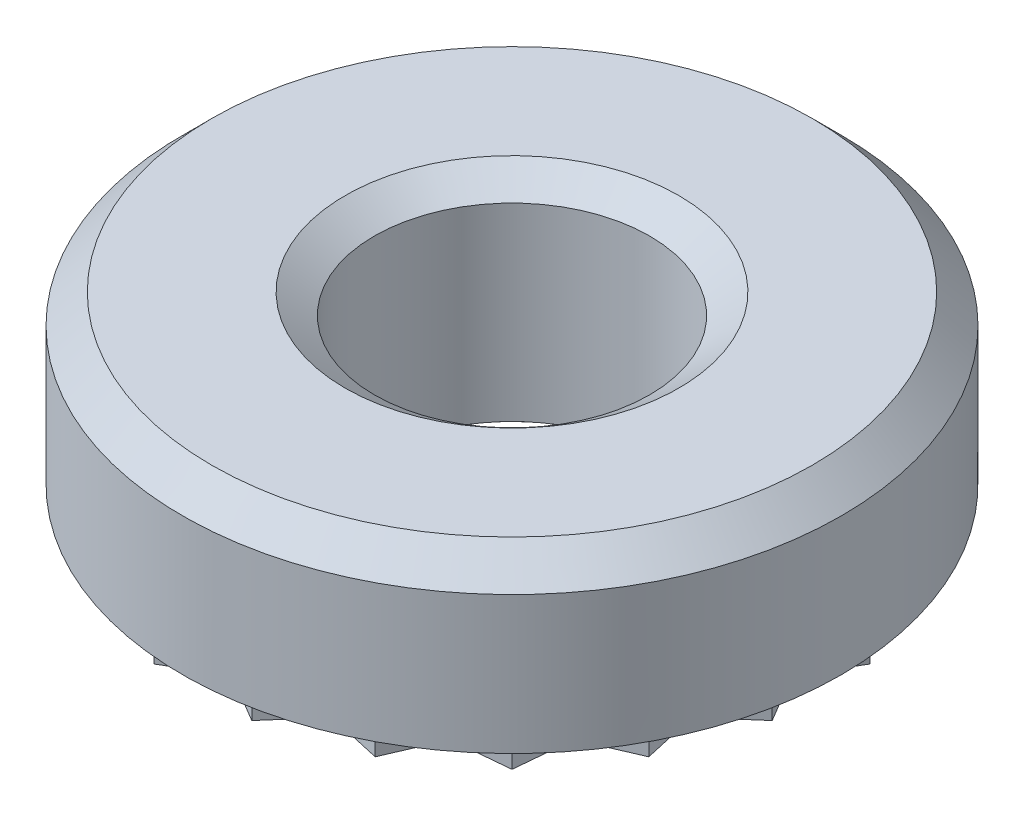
ISO-10303-21;
HEADER;
FILE_DESCRIPTION(('STEP AP214'),'2;1');
FILE_NAME('part.step','',(''),(''),'','','');
FILE_SCHEMA(('AUTOMOTIVE_DESIGN { 1 0 10303 214 1 1 1 1 }'));
ENDSEC;
DATA;
#1=APPLICATION_CONTEXT('core data for automotive mechanical design processes');
#2=APPLICATION_PROTOCOL_DEFINITION('international standard','automotive_design',2000,#1);
#3=PRODUCT_CONTEXT('',#1,'mechanical');
#4=PRODUCT('Part','Part','',(#3));
#5=PRODUCT_RELATED_PRODUCT_CATEGORY('part','',(#4));
#6=PRODUCT_DEFINITION_FORMATION('','',#4);
#7=PRODUCT_DEFINITION_CONTEXT('part definition',#1,'design');
#8=PRODUCT_DEFINITION('design','',#6,#7);
#9=PRODUCT_DEFINITION_SHAPE('','',#8);
#10=(LENGTH_UNIT() NAMED_UNIT(*) SI_UNIT(.MILLI.,.METRE.));
#11=(NAMED_UNIT(*) PLANE_ANGLE_UNIT() SI_UNIT($,.RADIAN.));
#12=(NAMED_UNIT(*) SI_UNIT($,.STERADIAN.) SOLID_ANGLE_UNIT());
#13=UNCERTAINTY_MEASURE_WITH_UNIT(LENGTH_MEASURE(1.E-05),#10,'distance_accuracy_value','');
#14=(GEOMETRIC_REPRESENTATION_CONTEXT(3) GLOBAL_UNCERTAINTY_ASSIGNED_CONTEXT((#13)) GLOBAL_UNIT_ASSIGNED_CONTEXT((#10,
#11,#12)) REPRESENTATION_CONTEXT('',''));
#15=CARTESIAN_POINT('',(0.,0.,0.));
#16=DIRECTION('',(0.,0.,1.));
#17=DIRECTION('',(1.,0.,0.));
#18=AXIS2_PLACEMENT_3D('',#15,#16,#17);
#19=CARTESIAN_POINT('',(-3.60074506,0.,3.60074506));
#20=DIRECTION('',(0.,-1.,0.));
#21=DIRECTION('',(0.,0.,-1.));
#22=AXIS2_PLACEMENT_3D('',#19,#20,#21);
#23=PLANE('',#22);
#24=CARTESIAN_POINT('',(0.,0.,0.));
#25=DIRECTION('',(0.,-1.,0.));
#26=DIRECTION('',(0.,0.,-1.));
#27=AXIS2_PLACEMENT_3D('',#24,#25,#26);
#28=CIRCLE('',#27,2.514485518);
#29=CARTESIAN_POINT('',(0.,0.,-2.514485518));
#30=VERTEX_POINT('',#29);
#31=EDGE_CURVE('E20',#30,#30,#28,.F.);
#32=ORIENTED_EDGE('',*,*,#31,.T.);
#33=EDGE_LOOP('',(#32));
#34=FACE_BOUND('',#33,.T.);
#35=DIRECTION('',(-0.995754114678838,0.,0.0920529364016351));
#36=VECTOR('',#35,1.);
#37=CARTESIAN_POINT('',(2.220915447,0.,2.5774525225));
#38=LINE('',#37,#36);
#39=CARTESIAN_POINT('',(2.54728146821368,0.,2.54728146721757));
#40=VERTEX_POINT('',#39);
#41=CARTESIAN_POINT('',(1.89454942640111,0.,2.60762357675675));
#42=VERTEX_POINT('',#41);
#43=EDGE_CURVE('E449',#40,#42,#38,.T.);
#44=ORIENTED_EDGE('',*,*,#43,.T.);
#45=DIRECTION('',(-0.395252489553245,0.,0.918572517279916));
#46=VECTOR('',#45,1.);
#47=CARTESIAN_POINT('',(1.7650024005,0.,2.9086927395));
#48=LINE('',#47,#46);
#49=CARTESIAN_POINT('',(1.63545537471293,0.,3.20976190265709));
#50=VERTEX_POINT('',#49);
#51=EDGE_CURVE('E445',#42,#50,#48,.T.);
#52=ORIENTED_EDGE('',*,*,#51,.T.);
#53=DIRECTION('',(-0.975464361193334,0.,-0.220157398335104));
#54=VECTOR('',#53,1.);
#55=CARTESIAN_POINT('',(1.315739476,0.,3.137603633));
#56=LINE('',#55,#54);
#57=CARTESIAN_POINT('',(0.996023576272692,0.,3.06544536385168));
#58=VERTEX_POINT('',#57);
#59=EDGE_CURVE('E421',#50,#58,#56,.T.);
#60=ORIENTED_EDGE('',*,*,#59,.T.);
#61=DIRECTION('',(-0.659761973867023,0.,0.751474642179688));
#62=VECTOR('',#61,1.);
#63=CARTESIAN_POINT('',(0.7797815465,0.,3.3117469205));
#64=LINE('',#63,#62);
#65=CARTESIAN_POINT('',(0.563539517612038,0.,3.55804847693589));
#66=VERTEX_POINT('',#65);
#67=EDGE_CURVE('E406',#58,#66,#64,.T.);
#68=ORIENTED_EDGE('',*,*,#67,.T.);
#69=DIRECTION('',(-0.8596893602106,0.,-0.510817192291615));
#70=VECTOR('',#69,1.);
#71=CARTESIAN_POINT('',(0.2817697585,0.,3.390624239));
#72=LINE('',#71,#70);
#73=CARTESIAN_POINT('',(8.81123624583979E-10,0.,3.22320000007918));
#74=VERTEX_POINT('',#73);
#75=EDGE_CURVE('E288',#66,#74,#72,.T.);
#76=ORIENTED_EDGE('',*,*,#75,.T.);
#77=DIRECTION('',(-0.8596893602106,0.,0.510817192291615));
#78=VECTOR('',#77,1.);
#79=CARTESIAN_POINT('',(-0.2817697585,0.,3.390624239));
#80=LINE('',#79,#78);
#81=CARTESIAN_POINT('',(-0.563539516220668,0.,3.55804847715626));
#82=VERTEX_POINT('',#81);
#83=EDGE_CURVE('E432',#74,#82,#80,.T.);
#84=ORIENTED_EDGE('',*,*,#83,.T.);
#85=DIRECTION('',(-0.659761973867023,0.,-0.751474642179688));
#86=VECTOR('',#85,1.);
#87=CARTESIAN_POINT('',(-0.7797815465,0.,3.3117469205));
#88=LINE('',#87,#86);
#89=CARTESIAN_POINT('',(-0.996023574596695,0.,3.06544536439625));
#90=VERTEX_POINT('',#89);
#91=EDGE_CURVE('E436',#82,#90,#88,.T.);
#92=ORIENTED_EDGE('',*,*,#91,.T.);
#93=DIRECTION('',(-0.975464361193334,0.,0.220157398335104));
#94=VECTOR('',#93,1.);
#95=CARTESIAN_POINT('',(-1.315739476,0.,3.137603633));
#96=LINE('',#95,#94);
#97=CARTESIAN_POINT('',(-1.63545537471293,0.,3.20976190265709));
#98=VERTEX_POINT('',#97);
#99=EDGE_CURVE('E437',#90,#98,#96,.T.);
#100=ORIENTED_EDGE('',*,*,#99,.T.);
#101=DIRECTION('',(-0.395252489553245,0.,-0.918572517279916));
#102=VECTOR('',#101,1.);
#103=CARTESIAN_POINT('',(-1.7650024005,0.,2.9086927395));
#104=LINE('',#103,#102);
#105=CARTESIAN_POINT('',(-1.89454942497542,0.,2.60762357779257));
#106=VERTEX_POINT('',#105);
#107=EDGE_CURVE('E577',#98,#106,#104,.T.);
#108=ORIENTED_EDGE('',*,*,#107,.T.);
#109=DIRECTION('',(-0.995754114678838,0.,-0.0920529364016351));
#110=VECTOR('',#109,1.);
#111=CARTESIAN_POINT('',(-2.220915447,0.,2.5774525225));
#112=LINE('',#111,#110);
#113=CARTESIAN_POINT('',(-2.54728146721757,0.,2.54728146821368));
#114=VERTEX_POINT('',#113);
#115=EDGE_CURVE('E573',#106,#114,#112,.T.);
#116=ORIENTED_EDGE('',*,*,#115,.T.);
#117=DIRECTION('',(-0.0920529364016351,0.,-0.995754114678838));
#118=VECTOR('',#117,1.);
#119=CARTESIAN_POINT('',(-2.5774525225,0.,2.220915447));
#120=LINE('',#119,#118);
#121=CARTESIAN_POINT('',(-2.60762357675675,0.,1.89454942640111));
#122=VERTEX_POINT('',#121);
#123=EDGE_CURVE('E569',#114,#122,#120,.T.);
#124=ORIENTED_EDGE('',*,*,#123,.T.);
#125=DIRECTION('',(-0.918572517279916,0.,-0.395252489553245));
#126=VECTOR('',#125,1.);
#127=CARTESIAN_POINT('',(-2.9086927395,0.,1.7650024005));
#128=LINE('',#127,#126);
#129=CARTESIAN_POINT('',(-3.20976190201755,0.,1.6354553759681));
#130=VERTEX_POINT('',#129);
#131=EDGE_CURVE('E565',#122,#130,#128,.T.);
#132=ORIENTED_EDGE('',*,*,#131,.T.);
#133=DIRECTION('',(0.220157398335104,0.,-0.975464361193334));
#134=VECTOR('',#133,1.);
#135=CARTESIAN_POINT('',(-3.137603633,0.,1.315739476));
#136=LINE('',#135,#134);
#137=CARTESIAN_POINT('',(-3.06544536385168,0.,0.996023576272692));
#138=VERTEX_POINT('',#137);
#139=EDGE_CURVE('E561',#130,#138,#136,.T.);
#140=ORIENTED_EDGE('',*,*,#139,.T.);
#141=DIRECTION('',(-0.751474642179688,0.,-0.659761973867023));
#142=VECTOR('',#141,1.);
#143=CARTESIAN_POINT('',(-3.3117469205,0.,0.7797815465));
#144=LINE('',#143,#142);
#145=CARTESIAN_POINT('',(-3.55804847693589,0.,0.563539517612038));
#146=VERTEX_POINT('',#145);
#147=EDGE_CURVE('E557',#138,#146,#144,.T.);
#148=ORIENTED_EDGE('',*,*,#147,.T.);
#149=DIRECTION('',(0.510817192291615,0.,-0.8596893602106));
#150=VECTOR('',#149,1.);
#151=CARTESIAN_POINT('',(-3.390624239,0.,0.2817697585));
#152=LINE('',#151,#150);
#153=CARTESIAN_POINT('',(-3.22320000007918,0.,8.81123678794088E-10));
#154=VERTEX_POINT('',#153);
#155=EDGE_CURVE('E553',#146,#154,#152,.T.);
#156=ORIENTED_EDGE('',*,*,#155,.T.);
#157=DIRECTION('',(-0.510817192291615,0.,-0.8596893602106));
#158=VECTOR('',#157,1.);
#159=CARTESIAN_POINT('',(-3.390624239,0.,-0.2817697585));
#160=LINE('',#159,#158);
#161=CARTESIAN_POINT('',(-3.55804847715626,0.,-0.563539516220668));
#162=VERTEX_POINT('',#161);
#163=EDGE_CURVE('E549',#154,#162,#160,.T.);
#164=ORIENTED_EDGE('',*,*,#163,.T.);
#165=DIRECTION('',(0.751474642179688,0.,-0.659761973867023));
#166=VECTOR('',#165,1.);
#167=CARTESIAN_POINT('',(-3.3117469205,0.,-0.7797815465));
#168=LINE('',#167,#166);
#169=CARTESIAN_POINT('',(-3.06544536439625,0.,-0.996023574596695));
#170=VERTEX_POINT('',#169);
#171=EDGE_CURVE('E545',#162,#170,#168,.T.);
#172=ORIENTED_EDGE('',*,*,#171,.T.);
#173=DIRECTION('',(-0.220157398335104,0.,-0.975464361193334));
#174=VECTOR('',#173,1.);
#175=CARTESIAN_POINT('',(-3.137603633,0.,-1.315739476));
#176=LINE('',#175,#174);
#177=CARTESIAN_POINT('',(-3.20976190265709,0.,-1.63545537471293));
#178=VERTEX_POINT('',#177);
#179=EDGE_CURVE('E541',#170,#178,#176,.T.);
#180=ORIENTED_EDGE('',*,*,#179,.T.);
#181=DIRECTION('',(0.918572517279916,0.,-0.395252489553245));
#182=VECTOR('',#181,1.);
#183=CARTESIAN_POINT('',(-2.9086927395,0.,-1.7650024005));
#184=LINE('',#183,#182);
#185=CARTESIAN_POINT('',(-2.60762357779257,0.,-1.89454942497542));
#186=VERTEX_POINT('',#185);
#187=EDGE_CURVE('E537',#178,#186,#184,.T.);
#188=ORIENTED_EDGE('',*,*,#187,.T.);
#189=DIRECTION('',(0.0920529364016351,0.,-0.995754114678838));
#190=VECTOR('',#189,1.);
#191=CARTESIAN_POINT('',(-2.5774525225,0.,-2.220915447));
#192=LINE('',#191,#190);
#193=CARTESIAN_POINT('',(-2.54728146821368,0.,-2.54728146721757));
#194=VERTEX_POINT('',#193);
#195=EDGE_CURVE('E533',#186,#194,#192,.T.);
#196=ORIENTED_EDGE('',*,*,#195,.T.);
#197=DIRECTION('',(0.995754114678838,0.,-0.0920529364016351));
#198=VECTOR('',#197,1.);
#199=CARTESIAN_POINT('',(-2.220915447,0.,-2.5774525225));
#200=LINE('',#199,#198);
#201=CARTESIAN_POINT('',(-1.89454942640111,0.,-2.60762357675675));
#202=VERTEX_POINT('',#201);
#203=EDGE_CURVE('E529',#194,#202,#200,.T.);
#204=ORIENTED_EDGE('',*,*,#203,.T.);
#205=DIRECTION('',(0.395252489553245,0.,-0.918572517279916));
#206=VECTOR('',#205,1.);
#207=CARTESIAN_POINT('',(-1.7650024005,0.,-2.9086927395));
#208=LINE('',#207,#206);
#209=CARTESIAN_POINT('',(-1.6354553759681,0.,-3.20976190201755));
#210=VERTEX_POINT('',#209);
#211=EDGE_CURVE('E525',#202,#210,#208,.T.);
#212=ORIENTED_EDGE('',*,*,#211,.T.);
#213=DIRECTION('',(0.975464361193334,0.,0.220157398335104));
#214=VECTOR('',#213,1.);
#215=CARTESIAN_POINT('',(-1.315739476,0.,-3.137603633));
#216=LINE('',#215,#214);
#217=CARTESIAN_POINT('',(-0.996023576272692,0.,-3.06544536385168));
#218=VERTEX_POINT('',#217);
#219=EDGE_CURVE('E521',#210,#218,#216,.T.);
#220=ORIENTED_EDGE('',*,*,#219,.T.);
#221=DIRECTION('',(0.659761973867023,0.,-0.751474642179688));
#222=VECTOR('',#221,1.);
#223=CARTESIAN_POINT('',(-0.7797815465,0.,-3.3117469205));
#224=LINE('',#223,#222);
#225=CARTESIAN_POINT('',(-0.563539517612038,0.,-3.55804847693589));
#226=VERTEX_POINT('',#225);
#227=EDGE_CURVE('E517',#218,#226,#224,.T.);
#228=ORIENTED_EDGE('',*,*,#227,.T.);
#229=DIRECTION('',(0.8596893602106,0.,0.510817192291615));
#230=VECTOR('',#229,1.);
#231=CARTESIAN_POINT('',(-0.2817697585,0.,-3.390624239));
#232=LINE('',#231,#230);
#233=CARTESIAN_POINT('',(-8.81123678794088E-10,0.,-3.22320000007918));
#234=VERTEX_POINT('',#233);
#235=EDGE_CURVE('E513',#226,#234,#232,.T.);
#236=ORIENTED_EDGE('',*,*,#235,.T.);
#237=DIRECTION('',(0.8596893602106,0.,-0.510817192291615));
#238=VECTOR('',#237,1.);
#239=CARTESIAN_POINT('',(0.2817697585,0.,-3.390624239));
#240=LINE('',#239,#238);
#241=CARTESIAN_POINT('',(0.563539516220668,0.,-3.55804847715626));
#242=VERTEX_POINT('',#241);
#243=EDGE_CURVE('E509',#234,#242,#240,.T.);
#244=ORIENTED_EDGE('',*,*,#243,.T.);
#245=DIRECTION('',(0.659761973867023,0.,0.751474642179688));
#246=VECTOR('',#245,1.);
#247=CARTESIAN_POINT('',(0.7797815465,0.,-3.3117469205));
#248=LINE('',#247,#246);
#249=CARTESIAN_POINT('',(0.996023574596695,0.,-3.06544536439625));
#250=VERTEX_POINT('',#249);
#251=EDGE_CURVE('E505',#242,#250,#248,.T.);
#252=ORIENTED_EDGE('',*,*,#251,.T.);
#253=DIRECTION('',(0.975464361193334,0.,-0.220157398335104));
#254=VECTOR('',#253,1.);
#255=CARTESIAN_POINT('',(1.315739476,0.,-3.137603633));
#256=LINE('',#255,#254);
#257=CARTESIAN_POINT('',(1.63545537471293,0.,-3.20976190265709));
#258=VERTEX_POINT('',#257);
#259=EDGE_CURVE('E501',#250,#258,#256,.T.);
#260=ORIENTED_EDGE('',*,*,#259,.T.);
#261=DIRECTION('',(0.395252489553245,0.,0.918572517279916));
#262=VECTOR('',#261,1.);
#263=CARTESIAN_POINT('',(1.7650024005,0.,-2.9086927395));
#264=LINE('',#263,#262);
#265=CARTESIAN_POINT('',(1.89454942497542,0.,-2.60762357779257));
#266=VERTEX_POINT('',#265);
#267=EDGE_CURVE('E497',#258,#266,#264,.T.);
#268=ORIENTED_EDGE('',*,*,#267,.T.);
#269=DIRECTION('',(0.995754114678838,0.,0.0920529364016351));
#270=VECTOR('',#269,1.);
#271=CARTESIAN_POINT('',(2.220915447,0.,-2.5774525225));
#272=LINE('',#271,#270);
#273=CARTESIAN_POINT('',(2.54728146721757,0.,-2.54728146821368));
#274=VERTEX_POINT('',#273);
#275=EDGE_CURVE('E493',#266,#274,#272,.T.);
#276=ORIENTED_EDGE('',*,*,#275,.T.);
#277=DIRECTION('',(0.0920529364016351,0.,0.995754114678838));
#278=VECTOR('',#277,1.);
#279=CARTESIAN_POINT('',(2.5774525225,0.,-2.220915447));
#280=LINE('',#279,#278);
#281=CARTESIAN_POINT('',(2.60762357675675,0.,-1.89454942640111));
#282=VERTEX_POINT('',#281);
#283=EDGE_CURVE('E489',#274,#282,#280,.T.);
#284=ORIENTED_EDGE('',*,*,#283,.T.);
#285=DIRECTION('',(0.918572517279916,0.,0.395252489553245));
#286=VECTOR('',#285,1.);
#287=CARTESIAN_POINT('',(2.9086927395,0.,-1.7650024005));
#288=LINE('',#287,#286);
#289=CARTESIAN_POINT('',(3.20976190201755,0.,-1.6354553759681));
#290=VERTEX_POINT('',#289);
#291=EDGE_CURVE('E485',#282,#290,#288,.T.);
#292=ORIENTED_EDGE('',*,*,#291,.T.);
#293=DIRECTION('',(-0.220157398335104,0.,0.975464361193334));
#294=VECTOR('',#293,1.);
#295=CARTESIAN_POINT('',(3.137603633,0.,-1.315739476));
#296=LINE('',#295,#294);
#297=CARTESIAN_POINT('',(3.06544536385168,0.,-0.996023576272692));
#298=VERTEX_POINT('',#297);
#299=EDGE_CURVE('E481',#290,#298,#296,.T.);
#300=ORIENTED_EDGE('',*,*,#299,.T.);
#301=DIRECTION('',(0.751474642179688,0.,0.659761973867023));
#302=VECTOR('',#301,1.);
#303=CARTESIAN_POINT('',(3.3117469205,0.,-0.7797815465));
#304=LINE('',#303,#302);
#305=CARTESIAN_POINT('',(3.55804847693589,0.,-0.563539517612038));
#306=VERTEX_POINT('',#305);
#307=EDGE_CURVE('E477',#298,#306,#304,.T.);
#308=ORIENTED_EDGE('',*,*,#307,.T.);
#309=DIRECTION('',(-0.510817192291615,0.,0.8596893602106));
#310=VECTOR('',#309,1.);
#311=CARTESIAN_POINT('',(3.390624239,0.,-0.2817697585));
#312=LINE('',#311,#310);
#313=CARTESIAN_POINT('',(3.22320000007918,0.,-8.81123624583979E-10));
#314=VERTEX_POINT('',#313);
#315=EDGE_CURVE('E473',#306,#314,#312,.T.);
#316=ORIENTED_EDGE('',*,*,#315,.T.);
#317=DIRECTION('',(0.510817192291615,0.,0.8596893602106));
#318=VECTOR('',#317,1.);
#319=CARTESIAN_POINT('',(3.390624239,0.,0.2817697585));
#320=LINE('',#319,#318);
#321=CARTESIAN_POINT('',(3.55804847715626,0.,0.563539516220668));
#322=VERTEX_POINT('',#321);
#323=EDGE_CURVE('E469',#314,#322,#320,.T.);
#324=ORIENTED_EDGE('',*,*,#323,.T.);
#325=DIRECTION('',(-0.751474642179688,0.,0.659761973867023));
#326=VECTOR('',#325,1.);
#327=CARTESIAN_POINT('',(3.3117469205,0.,0.7797815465));
#328=LINE('',#327,#326);
#329=CARTESIAN_POINT('',(3.06544536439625,0.,0.996023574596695));
#330=VERTEX_POINT('',#329);
#331=EDGE_CURVE('E465',#322,#330,#328,.T.);
#332=ORIENTED_EDGE('',*,*,#331,.T.);
#333=DIRECTION('',(0.220157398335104,0.,0.975464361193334));
#334=VECTOR('',#333,1.);
#335=CARTESIAN_POINT('',(3.137603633,0.,1.315739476));
#336=LINE('',#335,#334);
#337=CARTESIAN_POINT('',(3.20976190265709,0.,1.63545537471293));
#338=VERTEX_POINT('',#337);
#339=EDGE_CURVE('E461',#330,#338,#336,.T.);
#340=ORIENTED_EDGE('',*,*,#339,.T.);
#341=DIRECTION('',(-0.918572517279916,0.,0.395252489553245));
#342=VECTOR('',#341,1.);
#343=CARTESIAN_POINT('',(2.9086927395,0.,1.7650024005));
#344=LINE('',#343,#342);
#345=CARTESIAN_POINT('',(2.60762357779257,0.,1.89454942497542));
#346=VERTEX_POINT('',#345);
#347=EDGE_CURVE('E457',#338,#346,#344,.T.);
#348=ORIENTED_EDGE('',*,*,#347,.T.);
#349=DIRECTION('',(-0.0920529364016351,0.,0.995754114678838));
#350=VECTOR('',#349,1.);
#351=CARTESIAN_POINT('',(2.5774525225,0.,2.220915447));
#352=LINE('',#351,#350);
#353=EDGE_CURVE('E453',#346,#40,#352,.T.);
#354=ORIENTED_EDGE('',*,*,#353,.T.);
#355=EDGE_LOOP('',(#44,#52,#60,#68,#76,#84,#92,#100,#108,#116,#124,#132,#140,#148,#156,#164,
#172,#180,#188,#196,#204,#212,#220,#228,#236,#244,#252,#260,#268,#276,#284,#292,#300,#308,#316,
#324,#332,#340,#348,#354));
#356=FACE_BOUND('',#355,.T.);
#357=ADVANCED_FACE('F16',(#34,#356),#23,.T.);
#358=CARTESIAN_POINT('',(0.,0.,0.));
#359=DIRECTION('',(0.,-1.,0.));
#360=DIRECTION('',(0.,0.,-1.));
#361=AXIS2_PLACEMENT_3D('',#358,#359,#360);
#362=CYLINDRICAL_SURFACE('',#361,2.514485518);
#363=ORIENTED_EDGE('',*,*,#31,.F.);
#364=EDGE_LOOP('',(#363));
#365=FACE_BOUND('',#364,.T.);
#366=CARTESIAN_POINT('',(0.,-0.303999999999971,0.));
#367=DIRECTION('',(0.,-1.,0.));
#368=DIRECTION('',(0.,0.,-1.));
#369=AXIS2_PLACEMENT_3D('',#366,#367,#368);
#370=CIRCLE('',#369,2.514485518);
#371=CARTESIAN_POINT('',(0.,-0.304,-2.514485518));
#372=VERTEX_POINT('',#371);
#373=EDGE_CURVE('E428',#372,#372,#370,.F.);
#374=ORIENTED_EDGE('',*,*,#373,.T.);
#375=EDGE_LOOP('',(#374));
#376=FACE_BOUND('',#375,.T.);
#377=ADVANCED_FACE('F1051',(#365,#376),#362,.T.);
#378=CARTESIAN_POINT('',(0.,-0.304,3.2232));
#379=DIRECTION('',(-0.510817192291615,0.,0.8596893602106));
#380=DIRECTION('',(0.8596893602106,0.,0.510817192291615));
#381=AXIS2_PLACEMENT_3D('',#378,#379,#380);
#382=PLANE('',#381);
#383=DIRECTION('',(0.,-1.,0.));
#384=VECTOR('',#383,1.);
#385=CARTESIAN_POINT('',(0.563539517,-0.152,3.558048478));
#386=LINE('',#385,#384);
#387=CARTESIAN_POINT('',(0.5635395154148,-0.304,3.55804847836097));
#388=VERTEX_POINT('',#387);
#389=EDGE_CURVE('E412',#66,#388,#386,.T.);
#390=ORIENTED_EDGE('',*,*,#389,.T.);
#391=DIRECTION('',(0.859689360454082,0.,0.510817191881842));
#392=VECTOR('',#391,1.);
#393=CARTESIAN_POINT('',(0.,-0.304,3.22320000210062));
#394=LINE('',#393,#392);
#395=CARTESIAN_POINT('',(2.30618638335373E-10,-0.304,3.22320000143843));
#396=VERTEX_POINT('',#395);
#397=EDGE_CURVE('E431',#396,#388,#394,.T.);
#398=ORIENTED_EDGE('',*,*,#397,.F.);
#399=DIRECTION('',(0.,1.,0.));
#400=VECTOR('',#399,1.);
#401=CARTESIAN_POINT('',(0.,-0.152,3.2232));
#402=LINE('',#401,#400);
#403=EDGE_CURVE('E278',#396,#74,#402,.T.);
#404=ORIENTED_EDGE('',*,*,#403,.T.);
#405=ORIENTED_EDGE('',*,*,#75,.F.);
#406=EDGE_LOOP('',(#390,#398,#404,#405));
#407=FACE_BOUND('',#406,.T.);
#408=ADVANCED_FACE('F410',(#407),#382,.F.);
#409=CARTESIAN_POINT('',(0.563539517,-0.304,3.558048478));
#410=DIRECTION('',(0.751474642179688,0.,0.659761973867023));
#411=DIRECTION('',(0.659761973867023,0.,-0.751474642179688));
#412=AXIS2_PLACEMENT_3D('',#409,#410,#411);
#413=PLANE('',#412);
#414=DIRECTION('',(0.,-1.,0.));
#415=VECTOR('',#414,1.);
#416=CARTESIAN_POINT('',(0.996023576,-0.152,3.065445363));
#417=LINE('',#416,#415);
#418=CARTESIAN_POINT('',(0.996023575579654,-0.304,3.0654453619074));
#419=VERTEX_POINT('',#418);
#420=EDGE_CURVE('E422',#58,#419,#417,.T.);
#421=ORIENTED_EDGE('',*,*,#420,.T.);
#422=DIRECTION('',(0.659761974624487,0.,-0.751474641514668));
#423=VECTOR('',#422,1.);
#424=CARTESIAN_POINT('',(0.563539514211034,-0.304,3.55804847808));
#425=LINE('',#424,#423);
#426=EDGE_CURVE('E416',#388,#419,#425,.T.);
#427=ORIENTED_EDGE('',*,*,#426,.F.);
#428=ORIENTED_EDGE('',*,*,#389,.F.);
#429=ORIENTED_EDGE('',*,*,#67,.F.);
#430=EDGE_LOOP('',(#421,#427,#428,#429));
#431=FACE_BOUND('',#430,.T.);
#432=ADVANCED_FACE('F415',(#431),#413,.F.);
#433=CARTESIAN_POINT('',(0.996023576,-0.304,3.065445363));
#434=DIRECTION('',(-0.220157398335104,0.,0.975464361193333));
#435=DIRECTION('',(0.975464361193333,0.,0.220157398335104));
#436=AXIS2_PLACEMENT_3D('',#433,#434,#435);
#437=PLANE('',#436);
#438=DIRECTION('',(0.,-1.,0.));
#439=VECTOR('',#438,1.);
#440=CARTESIAN_POINT('',(1.635455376,-0.152,3.209761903));
#441=LINE('',#440,#439);
#442=CARTESIAN_POINT('',(1.63545537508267,-0.304,3.20976190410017));
#443=VERTEX_POINT('',#442);
#444=EDGE_CURVE('E442',#50,#443,#441,.T.);
#445=ORIENTED_EDGE('',*,*,#444,.T.);
#446=DIRECTION('',(0.975464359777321,0.,0.220157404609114));
#447=VECTOR('',#446,1.);
#448=CARTESIAN_POINT('',(0.996023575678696,-0.304,3.06544536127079));
#449=LINE('',#448,#447);
#450=EDGE_CURVE('E907',#419,#443,#449,.T.);
#451=ORIENTED_EDGE('',*,*,#450,.F.);
#452=ORIENTED_EDGE('',*,*,#420,.F.);
#453=ORIENTED_EDGE('',*,*,#59,.F.);
#454=EDGE_LOOP('',(#445,#451,#452,#453));
#455=FACE_BOUND('',#454,.T.);
#456=ADVANCED_FACE('F1000',(#455),#437,.F.);
#457=CARTESIAN_POINT('',(1.635455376,-0.304,3.209761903));
#458=DIRECTION('',(0.918572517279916,0.,0.395252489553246));
#459=DIRECTION('',(0.395252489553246,0.,-0.918572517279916));
#460=AXIS2_PLACEMENT_3D('',#457,#458,#459);
#461=PLANE('',#460);
#462=DIRECTION('',(0.,-1.,0.));
#463=VECTOR('',#462,1.);
#464=CARTESIAN_POINT('',(1.894549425,-0.152,2.607623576));
#465=LINE('',#464,#463);
#466=CARTESIAN_POINT('',(1.8945494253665,-0.304,2.60762357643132));
#467=VERTEX_POINT('',#466);
#468=EDGE_CURVE('E446',#42,#467,#465,.T.);
#469=ORIENTED_EDGE('',*,*,#468,.T.);
#470=DIRECTION('',(0.395252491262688,0.,-0.91857251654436));
#471=VECTOR('',#470,1.);
#472=CARTESIAN_POINT('',(1.63545537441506,-0.304,3.2097619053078));
#473=LINE('',#472,#471);
#474=EDGE_CURVE('E905',#443,#467,#473,.T.);
#475=ORIENTED_EDGE('',*,*,#474,.F.);
#476=ORIENTED_EDGE('',*,*,#444,.F.);
#477=ORIENTED_EDGE('',*,*,#51,.F.);
#478=EDGE_LOOP('',(#469,#475,#476,#477));
#479=FACE_BOUND('',#478,.T.);
#480=ADVANCED_FACE('F991',(#479),#461,.F.);
#481=CARTESIAN_POINT('',(1.894549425,-0.304,2.607623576));
#482=DIRECTION('',(0.0920529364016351,0.,0.995754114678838));
#483=DIRECTION('',(0.995754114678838,0.,-0.0920529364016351));
#484=AXIS2_PLACEMENT_3D('',#481,#482,#483);
#485=PLANE('',#484);
#486=DIRECTION('',(0.,-1.,0.));
#487=VECTOR('',#486,1.);
#488=CARTESIAN_POINT('',(2.547281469,-0.152,2.547281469));
#489=LINE('',#488,#487);
#490=CARTESIAN_POINT('',(2.54728146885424,-0.304,2.54728146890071));
#491=VERTEX_POINT('',#490);
#492=EDGE_CURVE('E450',#40,#491,#489,.T.);
#493=ORIENTED_EDGE('',*,*,#492,.T.);
#494=DIRECTION('',(0.995754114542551,0.,-0.092052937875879));
#495=VECTOR('',#494,1.);
#496=CARTESIAN_POINT('',(1.89454942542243,-0.304,2.60762357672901));
#497=LINE('',#496,#495);
#498=EDGE_CURVE('E903',#467,#491,#497,.T.);
#499=ORIENTED_EDGE('',*,*,#498,.F.);
#500=ORIENTED_EDGE('',*,*,#468,.F.);
#501=ORIENTED_EDGE('',*,*,#43,.F.);
#502=EDGE_LOOP('',(#493,#499,#500,#501));
#503=FACE_BOUND('',#502,.T.);
#504=ADVANCED_FACE('F995',(#503),#485,.F.);
#505=CARTESIAN_POINT('',(2.547281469,-0.304,2.547281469));
#506=DIRECTION('',(0.995754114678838,0.,0.0920529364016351));
#507=DIRECTION('',(0.0920529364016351,0.,-0.995754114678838));
#508=AXIS2_PLACEMENT_3D('',#505,#506,#507);
#509=PLANE('',#508);
#510=DIRECTION('',(0.,-1.,0.));
#511=VECTOR('',#510,1.);
#512=CARTESIAN_POINT('',(2.607623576,-0.152,1.894549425));
#513=LINE('',#512,#511);
#514=CARTESIAN_POINT('',(2.60762357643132,-0.304,1.8945494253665));
#515=VERTEX_POINT('',#514);
#516=EDGE_CURVE('E454',#346,#515,#513,.T.);
#517=ORIENTED_EDGE('',*,*,#516,.T.);
#518=DIRECTION('',(0.0920529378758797,0.,-0.995754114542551));
#519=VECTOR('',#518,1.);
#520=CARTESIAN_POINT('',(2.54728146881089,-0.304,2.54728146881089));
#521=LINE('',#520,#519);
#522=EDGE_CURVE('E901',#491,#515,#521,.T.);
#523=ORIENTED_EDGE('',*,*,#522,.F.);
#524=ORIENTED_EDGE('',*,*,#492,.F.);
#525=ORIENTED_EDGE('',*,*,#353,.F.);
#526=EDGE_LOOP('',(#517,#523,#524,#525));
#527=FACE_BOUND('',#526,.T.);
#528=ADVANCED_FACE('F1091',(#527),#509,.F.);
#529=CARTESIAN_POINT('',(2.607623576,-0.304,1.894549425));
#530=DIRECTION('',(0.395252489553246,0.,0.918572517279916));
#531=DIRECTION('',(0.918572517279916,0.,-0.395252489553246));
#532=AXIS2_PLACEMENT_3D('',#529,#530,#531);
#533=PLANE('',#532);
#534=DIRECTION('',(0.,-1.,0.));
#535=VECTOR('',#534,1.);
#536=CARTESIAN_POINT('',(3.209761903,-0.152,1.635455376));
#537=LINE('',#536,#535);
#538=CARTESIAN_POINT('',(3.20976190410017,-0.304,1.63545537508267));
#539=VERTEX_POINT('',#538);
#540=EDGE_CURVE('E458',#338,#539,#537,.T.);
#541=ORIENTED_EDGE('',*,*,#540,.T.);
#542=DIRECTION('',(0.91857251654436,0.,-0.395252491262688));
#543=VECTOR('',#542,1.);
#544=CARTESIAN_POINT('',(2.60762357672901,-0.304,1.89454942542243));
#545=LINE('',#544,#543);
#546=EDGE_CURVE('E899',#515,#539,#545,.T.);
#547=ORIENTED_EDGE('',*,*,#546,.F.);
#548=ORIENTED_EDGE('',*,*,#516,.F.);
#549=ORIENTED_EDGE('',*,*,#347,.F.);
#550=EDGE_LOOP('',(#541,#547,#548,#549));
#551=FACE_BOUND('',#550,.T.);
#552=ADVANCED_FACE('F1100',(#551),#533,.F.);
#553=CARTESIAN_POINT('',(3.209761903,-0.304,1.635455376));
#554=DIRECTION('',(0.975464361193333,0.,-0.220157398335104));
#555=DIRECTION('',(-0.220157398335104,0.,-0.975464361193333));
#556=AXIS2_PLACEMENT_3D('',#553,#554,#555);
#557=PLANE('',#556);
#558=DIRECTION('',(0.,-1.,0.));
#559=VECTOR('',#558,1.);
#560=CARTESIAN_POINT('',(3.065445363,-0.152,0.996023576));
#561=LINE('',#560,#559);
#562=CARTESIAN_POINT('',(3.0654453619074,-0.304,0.996023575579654));
#563=VERTEX_POINT('',#562);
#564=EDGE_CURVE('E462',#330,#563,#561,.T.);
#565=ORIENTED_EDGE('',*,*,#564,.T.);
#566=DIRECTION('',(-0.220157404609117,0.,-0.97546435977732));
#567=VECTOR('',#566,1.);
#568=CARTESIAN_POINT('',(3.2097619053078,-0.304,1.63545537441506));
#569=LINE('',#568,#567);
#570=EDGE_CURVE('E897',#539,#563,#569,.T.);
#571=ORIENTED_EDGE('',*,*,#570,.F.);
#572=ORIENTED_EDGE('',*,*,#540,.F.);
#573=ORIENTED_EDGE('',*,*,#339,.F.);
#574=EDGE_LOOP('',(#565,#571,#572,#573));
#575=FACE_BOUND('',#574,.T.);
#576=ADVANCED_FACE('F1110',(#575),#557,.F.);
#577=CARTESIAN_POINT('',(3.065445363,-0.304,0.996023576));
#578=DIRECTION('',(0.659761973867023,0.,0.751474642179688));
#579=DIRECTION('',(0.751474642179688,0.,-0.659761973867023));
#580=AXIS2_PLACEMENT_3D('',#577,#578,#579);
#581=PLANE('',#580);
#582=DIRECTION('',(0.,-1.,0.));
#583=VECTOR('',#582,1.);
#584=CARTESIAN_POINT('',(3.558048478,-0.152,0.563539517));
#585=LINE('',#584,#583);
#586=CARTESIAN_POINT('',(3.55804847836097,-0.304,0.563539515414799));
#587=VERTEX_POINT('',#586);
#588=EDGE_CURVE('E466',#322,#587,#585,.T.);
#589=ORIENTED_EDGE('',*,*,#588,.T.);
#590=DIRECTION('',(0.751474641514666,0.,-0.659761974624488));
#591=VECTOR('',#590,1.);
#592=CARTESIAN_POINT('',(3.06544536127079,-0.304,0.996023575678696));
#593=LINE('',#592,#591);
#594=EDGE_CURVE('E895',#563,#587,#593,.T.);
#595=ORIENTED_EDGE('',*,*,#594,.F.);
#596=ORIENTED_EDGE('',*,*,#564,.F.);
#597=ORIENTED_EDGE('',*,*,#331,.F.);
#598=EDGE_LOOP('',(#589,#595,#596,#597));
#599=FACE_BOUND('',#598,.T.);
#600=ADVANCED_FACE('F1120',(#599),#581,.F.);
#601=CARTESIAN_POINT('',(3.558048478,-0.304,0.563539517));
#602=DIRECTION('',(0.8596893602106,0.,-0.510817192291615));
#603=DIRECTION('',(-0.510817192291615,0.,-0.8596893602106));
#604=AXIS2_PLACEMENT_3D('',#601,#602,#603);
#605=PLANE('',#604);
#606=DIRECTION('',(0.,-1.,0.));
#607=VECTOR('',#606,1.);
#608=CARTESIAN_POINT('',(3.2232,-0.152,0.));
#609=LINE('',#608,#607);
#610=CARTESIAN_POINT('',(3.22320000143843,-0.304,-2.30618618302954E-10));
#611=VERTEX_POINT('',#610);
#612=EDGE_CURVE('E470',#314,#611,#609,.T.);
#613=ORIENTED_EDGE('',*,*,#612,.T.);
#614=DIRECTION('',(-0.510817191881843,0.,-0.859689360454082));
#615=VECTOR('',#614,1.);
#616=CARTESIAN_POINT('',(3.55804847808,-0.304,0.563539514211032));
#617=LINE('',#616,#615);
#618=EDGE_CURVE('E893',#587,#611,#617,.T.);
#619=ORIENTED_EDGE('',*,*,#618,.F.);
#620=ORIENTED_EDGE('',*,*,#588,.F.);
#621=ORIENTED_EDGE('',*,*,#323,.F.);
#622=EDGE_LOOP('',(#613,#619,#620,#621));
#623=FACE_BOUND('',#622,.T.);
#624=ADVANCED_FACE('F1130',(#623),#605,.F.);
#625=CARTESIAN_POINT('',(3.2232,-0.304,0.));
#626=DIRECTION('',(0.8596893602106,0.,0.510817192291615));
#627=DIRECTION('',(0.510817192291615,0.,-0.8596893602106));
#628=AXIS2_PLACEMENT_3D('',#625,#626,#627);
#629=PLANE('',#628);
#630=DIRECTION('',(0.,-1.,0.));
#631=VECTOR('',#630,1.);
#632=CARTESIAN_POINT('',(3.558048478,-0.152,-0.563539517));
#633=LINE('',#632,#631);
#634=CARTESIAN_POINT('',(3.55804847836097,-0.304,-0.5635395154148));
#635=VERTEX_POINT('',#634);
#636=EDGE_CURVE('E474',#306,#635,#633,.T.);
#637=ORIENTED_EDGE('',*,*,#636,.T.);
#638=DIRECTION('',(0.510817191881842,0.,-0.859689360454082));
#639=VECTOR('',#638,1.);
#640=CARTESIAN_POINT('',(3.22320000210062,-0.304,0.));
#641=LINE('',#640,#639);
#642=EDGE_CURVE('E891',#611,#635,#641,.T.);
#643=ORIENTED_EDGE('',*,*,#642,.F.);
#644=ORIENTED_EDGE('',*,*,#612,.F.);
#645=ORIENTED_EDGE('',*,*,#315,.F.);
#646=EDGE_LOOP('',(#637,#643,#644,#645));
#647=FACE_BOUND('',#646,.T.);
#648=ADVANCED_FACE('F1140',(#647),#629,.F.);
#649=CARTESIAN_POINT('',(3.558048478,-0.304,-0.563539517));
#650=DIRECTION('',(0.659761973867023,0.,-0.751474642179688));
#651=DIRECTION('',(-0.751474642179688,0.,-0.659761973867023));
#652=AXIS2_PLACEMENT_3D('',#649,#650,#651);
#653=PLANE('',#652);
#654=DIRECTION('',(0.,-1.,0.));
#655=VECTOR('',#654,1.);
#656=CARTESIAN_POINT('',(3.065445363,-0.152,-0.996023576));
#657=LINE('',#656,#655);
#658=CARTESIAN_POINT('',(3.0654453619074,-0.304,-0.996023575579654));
#659=VERTEX_POINT('',#658);
#660=EDGE_CURVE('E478',#298,#659,#657,.T.);
#661=ORIENTED_EDGE('',*,*,#660,.T.);
#662=DIRECTION('',(-0.751474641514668,0.,-0.659761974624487));
#663=VECTOR('',#662,1.);
#664=CARTESIAN_POINT('',(3.55804847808,-0.304,-0.563539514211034));
#665=LINE('',#664,#663);
#666=EDGE_CURVE('E889',#635,#659,#665,.T.);
#667=ORIENTED_EDGE('',*,*,#666,.F.);
#668=ORIENTED_EDGE('',*,*,#636,.F.);
#669=ORIENTED_EDGE('',*,*,#307,.F.);
#670=EDGE_LOOP('',(#661,#667,#668,#669));
#671=FACE_BOUND('',#670,.T.);
#672=ADVANCED_FACE('F1150',(#671),#653,.F.);
#673=CARTESIAN_POINT('',(3.065445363,-0.304,-0.996023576));
#674=DIRECTION('',(0.975464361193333,0.,0.220157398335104));
#675=DIRECTION('',(0.220157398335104,0.,-0.975464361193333));
#676=AXIS2_PLACEMENT_3D('',#673,#674,#675);
#677=PLANE('',#676);
#678=DIRECTION('',(0.,-1.,0.));
#679=VECTOR('',#678,1.);
#680=CARTESIAN_POINT('',(3.209761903,-0.152,-1.635455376));
#681=LINE('',#680,#679);
#682=CARTESIAN_POINT('',(3.20976190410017,-0.304,-1.63545537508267));
#683=VERTEX_POINT('',#682);
#684=EDGE_CURVE('E482',#290,#683,#681,.T.);
#685=ORIENTED_EDGE('',*,*,#684,.T.);
#686=DIRECTION('',(0.220157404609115,0.,-0.975464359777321));
#687=VECTOR('',#686,1.);
#688=CARTESIAN_POINT('',(3.06544536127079,-0.304,-0.996023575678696));
#689=LINE('',#688,#687);
#690=EDGE_CURVE('E887',#659,#683,#689,.T.);
#691=ORIENTED_EDGE('',*,*,#690,.F.);
#692=ORIENTED_EDGE('',*,*,#660,.F.);
#693=ORIENTED_EDGE('',*,*,#299,.F.);
#694=EDGE_LOOP('',(#685,#691,#692,#693));
#695=FACE_BOUND('',#694,.T.);
#696=ADVANCED_FACE('F1160',(#695),#677,.F.);
#697=CARTESIAN_POINT('',(3.209761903,-0.304,-1.635455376));
#698=DIRECTION('',(0.395252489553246,0.,-0.918572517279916));
#699=DIRECTION('',(-0.918572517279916,0.,-0.395252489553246));
#700=AXIS2_PLACEMENT_3D('',#697,#698,#699);
#701=PLANE('',#700);
#702=DIRECTION('',(0.,-1.,0.));
#703=VECTOR('',#702,1.);
#704=CARTESIAN_POINT('',(2.607623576,-0.152,-1.894549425));
#705=LINE('',#704,#703);
#706=CARTESIAN_POINT('',(2.60762357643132,-0.304,-1.8945494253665));
#707=VERTEX_POINT('',#706);
#708=EDGE_CURVE('E486',#282,#707,#705,.T.);
#709=ORIENTED_EDGE('',*,*,#708,.T.);
#710=DIRECTION('',(-0.91857251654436,0.,-0.395252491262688));
#711=VECTOR('',#710,1.);
#712=CARTESIAN_POINT('',(3.2097619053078,-0.304,-1.63545537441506));
#713=LINE('',#712,#711);
#714=EDGE_CURVE('E885',#683,#707,#713,.T.);
#715=ORIENTED_EDGE('',*,*,#714,.F.);
#716=ORIENTED_EDGE('',*,*,#684,.F.);
#717=ORIENTED_EDGE('',*,*,#291,.F.);
#718=EDGE_LOOP('',(#709,#715,#716,#717));
#719=FACE_BOUND('',#718,.T.);
#720=ADVANCED_FACE('F1170',(#719),#701,.F.);
#721=CARTESIAN_POINT('',(2.607623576,-0.304,-1.894549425));
#722=DIRECTION('',(0.995754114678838,0.,-0.0920529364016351));
#723=DIRECTION('',(-0.0920529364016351,0.,-0.995754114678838));
#724=AXIS2_PLACEMENT_3D('',#721,#722,#723);
#725=PLANE('',#724);
#726=DIRECTION('',(0.,-1.,0.));
#727=VECTOR('',#726,1.);
#728=CARTESIAN_POINT('',(2.547281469,-0.152,-2.547281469));
#729=LINE('',#728,#727);
#730=CARTESIAN_POINT('',(2.54728146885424,-0.304,-2.54728146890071));
#731=VERTEX_POINT('',#730);
#732=EDGE_CURVE('E490',#274,#731,#729,.T.);
#733=ORIENTED_EDGE('',*,*,#732,.T.);
#734=DIRECTION('',(-0.0920529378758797,0.,-0.995754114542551));
#735=VECTOR('',#734,1.);
#736=CARTESIAN_POINT('',(2.60762357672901,-0.304,-1.89454942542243));
#737=LINE('',#736,#735);
#738=EDGE_CURVE('E883',#707,#731,#737,.T.);
#739=ORIENTED_EDGE('',*,*,#738,.F.);
#740=ORIENTED_EDGE('',*,*,#708,.F.);
#741=ORIENTED_EDGE('',*,*,#283,.F.);
#742=EDGE_LOOP('',(#733,#739,#740,#741));
#743=FACE_BOUND('',#742,.T.);
#744=ADVANCED_FACE('F1180',(#743),#725,.F.);
#745=CARTESIAN_POINT('',(2.547281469,-0.304,-2.547281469));
#746=DIRECTION('',(0.0920529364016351,0.,-0.995754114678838));
#747=DIRECTION('',(-0.995754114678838,0.,-0.0920529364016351));
#748=AXIS2_PLACEMENT_3D('',#745,#746,#747);
#749=PLANE('',#748);
#750=DIRECTION('',(0.,-1.,0.));
#751=VECTOR('',#750,1.);
#752=CARTESIAN_POINT('',(1.894549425,-0.152,-2.607623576));
#753=LINE('',#752,#751);
#754=CARTESIAN_POINT('',(1.8945494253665,-0.304,-2.60762357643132));
#755=VERTEX_POINT('',#754);
#756=EDGE_CURVE('E494',#266,#755,#753,.T.);
#757=ORIENTED_EDGE('',*,*,#756,.T.);
#758=DIRECTION('',(-0.995754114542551,0.,-0.0920529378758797));
#759=VECTOR('',#758,1.);
#760=CARTESIAN_POINT('',(2.54728146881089,-0.304,-2.54728146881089));
#761=LINE('',#760,#759);
#762=EDGE_CURVE('E881',#731,#755,#761,.T.);
#763=ORIENTED_EDGE('',*,*,#762,.F.);
#764=ORIENTED_EDGE('',*,*,#732,.F.);
#765=ORIENTED_EDGE('',*,*,#275,.F.);
#766=EDGE_LOOP('',(#757,#763,#764,#765));
#767=FACE_BOUND('',#766,.T.);
#768=ADVANCED_FACE('F1190',(#767),#749,.F.);
#769=CARTESIAN_POINT('',(1.894549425,-0.304,-2.607623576));
#770=DIRECTION('',(0.918572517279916,0.,-0.395252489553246));
#771=DIRECTION('',(-0.395252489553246,0.,-0.918572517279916));
#772=AXIS2_PLACEMENT_3D('',#769,#770,#771);
#773=PLANE('',#772);
#774=DIRECTION('',(0.,-1.,0.));
#775=VECTOR('',#774,1.);
#776=CARTESIAN_POINT('',(1.635455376,-0.152,-3.209761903));
#777=LINE('',#776,#775);
#778=CARTESIAN_POINT('',(1.63545537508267,-0.304,-3.20976190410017));
#779=VERTEX_POINT('',#778);
#780=EDGE_CURVE('E498',#258,#779,#777,.T.);
#781=ORIENTED_EDGE('',*,*,#780,.T.);
#782=DIRECTION('',(-0.395252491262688,0.,-0.91857251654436));
#783=VECTOR('',#782,1.);
#784=CARTESIAN_POINT('',(1.89454942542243,-0.304,-2.60762357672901));
#785=LINE('',#784,#783);
#786=EDGE_CURVE('E879',#755,#779,#785,.T.);
#787=ORIENTED_EDGE('',*,*,#786,.F.);
#788=ORIENTED_EDGE('',*,*,#756,.F.);
#789=ORIENTED_EDGE('',*,*,#267,.F.);
#790=EDGE_LOOP('',(#781,#787,#788,#789));
#791=FACE_BOUND('',#790,.T.);
#792=ADVANCED_FACE('F1200',(#791),#773,.F.);
#793=CARTESIAN_POINT('',(1.635455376,-0.304,-3.209761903));
#794=DIRECTION('',(-0.220157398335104,0.,-0.975464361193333));
#795=DIRECTION('',(-0.975464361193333,0.,0.220157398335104));
#796=AXIS2_PLACEMENT_3D('',#793,#794,#795);
#797=PLANE('',#796);
#798=DIRECTION('',(0.,-1.,0.));
#799=VECTOR('',#798,1.);
#800=CARTESIAN_POINT('',(0.996023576,-0.152,-3.065445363));
#801=LINE('',#800,#799);
#802=CARTESIAN_POINT('',(0.996023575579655,-0.304,-3.0654453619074));
#803=VERTEX_POINT('',#802);
#804=EDGE_CURVE('E502',#250,#803,#801,.T.);
#805=ORIENTED_EDGE('',*,*,#804,.T.);
#806=DIRECTION('',(-0.97546435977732,0.,0.220157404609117));
#807=VECTOR('',#806,1.);
#808=CARTESIAN_POINT('',(1.63545537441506,-0.304,-3.2097619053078));
#809=LINE('',#808,#807);
#810=EDGE_CURVE('E877',#779,#803,#809,.T.);
#811=ORIENTED_EDGE('',*,*,#810,.F.);
#812=ORIENTED_EDGE('',*,*,#780,.F.);
#813=ORIENTED_EDGE('',*,*,#259,.F.);
#814=EDGE_LOOP('',(#805,#811,#812,#813));
#815=FACE_BOUND('',#814,.T.);
#816=ADVANCED_FACE('F1210',(#815),#797,.F.);
#817=CARTESIAN_POINT('',(0.996023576,-0.304,-3.065445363));
#818=DIRECTION('',(0.751474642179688,0.,-0.659761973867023));
#819=DIRECTION('',(-0.659761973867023,0.,-0.751474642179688));
#820=AXIS2_PLACEMENT_3D('',#817,#818,#819);
#821=PLANE('',#820);
#822=DIRECTION('',(0.,-1.,0.));
#823=VECTOR('',#822,1.);
#824=CARTESIAN_POINT('',(0.563539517,-0.152,-3.558048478));
#825=LINE('',#824,#823);
#826=CARTESIAN_POINT('',(0.5635395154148,-0.304,-3.55804847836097));
#827=VERTEX_POINT('',#826);
#828=EDGE_CURVE('E506',#242,#827,#825,.T.);
#829=ORIENTED_EDGE('',*,*,#828,.T.);
#830=DIRECTION('',(-0.659761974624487,0.,-0.751474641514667));
#831=VECTOR('',#830,1.);
#832=CARTESIAN_POINT('',(0.996023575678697,-0.304,-3.06544536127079));
#833=LINE('',#832,#831);
#834=EDGE_CURVE('E875',#803,#827,#833,.T.);
#835=ORIENTED_EDGE('',*,*,#834,.F.);
#836=ORIENTED_EDGE('',*,*,#804,.F.);
#837=ORIENTED_EDGE('',*,*,#251,.F.);
#838=EDGE_LOOP('',(#829,#835,#836,#837));
#839=FACE_BOUND('',#838,.T.);
#840=ADVANCED_FACE('F1220',(#839),#821,.F.);
#841=CARTESIAN_POINT('',(0.563539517,-0.304,-3.558048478));
#842=DIRECTION('',(-0.510817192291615,0.,-0.8596893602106));
#843=DIRECTION('',(-0.8596893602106,0.,0.510817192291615));
#844=AXIS2_PLACEMENT_3D('',#841,#842,#843);
#845=PLANE('',#844);
#846=DIRECTION('',(0.,-1.,0.));
#847=VECTOR('',#846,1.);
#848=CARTESIAN_POINT('',(0.,-0.152,-3.2232));
#849=LINE('',#848,#847);
#850=CARTESIAN_POINT('',(-2.30618665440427E-10,-0.304,-3.22320000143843));
#851=VERTEX_POINT('',#850);
#852=EDGE_CURVE('E510',#234,#851,#849,.T.);
#853=ORIENTED_EDGE('',*,*,#852,.T.);
#854=DIRECTION('',(-0.859689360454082,0.,0.510817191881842));
#855=VECTOR('',#854,1.);
#856=CARTESIAN_POINT('',(0.563539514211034,-0.304,-3.55804847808));
#857=LINE('',#856,#855);
#858=EDGE_CURVE('E873',#827,#851,#857,.T.);
#859=ORIENTED_EDGE('',*,*,#858,.F.);
#860=ORIENTED_EDGE('',*,*,#828,.F.);
#861=ORIENTED_EDGE('',*,*,#243,.F.);
#862=EDGE_LOOP('',(#853,#859,#860,#861));
#863=FACE_BOUND('',#862,.T.);
#864=ADVANCED_FACE('F1230',(#863),#845,.F.);
#865=CARTESIAN_POINT('',(0.,-0.304,-3.2232));
#866=DIRECTION('',(0.510817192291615,0.,-0.8596893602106));
#867=DIRECTION('',(-0.8596893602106,0.,-0.510817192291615));
#868=AXIS2_PLACEMENT_3D('',#865,#866,#867);
#869=PLANE('',#868);
#870=DIRECTION('',(0.,-1.,0.));
#871=VECTOR('',#870,1.);
#872=CARTESIAN_POINT('',(-0.563539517,-0.152,-3.558048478));
#873=LINE('',#872,#871);
#874=CARTESIAN_POINT('',(-0.563539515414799,-0.304,-3.55804847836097));
#875=VERTEX_POINT('',#874);
#876=EDGE_CURVE('E514',#226,#875,#873,.T.);
#877=ORIENTED_EDGE('',*,*,#876,.T.);
#878=DIRECTION('',(-0.859689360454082,0.,-0.510817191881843));
#879=VECTOR('',#878,1.);
#880=CARTESIAN_POINT('',(0.,-0.304,-3.22320000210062));
#881=LINE('',#880,#879);
#882=EDGE_CURVE('E871',#851,#875,#881,.T.);
#883=ORIENTED_EDGE('',*,*,#882,.F.);
#884=ORIENTED_EDGE('',*,*,#852,.F.);
#885=ORIENTED_EDGE('',*,*,#235,.F.);
#886=EDGE_LOOP('',(#877,#883,#884,#885));
#887=FACE_BOUND('',#886,.T.);
#888=ADVANCED_FACE('F1240',(#887),#869,.F.);
#889=CARTESIAN_POINT('',(-0.563539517,-0.304,-3.558048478));
#890=DIRECTION('',(-0.751474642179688,0.,-0.659761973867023));
#891=DIRECTION('',(-0.659761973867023,0.,0.751474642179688));
#892=AXIS2_PLACEMENT_3D('',#889,#890,#891);
#893=PLANE('',#892);
#894=DIRECTION('',(0.,-1.,0.));
#895=VECTOR('',#894,1.);
#896=CARTESIAN_POINT('',(-0.996023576,-0.152,-3.065445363));
#897=LINE('',#896,#895);
#898=CARTESIAN_POINT('',(-0.996023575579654,-0.304,-3.0654453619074));
#899=VERTEX_POINT('',#898);
#900=EDGE_CURVE('E518',#218,#899,#897,.T.);
#901=ORIENTED_EDGE('',*,*,#900,.T.);
#902=DIRECTION('',(-0.659761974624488,0.,0.751474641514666));
#903=VECTOR('',#902,1.);
#904=CARTESIAN_POINT('',(-0.563539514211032,-0.304,-3.55804847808));
#905=LINE('',#904,#903);
#906=EDGE_CURVE('E869',#875,#899,#905,.T.);
#907=ORIENTED_EDGE('',*,*,#906,.F.);
#908=ORIENTED_EDGE('',*,*,#876,.F.);
#909=ORIENTED_EDGE('',*,*,#227,.F.);
#910=EDGE_LOOP('',(#901,#907,#908,#909));
#911=FACE_BOUND('',#910,.T.);
#912=ADVANCED_FACE('F1250',(#911),#893,.F.);
#913=CARTESIAN_POINT('',(-0.996023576,-0.304,-3.065445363));
#914=DIRECTION('',(0.220157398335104,0.,-0.975464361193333));
#915=DIRECTION('',(-0.975464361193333,0.,-0.220157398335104));
#916=AXIS2_PLACEMENT_3D('',#913,#914,#915);
#917=PLANE('',#916);
#918=DIRECTION('',(0.,-1.,0.));
#919=VECTOR('',#918,1.);
#920=CARTESIAN_POINT('',(-1.635455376,-0.152,-3.209761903));
#921=LINE('',#920,#919);
#922=CARTESIAN_POINT('',(-1.63545537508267,-0.304,-3.20976190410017));
#923=VERTEX_POINT('',#922);
#924=EDGE_CURVE('E522',#210,#923,#921,.T.);
#925=ORIENTED_EDGE('',*,*,#924,.T.);
#926=DIRECTION('',(-0.97546435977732,0.,-0.220157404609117));
#927=VECTOR('',#926,1.);
#928=CARTESIAN_POINT('',(-0.996023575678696,-0.304,-3.06544536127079));
#929=LINE('',#928,#927);
#930=EDGE_CURVE('E867',#899,#923,#929,.T.);
#931=ORIENTED_EDGE('',*,*,#930,.F.);
#932=ORIENTED_EDGE('',*,*,#900,.F.);
#933=ORIENTED_EDGE('',*,*,#219,.F.);
#934=EDGE_LOOP('',(#925,#931,#932,#933));
#935=FACE_BOUND('',#934,.T.);
#936=ADVANCED_FACE('F1260',(#935),#917,.F.);
#937=CARTESIAN_POINT('',(-1.635455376,-0.304,-3.209761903));
#938=DIRECTION('',(-0.918572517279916,0.,-0.395252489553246));
#939=DIRECTION('',(-0.395252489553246,0.,0.918572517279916));
#940=AXIS2_PLACEMENT_3D('',#937,#938,#939);
#941=PLANE('',#940);
#942=DIRECTION('',(0.,-1.,0.));
#943=VECTOR('',#942,1.);
#944=CARTESIAN_POINT('',(-1.894549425,-0.152,-2.607623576));
#945=LINE('',#944,#943);
#946=CARTESIAN_POINT('',(-1.8945494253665,-0.304,-2.60762357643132));
#947=VERTEX_POINT('',#946);
#948=EDGE_CURVE('E526',#202,#947,#945,.T.);
#949=ORIENTED_EDGE('',*,*,#948,.T.);
#950=DIRECTION('',(-0.395252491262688,0.,0.91857251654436));
#951=VECTOR('',#950,1.);
#952=CARTESIAN_POINT('',(-1.63545537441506,-0.304,-3.2097619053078));
#953=LINE('',#952,#951);
#954=EDGE_CURVE('E865',#923,#947,#953,.T.);
#955=ORIENTED_EDGE('',*,*,#954,.F.);
#956=ORIENTED_EDGE('',*,*,#924,.F.);
#957=ORIENTED_EDGE('',*,*,#211,.F.);
#958=EDGE_LOOP('',(#949,#955,#956,#957));
#959=FACE_BOUND('',#958,.T.);
#960=ADVANCED_FACE('F1270',(#959),#941,.F.);
#961=CARTESIAN_POINT('',(-1.894549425,-0.304,-2.607623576));
#962=DIRECTION('',(-0.0920529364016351,0.,-0.995754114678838));
#963=DIRECTION('',(-0.995754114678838,0.,0.0920529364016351));
#964=AXIS2_PLACEMENT_3D('',#961,#962,#963);
#965=PLANE('',#964);
#966=DIRECTION('',(0.,-1.,0.));
#967=VECTOR('',#966,1.);
#968=CARTESIAN_POINT('',(-2.547281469,-0.152,-2.547281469));
#969=LINE('',#968,#967);
#970=CARTESIAN_POINT('',(-2.54728146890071,-0.304,-2.54728146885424));
#971=VERTEX_POINT('',#970);
#972=EDGE_CURVE('E530',#194,#971,#969,.T.);
#973=ORIENTED_EDGE('',*,*,#972,.T.);
#974=DIRECTION('',(-0.995754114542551,0.,0.0920529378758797));
#975=VECTOR('',#974,1.);
#976=CARTESIAN_POINT('',(-1.89454942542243,-0.304,-2.60762357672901));
#977=LINE('',#976,#975);
#978=EDGE_CURVE('E863',#947,#971,#977,.T.);
#979=ORIENTED_EDGE('',*,*,#978,.F.);
#980=ORIENTED_EDGE('',*,*,#948,.F.);
#981=ORIENTED_EDGE('',*,*,#203,.F.);
#982=EDGE_LOOP('',(#973,#979,#980,#981));
#983=FACE_BOUND('',#982,.T.);
#984=ADVANCED_FACE('F1280',(#983),#965,.F.);
#985=CARTESIAN_POINT('',(-2.547281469,-0.304,-2.547281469));
#986=DIRECTION('',(-0.995754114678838,0.,-0.0920529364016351));
#987=DIRECTION('',(-0.0920529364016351,0.,0.995754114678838));
#988=AXIS2_PLACEMENT_3D('',#985,#986,#987);
#989=PLANE('',#988);
#990=DIRECTION('',(0.,-1.,0.));
#991=VECTOR('',#990,1.);
#992=CARTESIAN_POINT('',(-2.607623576,-0.152,-1.894549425));
#993=LINE('',#992,#991);
#994=CARTESIAN_POINT('',(-2.60762357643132,-0.304,-1.8945494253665));
#995=VERTEX_POINT('',#994);
#996=EDGE_CURVE('E534',#186,#995,#993,.T.);
#997=ORIENTED_EDGE('',*,*,#996,.T.);
#998=DIRECTION('',(-0.092052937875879,0.,0.995754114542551));
#999=VECTOR('',#998,1.);
#1000=CARTESIAN_POINT('',(-2.54728146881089,-0.304,-2.54728146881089));
#1001=LINE('',#1000,#999);
#1002=EDGE_CURVE('E861',#971,#995,#1001,.T.);
#1003=ORIENTED_EDGE('',*,*,#1002,.F.);
#1004=ORIENTED_EDGE('',*,*,#972,.F.);
#1005=ORIENTED_EDGE('',*,*,#195,.F.);
#1006=EDGE_LOOP('',(#997,#1003,#1004,#1005));
#1007=FACE_BOUND('',#1006,.T.);
#1008=ADVANCED_FACE('F1290',(#1007),#989,.F.);
#1009=CARTESIAN_POINT('',(-2.607623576,-0.304,-1.894549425));
#1010=DIRECTION('',(-0.395252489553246,0.,-0.918572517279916));
#1011=DIRECTION('',(-0.918572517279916,0.,0.395252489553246));
#1012=AXIS2_PLACEMENT_3D('',#1009,#1010,#1011);
#1013=PLANE('',#1012);
#1014=DIRECTION('',(0.,-1.,0.));
#1015=VECTOR('',#1014,1.);
#1016=CARTESIAN_POINT('',(-3.209761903,-0.152,-1.635455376));
#1017=LINE('',#1016,#1015);
#1018=CARTESIAN_POINT('',(-3.20976190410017,-0.304,-1.63545537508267));
#1019=VERTEX_POINT('',#1018);
#1020=EDGE_CURVE('E538',#178,#1019,#1017,.T.);
#1021=ORIENTED_EDGE('',*,*,#1020,.T.);
#1022=DIRECTION('',(-0.91857251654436,0.,0.395252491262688));
#1023=VECTOR('',#1022,1.);
#1024=CARTESIAN_POINT('',(-2.60762357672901,-0.304,-1.89454942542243));
#1025=LINE('',#1024,#1023);
#1026=EDGE_CURVE('E859',#995,#1019,#1025,.T.);
#1027=ORIENTED_EDGE('',*,*,#1026,.F.);
#1028=ORIENTED_EDGE('',*,*,#996,.F.);
#1029=ORIENTED_EDGE('',*,*,#187,.F.);
#1030=EDGE_LOOP('',(#1021,#1027,#1028,#1029));
#1031=FACE_BOUND('',#1030,.T.);
#1032=ADVANCED_FACE('F1300',(#1031),#1013,.F.);
#1033=CARTESIAN_POINT('',(-3.209761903,-0.304,-1.635455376));
#1034=DIRECTION('',(-0.975464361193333,0.,0.220157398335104));
#1035=DIRECTION('',(0.220157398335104,0.,0.975464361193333));
#1036=AXIS2_PLACEMENT_3D('',#1033,#1034,#1035);
#1037=PLANE('',#1036);
#1038=DIRECTION('',(0.,-1.,0.));
#1039=VECTOR('',#1038,1.);
#1040=CARTESIAN_POINT('',(-3.065445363,-0.152,-0.996023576));
#1041=LINE('',#1040,#1039);
#1042=CARTESIAN_POINT('',(-3.0654453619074,-0.304,-0.996023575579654));
#1043=VERTEX_POINT('',#1042);
#1044=EDGE_CURVE('E542',#170,#1043,#1041,.T.);
#1045=ORIENTED_EDGE('',*,*,#1044,.T.);
#1046=DIRECTION('',(0.220157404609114,0.,0.975464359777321));
#1047=VECTOR('',#1046,1.);
#1048=CARTESIAN_POINT('',(-3.2097619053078,-0.304,-1.63545537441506));
#1049=LINE('',#1048,#1047);
#1050=EDGE_CURVE('E857',#1019,#1043,#1049,.T.);
#1051=ORIENTED_EDGE('',*,*,#1050,.F.);
#1052=ORIENTED_EDGE('',*,*,#1020,.F.);
#1053=ORIENTED_EDGE('',*,*,#179,.F.);
#1054=EDGE_LOOP('',(#1045,#1051,#1052,#1053));
#1055=FACE_BOUND('',#1054,.T.);
#1056=ADVANCED_FACE('F1310',(#1055),#1037,.F.);
#1057=CARTESIAN_POINT('',(-3.065445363,-0.304,-0.996023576));
#1058=DIRECTION('',(-0.659761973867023,0.,-0.751474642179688));
#1059=DIRECTION('',(-0.751474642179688,0.,0.659761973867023));
#1060=AXIS2_PLACEMENT_3D('',#1057,#1058,#1059);
#1061=PLANE('',#1060);
#1062=DIRECTION('',(0.,-1.,0.));
#1063=VECTOR('',#1062,1.);
#1064=CARTESIAN_POINT('',(-3.558048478,-0.152,-0.563539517));
#1065=LINE('',#1064,#1063);
#1066=CARTESIAN_POINT('',(-3.55804847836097,-0.304,-0.5635395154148));
#1067=VERTEX_POINT('',#1066);
#1068=EDGE_CURVE('E546',#162,#1067,#1065,.T.);
#1069=ORIENTED_EDGE('',*,*,#1068,.T.);
#1070=DIRECTION('',(-0.751474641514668,0.,0.659761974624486));
#1071=VECTOR('',#1070,1.);
#1072=CARTESIAN_POINT('',(-3.06544536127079,-0.304,-0.996023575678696));
#1073=LINE('',#1072,#1071);
#1074=EDGE_CURVE('E855',#1043,#1067,#1073,.T.);
#1075=ORIENTED_EDGE('',*,*,#1074,.F.);
#1076=ORIENTED_EDGE('',*,*,#1044,.F.);
#1077=ORIENTED_EDGE('',*,*,#171,.F.);
#1078=EDGE_LOOP('',(#1069,#1075,#1076,#1077));
#1079=FACE_BOUND('',#1078,.T.);
#1080=ADVANCED_FACE('F1320',(#1079),#1061,.F.);
#1081=CARTESIAN_POINT('',(-3.558048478,-0.304,-0.563539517));
#1082=DIRECTION('',(-0.8596893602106,0.,0.510817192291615));
#1083=DIRECTION('',(0.510817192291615,0.,0.8596893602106));
#1084=AXIS2_PLACEMENT_3D('',#1081,#1082,#1083);
#1085=PLANE('',#1084);
#1086=DIRECTION('',(0.,-1.,0.));
#1087=VECTOR('',#1086,1.);
#1088=CARTESIAN_POINT('',(-3.2232,-0.152,0.));
#1089=LINE('',#1088,#1087);
#1090=CARTESIAN_POINT('',(-3.22320000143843,-0.304,2.306187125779E-10));
#1091=VERTEX_POINT('',#1090);
#1092=EDGE_CURVE('E550',#154,#1091,#1089,.T.);
#1093=ORIENTED_EDGE('',*,*,#1092,.T.);
#1094=DIRECTION('',(0.510817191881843,0.,0.859689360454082));
#1095=VECTOR('',#1094,1.);
#1096=CARTESIAN_POINT('',(-3.55804847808,-0.304,-0.563539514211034));
#1097=LINE('',#1096,#1095);
#1098=EDGE_CURVE('E853',#1067,#1091,#1097,.T.);
#1099=ORIENTED_EDGE('',*,*,#1098,.F.);
#1100=ORIENTED_EDGE('',*,*,#1068,.F.);
#1101=ORIENTED_EDGE('',*,*,#163,.F.);
#1102=EDGE_LOOP('',(#1093,#1099,#1100,#1101));
#1103=FACE_BOUND('',#1102,.T.);
#1104=ADVANCED_FACE('F1330',(#1103),#1085,.F.);
#1105=CARTESIAN_POINT('',(-3.2232,-0.304,0.));
#1106=DIRECTION('',(-0.8596893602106,0.,-0.510817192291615));
#1107=DIRECTION('',(-0.510817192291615,0.,0.8596893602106));
#1108=AXIS2_PLACEMENT_3D('',#1105,#1106,#1107);
#1109=PLANE('',#1108);
#1110=DIRECTION('',(0.,-1.,0.));
#1111=VECTOR('',#1110,1.);
#1112=CARTESIAN_POINT('',(-3.558048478,-0.152,0.563539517));
#1113=LINE('',#1112,#1111);
#1114=CARTESIAN_POINT('',(-3.55804847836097,-0.304,0.563539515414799));
#1115=VERTEX_POINT('',#1114);
#1116=EDGE_CURVE('E554',#146,#1115,#1113,.T.);
#1117=ORIENTED_EDGE('',*,*,#1116,.T.);
#1118=DIRECTION('',(-0.510817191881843,0.,0.859689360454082));
#1119=VECTOR('',#1118,1.);
#1120=CARTESIAN_POINT('',(-3.22320000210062,-0.304,0.));
#1121=LINE('',#1120,#1119);
#1122=EDGE_CURVE('E851',#1091,#1115,#1121,.T.);
#1123=ORIENTED_EDGE('',*,*,#1122,.F.);
#1124=ORIENTED_EDGE('',*,*,#1092,.F.);
#1125=ORIENTED_EDGE('',*,*,#155,.F.);
#1126=EDGE_LOOP('',(#1117,#1123,#1124,#1125));
#1127=FACE_BOUND('',#1126,.T.);
#1128=ADVANCED_FACE('F1340',(#1127),#1109,.F.);
#1129=CARTESIAN_POINT('',(-3.558048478,-0.304,0.563539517));
#1130=DIRECTION('',(-0.659761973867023,0.,0.751474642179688));
#1131=DIRECTION('',(0.751474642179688,0.,0.659761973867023));
#1132=AXIS2_PLACEMENT_3D('',#1129,#1130,#1131);
#1133=PLANE('',#1132);
#1134=DIRECTION('',(0.,-1.,0.));
#1135=VECTOR('',#1134,1.);
#1136=CARTESIAN_POINT('',(-3.065445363,-0.152,0.996023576));
#1137=LINE('',#1136,#1135);
#1138=CARTESIAN_POINT('',(-3.0654453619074,-0.304,0.996023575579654));
#1139=VERTEX_POINT('',#1138);
#1140=EDGE_CURVE('E558',#138,#1139,#1137,.T.);
#1141=ORIENTED_EDGE('',*,*,#1140,.T.);
#1142=DIRECTION('',(0.751474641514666,0.,0.659761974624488));
#1143=VECTOR('',#1142,1.);
#1144=CARTESIAN_POINT('',(-3.55804847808,-0.304,0.563539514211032));
#1145=LINE('',#1144,#1143);
#1146=EDGE_CURVE('E849',#1115,#1139,#1145,.T.);
#1147=ORIENTED_EDGE('',*,*,#1146,.F.);
#1148=ORIENTED_EDGE('',*,*,#1116,.F.);
#1149=ORIENTED_EDGE('',*,*,#147,.F.);
#1150=EDGE_LOOP('',(#1141,#1147,#1148,#1149));
#1151=FACE_BOUND('',#1150,.T.);
#1152=ADVANCED_FACE('F1350',(#1151),#1133,.F.);
#1153=CARTESIAN_POINT('',(-3.065445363,-0.304,0.996023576));
#1154=DIRECTION('',(-0.975464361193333,0.,-0.220157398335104));
#1155=DIRECTION('',(-0.220157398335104,0.,0.975464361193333));
#1156=AXIS2_PLACEMENT_3D('',#1153,#1154,#1155);
#1157=PLANE('',#1156);
#1158=DIRECTION('',(0.,-1.,0.));
#1159=VECTOR('',#1158,1.);
#1160=CARTESIAN_POINT('',(-3.209761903,-0.152,1.635455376));
#1161=LINE('',#1160,#1159);
#1162=CARTESIAN_POINT('',(-3.20976190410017,-0.304,1.63545537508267));
#1163=VERTEX_POINT('',#1162);
#1164=EDGE_CURVE('E562',#130,#1163,#1161,.T.);
#1165=ORIENTED_EDGE('',*,*,#1164,.T.);
#1166=DIRECTION('',(-0.220157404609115,0.,0.975464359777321));
#1167=VECTOR('',#1166,1.);
#1168=CARTESIAN_POINT('',(-3.06544536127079,-0.304,0.996023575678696));
#1169=LINE('',#1168,#1167);
#1170=EDGE_CURVE('E847',#1139,#1163,#1169,.T.);
#1171=ORIENTED_EDGE('',*,*,#1170,.F.);
#1172=ORIENTED_EDGE('',*,*,#1140,.F.);
#1173=ORIENTED_EDGE('',*,*,#139,.F.);
#1174=EDGE_LOOP('',(#1165,#1171,#1172,#1173));
#1175=FACE_BOUND('',#1174,.T.);
#1176=ADVANCED_FACE('F1360',(#1175),#1157,.F.);
#1177=CARTESIAN_POINT('',(-3.209761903,-0.304,1.635455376));
#1178=DIRECTION('',(-0.395252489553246,0.,0.918572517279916));
#1179=DIRECTION('',(0.918572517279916,0.,0.395252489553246));
#1180=AXIS2_PLACEMENT_3D('',#1177,#1178,#1179);
#1181=PLANE('',#1180);
#1182=DIRECTION('',(0.,-1.,0.));
#1183=VECTOR('',#1182,1.);
#1184=CARTESIAN_POINT('',(-2.607623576,-0.152,1.894549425));
#1185=LINE('',#1184,#1183);
#1186=CARTESIAN_POINT('',(-2.60762357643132,-0.304,1.8945494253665));
#1187=VERTEX_POINT('',#1186);
#1188=EDGE_CURVE('E566',#122,#1187,#1185,.T.);
#1189=ORIENTED_EDGE('',*,*,#1188,.T.);
#1190=DIRECTION('',(0.91857251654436,0.,0.395252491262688));
#1191=VECTOR('',#1190,1.);
#1192=CARTESIAN_POINT('',(-3.2097619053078,-0.304,1.63545537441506));
#1193=LINE('',#1192,#1191);
#1194=EDGE_CURVE('E845',#1163,#1187,#1193,.T.);
#1195=ORIENTED_EDGE('',*,*,#1194,.F.);
#1196=ORIENTED_EDGE('',*,*,#1164,.F.);
#1197=ORIENTED_EDGE('',*,*,#131,.F.);
#1198=EDGE_LOOP('',(#1189,#1195,#1196,#1197));
#1199=FACE_BOUND('',#1198,.T.);
#1200=ADVANCED_FACE('F1370',(#1199),#1181,.F.);
#1201=CARTESIAN_POINT('',(-2.607623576,-0.304,1.894549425));
#1202=DIRECTION('',(-0.995754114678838,0.,0.0920529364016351));
#1203=DIRECTION('',(0.0920529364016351,0.,0.995754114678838));
#1204=AXIS2_PLACEMENT_3D('',#1201,#1202,#1203);
#1205=PLANE('',#1204);
#1206=DIRECTION('',(0.,-1.,0.));
#1207=VECTOR('',#1206,1.);
#1208=CARTESIAN_POINT('',(-2.547281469,-0.152,2.547281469));
#1209=LINE('',#1208,#1207);
#1210=CARTESIAN_POINT('',(-2.54728146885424,-0.304,2.54728146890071));
#1211=VERTEX_POINT('',#1210);
#1212=EDGE_CURVE('E570',#114,#1211,#1209,.T.);
#1213=ORIENTED_EDGE('',*,*,#1212,.T.);
#1214=DIRECTION('',(0.092052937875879,0.,0.995754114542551));
#1215=VECTOR('',#1214,1.);
#1216=CARTESIAN_POINT('',(-2.60762357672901,-0.304,1.89454942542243));
#1217=LINE('',#1216,#1215);
#1218=EDGE_CURVE('E843',#1187,#1211,#1217,.T.);
#1219=ORIENTED_EDGE('',*,*,#1218,.F.);
#1220=ORIENTED_EDGE('',*,*,#1188,.F.);
#1221=ORIENTED_EDGE('',*,*,#123,.F.);
#1222=EDGE_LOOP('',(#1213,#1219,#1220,#1221));
#1223=FACE_BOUND('',#1222,.T.);
#1224=ADVANCED_FACE('F1380',(#1223),#1205,.F.);
#1225=CARTESIAN_POINT('',(-2.547281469,-0.304,2.547281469));
#1226=DIRECTION('',(-0.0920529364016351,0.,0.995754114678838));
#1227=DIRECTION('',(0.995754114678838,0.,0.0920529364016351));
#1228=AXIS2_PLACEMENT_3D('',#1225,#1226,#1227);
#1229=PLANE('',#1228);
#1230=DIRECTION('',(0.,-1.,0.));
#1231=VECTOR('',#1230,1.);
#1232=CARTESIAN_POINT('',(-1.894549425,-0.152,2.607623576));
#1233=LINE('',#1232,#1231);
#1234=CARTESIAN_POINT('',(-1.8945494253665,-0.304,2.60762357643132));
#1235=VERTEX_POINT('',#1234);
#1236=EDGE_CURVE('E574',#106,#1235,#1233,.T.);
#1237=ORIENTED_EDGE('',*,*,#1236,.T.);
#1238=DIRECTION('',(0.995754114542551,0.,0.0920529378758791));
#1239=VECTOR('',#1238,1.);
#1240=CARTESIAN_POINT('',(-2.54728146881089,-0.304,2.54728146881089));
#1241=LINE('',#1240,#1239);
#1242=EDGE_CURVE('E841',#1211,#1235,#1241,.T.);
#1243=ORIENTED_EDGE('',*,*,#1242,.F.);
#1244=ORIENTED_EDGE('',*,*,#1212,.F.);
#1245=ORIENTED_EDGE('',*,*,#115,.F.);
#1246=EDGE_LOOP('',(#1237,#1243,#1244,#1245));
#1247=FACE_BOUND('',#1246,.T.);
#1248=ADVANCED_FACE('F1390',(#1247),#1229,.F.);
#1249=CARTESIAN_POINT('',(-1.894549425,-0.304,2.607623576));
#1250=DIRECTION('',(-0.918572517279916,0.,0.395252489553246));
#1251=DIRECTION('',(0.395252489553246,0.,0.918572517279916));
#1252=AXIS2_PLACEMENT_3D('',#1249,#1250,#1251);
#1253=PLANE('',#1252);
#1254=DIRECTION('',(0.,-1.,0.));
#1255=VECTOR('',#1254,1.);
#1256=CARTESIAN_POINT('',(-1.635455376,-0.152,3.209761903));
#1257=LINE('',#1256,#1255);
#1258=CARTESIAN_POINT('',(-1.63545537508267,-0.304,3.20976190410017));
#1259=VERTEX_POINT('',#1258);
#1260=EDGE_CURVE('E578',#98,#1259,#1257,.T.);
#1261=ORIENTED_EDGE('',*,*,#1260,.T.);
#1262=DIRECTION('',(0.395252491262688,0.,0.91857251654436));
#1263=VECTOR('',#1262,1.);
#1264=CARTESIAN_POINT('',(-1.89454942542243,-0.304,2.60762357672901));
#1265=LINE('',#1264,#1263);
#1266=EDGE_CURVE('E839',#1235,#1259,#1265,.T.);
#1267=ORIENTED_EDGE('',*,*,#1266,.F.);
#1268=ORIENTED_EDGE('',*,*,#1236,.F.);
#1269=ORIENTED_EDGE('',*,*,#107,.F.);
#1270=EDGE_LOOP('',(#1261,#1267,#1268,#1269));
#1271=FACE_BOUND('',#1270,.T.);
#1272=ADVANCED_FACE('F1400',(#1271),#1253,.F.);
#1273=CARTESIAN_POINT('',(-1.635455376,-0.304,3.209761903));
#1274=DIRECTION('',(0.220157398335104,0.,0.975464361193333));
#1275=DIRECTION('',(0.975464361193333,0.,-0.220157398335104));
#1276=AXIS2_PLACEMENT_3D('',#1273,#1274,#1275);
#1277=PLANE('',#1276);
#1278=DIRECTION('',(0.,-1.,0.));
#1279=VECTOR('',#1278,1.);
#1280=CARTESIAN_POINT('',(-0.996023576,-0.152,3.065445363));
#1281=LINE('',#1280,#1279);
#1282=CARTESIAN_POINT('',(-0.996023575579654,-0.304,3.0654453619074));
#1283=VERTEX_POINT('',#1282);
#1284=EDGE_CURVE('E433',#90,#1283,#1281,.T.);
#1285=ORIENTED_EDGE('',*,*,#1284,.T.);
#1286=DIRECTION('',(0.975464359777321,0.,-0.220157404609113));
#1287=VECTOR('',#1286,1.);
#1288=CARTESIAN_POINT('',(-1.63545537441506,-0.304,3.2097619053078));
#1289=LINE('',#1288,#1287);
#1290=EDGE_CURVE('E837',#1259,#1283,#1289,.T.);
#1291=ORIENTED_EDGE('',*,*,#1290,.F.);
#1292=ORIENTED_EDGE('',*,*,#1260,.F.);
#1293=ORIENTED_EDGE('',*,*,#99,.F.);
#1294=EDGE_LOOP('',(#1285,#1291,#1292,#1293));
#1295=FACE_BOUND('',#1294,.T.);
#1296=ADVANCED_FACE('F1410',(#1295),#1277,.F.);
#1297=CARTESIAN_POINT('',(-0.996023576,-0.304,3.065445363));
#1298=DIRECTION('',(-0.751474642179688,0.,0.659761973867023));
#1299=DIRECTION('',(0.659761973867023,0.,0.751474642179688));
#1300=AXIS2_PLACEMENT_3D('',#1297,#1298,#1299);
#1301=PLANE('',#1300);
#1302=DIRECTION('',(0.,-1.,0.));
#1303=VECTOR('',#1302,1.);
#1304=CARTESIAN_POINT('',(-0.563539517,-0.152,3.558048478));
#1305=LINE('',#1304,#1303);
#1306=CARTESIAN_POINT('',(-0.563539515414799,-0.304,3.55804847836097));
#1307=VERTEX_POINT('',#1306);
#1308=EDGE_CURVE('E438',#82,#1307,#1305,.T.);
#1309=ORIENTED_EDGE('',*,*,#1308,.T.);
#1310=DIRECTION('',(0.659761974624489,0.,0.751474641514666));
#1311=VECTOR('',#1310,1.);
#1312=CARTESIAN_POINT('',(-0.996023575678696,-0.304,3.06544536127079));
#1313=LINE('',#1312,#1311);
#1314=EDGE_CURVE('E835',#1283,#1307,#1313,.T.);
#1315=ORIENTED_EDGE('',*,*,#1314,.F.);
#1316=ORIENTED_EDGE('',*,*,#1284,.F.);
#1317=ORIENTED_EDGE('',*,*,#91,.F.);
#1318=EDGE_LOOP('',(#1309,#1315,#1316,#1317));
#1319=FACE_BOUND('',#1318,.T.);
#1320=ADVANCED_FACE('F1420',(#1319),#1301,.F.);
#1321=CARTESIAN_POINT('',(-0.563539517,-0.304,3.558048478));
#1322=DIRECTION('',(0.510817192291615,0.,0.8596893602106));
#1323=DIRECTION('',(0.8596893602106,0.,-0.510817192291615));
#1324=AXIS2_PLACEMENT_3D('',#1321,#1322,#1323);
#1325=PLANE('',#1324);
#1326=ORIENTED_EDGE('',*,*,#403,.F.);
#1327=DIRECTION('',(0.859689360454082,0.,-0.510817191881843));
#1328=VECTOR('',#1327,1.);
#1329=CARTESIAN_POINT('',(-0.563539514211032,-0.304,3.55804847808));
#1330=LINE('',#1329,#1328);
#1331=EDGE_CURVE('E832',#1307,#396,#1330,.T.);
#1332=ORIENTED_EDGE('',*,*,#1331,.F.);
#1333=ORIENTED_EDGE('',*,*,#1308,.F.);
#1334=ORIENTED_EDGE('',*,*,#83,.F.);
#1335=EDGE_LOOP('',(#1326,#1332,#1333,#1334));
#1336=FACE_BOUND('',#1335,.T.);
#1337=ADVANCED_FACE('F914',(#1336),#1325,.F.);
#1338=CARTESIAN_POINT('',(0.,-0.304,0.));
#1339=DIRECTION('',(0.,-1.,0.));
#1340=DIRECTION('',(1.,0.,0.));
#1341=AXIS2_PLACEMENT_3D('',#1338,#1339,#1340);
#1342=CONICAL_SURFACE('',#1341,2.514485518,0.523598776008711);
#1343=ORIENTED_EDGE('',*,*,#373,.F.);
#1344=EDGE_LOOP('',(#1343));
#1345=FACE_BOUND('',#1344,.T.);
#1346=CARTESIAN_POINT('',(0.,-0.608,0.));
#1347=DIRECTION('',(0.,-1.,0.));
#1348=DIRECTION('',(0.,0.,-1.));
#1349=AXIS2_PLACEMENT_3D('',#1346,#1347,#1348);
#1350=CIRCLE('',#1349,2.69);
#1351=CARTESIAN_POINT('',(0.,-0.608,-2.69));
#1352=VERTEX_POINT('',#1351);
#1353=EDGE_CURVE('E834',#1352,#1352,#1350,.F.);
#1354=ORIENTED_EDGE('',*,*,#1353,.T.);
#1355=EDGE_LOOP('',(#1354));
#1356=FACE_BOUND('',#1355,.T.);
#1357=ADVANCED_FACE('F1047',(#1345,#1356),#1342,.T.);
#1358=CARTESIAN_POINT('',(-3.706300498,-0.304,3.706300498));
#1359=DIRECTION('',(0.,-1.,0.));
#1360=DIRECTION('',(0.,0.,-1.));
#1361=AXIS2_PLACEMENT_3D('',#1358,#1359,#1360);
#1362=PLANE('',#1361);
#1363=ORIENTED_EDGE('',*,*,#1314,.T.);
#1364=ORIENTED_EDGE('',*,*,#1331,.T.);
#1365=ORIENTED_EDGE('',*,*,#397,.T.);
#1366=ORIENTED_EDGE('',*,*,#426,.T.);
#1367=ORIENTED_EDGE('',*,*,#450,.T.);
#1368=ORIENTED_EDGE('',*,*,#474,.T.);
#1369=ORIENTED_EDGE('',*,*,#498,.T.);
#1370=ORIENTED_EDGE('',*,*,#522,.T.);
#1371=ORIENTED_EDGE('',*,*,#546,.T.);
#1372=ORIENTED_EDGE('',*,*,#570,.T.);
#1373=ORIENTED_EDGE('',*,*,#594,.T.);
#1374=ORIENTED_EDGE('',*,*,#618,.T.);
#1375=ORIENTED_EDGE('',*,*,#642,.T.);
#1376=ORIENTED_EDGE('',*,*,#666,.T.);
#1377=ORIENTED_EDGE('',*,*,#690,.T.);
#1378=ORIENTED_EDGE('',*,*,#714,.T.);
#1379=ORIENTED_EDGE('',*,*,#738,.T.);
#1380=ORIENTED_EDGE('',*,*,#762,.T.);
#1381=ORIENTED_EDGE('',*,*,#786,.T.);
#1382=ORIENTED_EDGE('',*,*,#810,.T.);
#1383=ORIENTED_EDGE('',*,*,#834,.T.);
#1384=ORIENTED_EDGE('',*,*,#858,.T.);
#1385=ORIENTED_EDGE('',*,*,#882,.T.);
#1386=ORIENTED_EDGE('',*,*,#906,.T.);
#1387=ORIENTED_EDGE('',*,*,#930,.T.);
#1388=ORIENTED_EDGE('',*,*,#954,.T.);
#1389=ORIENTED_EDGE('',*,*,#978,.T.);
#1390=ORIENTED_EDGE('',*,*,#1002,.T.);
#1391=ORIENTED_EDGE('',*,*,#1026,.T.);
#1392=ORIENTED_EDGE('',*,*,#1050,.T.);
#1393=ORIENTED_EDGE('',*,*,#1074,.T.);
#1394=ORIENTED_EDGE('',*,*,#1098,.T.);
#1395=ORIENTED_EDGE('',*,*,#1122,.T.);
#1396=ORIENTED_EDGE('',*,*,#1146,.T.);
#1397=ORIENTED_EDGE('',*,*,#1170,.T.);
#1398=ORIENTED_EDGE('',*,*,#1194,.T.);
#1399=ORIENTED_EDGE('',*,*,#1218,.T.);
#1400=ORIENTED_EDGE('',*,*,#1242,.T.);
#1401=ORIENTED_EDGE('',*,*,#1266,.T.);
#1402=ORIENTED_EDGE('',*,*,#1290,.T.);
#1403=EDGE_LOOP('',(#1363,#1364,#1365,#1366,#1367,#1368,#1369,#1370,#1371,#1372,#1373,#1374,
#1375,#1376,#1377,#1378,#1379,#1380,#1381,#1382,#1383,#1384,#1385,#1386,#1387,#1388,#1389,#1390,
#1391,#1392,#1393,#1394,#1395,#1396,#1397,#1398,#1399,#1400,#1401,#1402));
#1404=FACE_BOUND('',#1403,.T.);
#1405=DIRECTION('',(-0.395252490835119,0.,0.918572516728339));
#1406=VECTOR('',#1405,1.);
#1407=CARTESIAN_POINT('',(1.8385441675,-0.304,3.0298882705));
#1408=LINE('',#1407,#1406);
#1409=CARTESIAN_POINT('',(1.9734889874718,-0.304,2.71627456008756));
#1410=VERTEX_POINT('',#1409);
#1411=CARTESIAN_POINT('',(1.70359935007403,-0.304,3.34350197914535));
#1412=VERTEX_POINT('',#1411);
#1413=EDGE_CURVE('E600',#1410,#1412,#1408,.T.);
#1414=ORIENTED_EDGE('',*,*,#1413,.T.);
#1415=DIRECTION('',(-0.97546436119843,0.,-0.220157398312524));
#1416=VECTOR('',#1415,1.);
#1417=CARTESIAN_POINT('',(1.3705619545,-0.304,3.2683371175));
#1418=LINE('',#1417,#1416);
#1419=CARTESIAN_POINT('',(1.03752455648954,-0.304,3.19317225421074));
#1420=VERTEX_POINT('',#1419);
#1421=EDGE_CURVE('E595',#1412,#1420,#1418,.T.);
#1422=ORIENTED_EDGE('',*,*,#1421,.T.);
#1423=DIRECTION('',(-0.659761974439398,0.,0.751474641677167));
#1424=VECTOR('',#1423,1.);
#1425=CARTESIAN_POINT('',(0.8122724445,-0.304,3.4497363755));
#1426=LINE('',#1425,#1424);
#1427=CARTESIAN_POINT('',(0.587020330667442,-0.304,3.7063004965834));
#1428=VERTEX_POINT('',#1427);
#1429=EDGE_CURVE('E596',#1420,#1428,#1426,.T.);
#1430=ORIENTED_EDGE('',*,*,#1429,.T.);
#1431=DIRECTION('',(-0.859689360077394,0.,-0.510817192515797));
#1432=VECTOR('',#1431,1.);
#1433=CARTESIAN_POINT('',(0.293510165,-0.304,3.531900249));
#1434=LINE('',#1433,#1432);
#1435=CARTESIAN_POINT('',(9.0695365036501E-10,-0.304,3.35750000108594));
#1436=VERTEX_POINT('',#1435);
#1437=EDGE_CURVE('E2009',#1428,#1436,#1434,.T.);
#1438=ORIENTED_EDGE('',*,*,#1437,.T.);
#1439=DIRECTION('',(-0.859689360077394,0.,0.510817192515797));
#1440=VECTOR('',#1439,1.);
#1441=CARTESIAN_POINT('',(-0.293510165,-0.304,3.531900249));
#1442=LINE('',#1441,#1440);
#1443=CARTESIAN_POINT('',(-0.587020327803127,-0.304,3.70630049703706));
#1444=VERTEX_POINT('',#1443);
#1445=EDGE_CURVE('E589',#1436,#1444,#1442,.T.);
#1446=ORIENTED_EDGE('',*,*,#1445,.T.);
#1447=DIRECTION('',(-0.659761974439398,0.,-0.751474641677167));
#1448=VECTOR('',#1447,1.);
#1449=CARTESIAN_POINT('',(-0.8122724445,-0.304,3.4497363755));
#1450=LINE('',#1449,#1448);
#1451=CARTESIAN_POINT('',(-1.03752455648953,-0.304,3.19317225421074));
#1452=VERTEX_POINT('',#1451);
#1453=EDGE_CURVE('E585',#1444,#1452,#1450,.T.);
#1454=ORIENTED_EDGE('',*,*,#1453,.T.);
#1455=DIRECTION('',(-0.97546436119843,0.,0.220157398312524));
#1456=VECTOR('',#1455,1.);
#1457=CARTESIAN_POINT('',(-1.3705619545,-0.304,3.2683371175));
#1458=LINE('',#1457,#1456);
#1459=CARTESIAN_POINT('',(-1.70359934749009,-0.304,3.34350198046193));
#1460=VERTEX_POINT('',#1459);
#1461=EDGE_CURVE('E736',#1452,#1460,#1458,.T.);
#1462=ORIENTED_EDGE('',*,*,#1461,.T.);
#1463=DIRECTION('',(-0.395252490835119,0.,-0.918572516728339));
#1464=VECTOR('',#1463,1.);
#1465=CARTESIAN_POINT('',(-1.8385441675,-0.304,3.0298882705));
#1466=LINE('',#1465,#1464);
#1467=CARTESIAN_POINT('',(-1.97348898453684,-0.304,2.71627456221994));
#1468=VERTEX_POINT('',#1467);
#1469=EDGE_CURVE('E732',#1460,#1468,#1466,.T.);
#1470=ORIENTED_EDGE('',*,*,#1469,.T.);
#1471=DIRECTION('',(-0.995754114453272,0.,-0.092052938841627));
#1472=VECTOR('',#1471,1.);
#1473=CARTESIAN_POINT('',(-2.3134535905,-0.304,2.6848463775));
#1474=LINE('',#1473,#1472);
#1475=CARTESIAN_POINT('',(-2.65341819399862,-0.304,2.65341819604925));
#1476=VERTEX_POINT('',#1475);
#1477=EDGE_CURVE('E728',#1468,#1476,#1474,.T.);
#1478=ORIENTED_EDGE('',*,*,#1477,.T.);
#1479=DIRECTION('',(-0.092052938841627,0.,-0.995754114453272));
#1480=VECTOR('',#1479,1.);
#1481=CARTESIAN_POINT('',(-2.6848463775,-0.304,2.3134535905));
#1482=LINE('',#1481,#1480);
#1483=CARTESIAN_POINT('',(-2.71627456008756,-0.304,1.9734889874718));
#1484=VERTEX_POINT('',#1483);
#1485=EDGE_CURVE('E724',#1476,#1484,#1482,.T.);
#1486=ORIENTED_EDGE('',*,*,#1485,.T.);
#1487=DIRECTION('',(-0.918572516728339,0.,-0.395252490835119));
#1488=VECTOR('',#1487,1.);
#1489=CARTESIAN_POINT('',(-3.0298882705,-0.304,1.8385441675));
#1490=LINE('',#1489,#1488);
#1491=CARTESIAN_POINT('',(-3.34350197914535,-0.304,1.70359935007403));
#1492=VERTEX_POINT('',#1491);
#1493=EDGE_CURVE('E720',#1484,#1492,#1490,.T.);
#1494=ORIENTED_EDGE('',*,*,#1493,.T.);
#1495=DIRECTION('',(0.220157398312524,0.,-0.97546436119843));
#1496=VECTOR('',#1495,1.);
#1497=CARTESIAN_POINT('',(-3.2683371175,-0.304,1.3705619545));
#1498=LINE('',#1497,#1496);
#1499=CARTESIAN_POINT('',(-3.19317225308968,-0.304,1.03752455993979));
#1500=VERTEX_POINT('',#1499);
#1501=EDGE_CURVE('E716',#1492,#1500,#1498,.T.);
#1502=ORIENTED_EDGE('',*,*,#1501,.T.);
#1503=DIRECTION('',(-0.751474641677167,0.,-0.659761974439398));
#1504=VECTOR('',#1503,1.);
#1505=CARTESIAN_POINT('',(-3.4497363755,-0.304,0.8122724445));
#1506=LINE('',#1505,#1504);
#1507=CARTESIAN_POINT('',(-3.7063004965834,-0.304,0.587020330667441));
#1508=VERTEX_POINT('',#1507);
#1509=EDGE_CURVE('E712',#1500,#1508,#1506,.T.);
#1510=ORIENTED_EDGE('',*,*,#1509,.T.);
#1511=DIRECTION('',(0.510817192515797,0.,-0.859689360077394));
#1512=VECTOR('',#1511,1.);
#1513=CARTESIAN_POINT('',(-3.531900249,-0.304,0.293510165));
#1514=LINE('',#1513,#1512);
#1515=CARTESIAN_POINT('',(-3.35750000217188,-0.304,1.81390742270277E-09));
#1516=VERTEX_POINT('',#1515);
#1517=EDGE_CURVE('E708',#1508,#1516,#1514,.T.);
#1518=ORIENTED_EDGE('',*,*,#1517,.T.);
#1519=DIRECTION('',(-0.510817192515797,0.,-0.859689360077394));
#1520=VECTOR('',#1519,1.);
#1521=CARTESIAN_POINT('',(-3.531900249,-0.304,-0.293510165));
#1522=LINE('',#1521,#1520);
#1523=CARTESIAN_POINT('',(-3.70630049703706,-0.304,-0.587020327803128));
#1524=VERTEX_POINT('',#1523);
#1525=EDGE_CURVE('E704',#1516,#1524,#1522,.T.);
#1526=ORIENTED_EDGE('',*,*,#1525,.T.);
#1527=DIRECTION('',(0.751474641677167,0.,-0.659761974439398));
#1528=VECTOR('',#1527,1.);
#1529=CARTESIAN_POINT('',(-3.4497363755,-0.304,-0.8122724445));
#1530=LINE('',#1529,#1528);
#1531=CARTESIAN_POINT('',(-3.19317225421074,-0.304,-1.03752455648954));
#1532=VERTEX_POINT('',#1531);
#1533=EDGE_CURVE('E700',#1524,#1532,#1530,.T.);
#1534=ORIENTED_EDGE('',*,*,#1533,.T.);
#1535=DIRECTION('',(-0.220157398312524,0.,-0.97546436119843));
#1536=VECTOR('',#1535,1.);
#1537=CARTESIAN_POINT('',(-3.2683371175,-0.304,-1.3705619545));
#1538=LINE('',#1537,#1536);
#1539=CARTESIAN_POINT('',(-3.34350198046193,-0.304,-1.70359934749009));
#1540=VERTEX_POINT('',#1539);
#1541=EDGE_CURVE('E696',#1532,#1540,#1538,.T.);
#1542=ORIENTED_EDGE('',*,*,#1541,.T.);
#1543=DIRECTION('',(0.918572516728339,0.,-0.395252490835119));
#1544=VECTOR('',#1543,1.);
#1545=CARTESIAN_POINT('',(-3.0298882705,-0.304,-1.8385441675));
#1546=LINE('',#1545,#1544);
#1547=CARTESIAN_POINT('',(-2.71627456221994,-0.304,-1.97348898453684));
#1548=VERTEX_POINT('',#1547);
#1549=EDGE_CURVE('E692',#1540,#1548,#1546,.T.);
#1550=ORIENTED_EDGE('',*,*,#1549,.T.);
#1551=DIRECTION('',(0.092052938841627,0.,-0.995754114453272));
#1552=VECTOR('',#1551,1.);
#1553=CARTESIAN_POINT('',(-2.6848463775,-0.304,-2.3134535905));
#1554=LINE('',#1553,#1552);
#1555=CARTESIAN_POINT('',(-2.65341819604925,-0.304,-2.65341819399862));
#1556=VERTEX_POINT('',#1555);
#1557=EDGE_CURVE('E688',#1548,#1556,#1554,.T.);
#1558=ORIENTED_EDGE('',*,*,#1557,.T.);
#1559=DIRECTION('',(0.995754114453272,0.,-0.092052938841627));
#1560=VECTOR('',#1559,1.);
#1561=CARTESIAN_POINT('',(-2.3134535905,-0.304,-2.6848463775));
#1562=LINE('',#1561,#1560);
#1563=CARTESIAN_POINT('',(-1.9734889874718,-0.304,-2.71627456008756));
#1564=VERTEX_POINT('',#1563);
#1565=EDGE_CURVE('E684',#1556,#1564,#1562,.T.);
#1566=ORIENTED_EDGE('',*,*,#1565,.T.);
#1567=DIRECTION('',(0.395252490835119,0.,-0.918572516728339));
#1568=VECTOR('',#1567,1.);
#1569=CARTESIAN_POINT('',(-1.8385441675,-0.304,-3.0298882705));
#1570=LINE('',#1569,#1568);
#1571=CARTESIAN_POINT('',(-1.70359935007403,-0.304,-3.34350197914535));
#1572=VERTEX_POINT('',#1571);
#1573=EDGE_CURVE('E680',#1564,#1572,#1570,.T.);
#1574=ORIENTED_EDGE('',*,*,#1573,.T.);
#1575=DIRECTION('',(0.97546436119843,0.,0.220157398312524));
#1576=VECTOR('',#1575,1.);
#1577=CARTESIAN_POINT('',(-1.3705619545,-0.304,-3.2683371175));
#1578=LINE('',#1577,#1576);
#1579=CARTESIAN_POINT('',(-1.03752455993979,-0.304,-3.19317225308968));
#1580=VERTEX_POINT('',#1579);
#1581=EDGE_CURVE('E676',#1572,#1580,#1578,.T.);
#1582=ORIENTED_EDGE('',*,*,#1581,.T.);
#1583=DIRECTION('',(0.659761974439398,0.,-0.751474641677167));
#1584=VECTOR('',#1583,1.);
#1585=CARTESIAN_POINT('',(-0.8122724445,-0.304,-3.4497363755));
#1586=LINE('',#1585,#1584);
#1587=CARTESIAN_POINT('',(-0.587020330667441,-0.304,-3.7063004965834));
#1588=VERTEX_POINT('',#1587);
#1589=EDGE_CURVE('E672',#1580,#1588,#1586,.T.);
#1590=ORIENTED_EDGE('',*,*,#1589,.T.);
#1591=DIRECTION('',(0.859689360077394,0.,0.510817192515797));
#1592=VECTOR('',#1591,1.);
#1593=CARTESIAN_POINT('',(-0.293510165,-0.304,-3.531900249));
#1594=LINE('',#1593,#1592);
#1595=CARTESIAN_POINT('',(-1.81390742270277E-09,-0.304,-3.35750000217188));
#1596=VERTEX_POINT('',#1595);
#1597=EDGE_CURVE('E668',#1588,#1596,#1594,.T.);
#1598=ORIENTED_EDGE('',*,*,#1597,.T.);
#1599=DIRECTION('',(0.859689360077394,0.,-0.510817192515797));
#1600=VECTOR('',#1599,1.);
#1601=CARTESIAN_POINT('',(0.293510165,-0.304,-3.531900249));
#1602=LINE('',#1601,#1600);
#1603=CARTESIAN_POINT('',(0.587020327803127,-0.304,-3.70630049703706));
#1604=VERTEX_POINT('',#1603);
#1605=EDGE_CURVE('E664',#1596,#1604,#1602,.T.);
#1606=ORIENTED_EDGE('',*,*,#1605,.T.);
#1607=DIRECTION('',(0.659761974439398,0.,0.751474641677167));
#1608=VECTOR('',#1607,1.);
#1609=CARTESIAN_POINT('',(0.8122724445,-0.304,-3.4497363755));
#1610=LINE('',#1609,#1608);
#1611=CARTESIAN_POINT('',(1.03752455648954,-0.304,-3.19317225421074));
#1612=VERTEX_POINT('',#1611);
#1613=EDGE_CURVE('E660',#1604,#1612,#1610,.T.);
#1614=ORIENTED_EDGE('',*,*,#1613,.T.);
#1615=DIRECTION('',(0.97546436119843,0.,-0.220157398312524));
#1616=VECTOR('',#1615,1.);
#1617=CARTESIAN_POINT('',(1.3705619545,-0.304,-3.2683371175));
#1618=LINE('',#1617,#1616);
#1619=CARTESIAN_POINT('',(1.70359934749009,-0.304,-3.34350198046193));
#1620=VERTEX_POINT('',#1619);
#1621=EDGE_CURVE('E656',#1612,#1620,#1618,.T.);
#1622=ORIENTED_EDGE('',*,*,#1621,.T.);
#1623=DIRECTION('',(0.395252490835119,0.,0.918572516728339));
#1624=VECTOR('',#1623,1.);
#1625=CARTESIAN_POINT('',(1.8385441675,-0.304,-3.0298882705));
#1626=LINE('',#1625,#1624);
#1627=CARTESIAN_POINT('',(1.97348898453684,-0.304,-2.71627456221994));
#1628=VERTEX_POINT('',#1627);
#1629=EDGE_CURVE('E652',#1620,#1628,#1626,.T.);
#1630=ORIENTED_EDGE('',*,*,#1629,.T.);
#1631=DIRECTION('',(0.995754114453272,0.,0.092052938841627));
#1632=VECTOR('',#1631,1.);
#1633=CARTESIAN_POINT('',(2.3134535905,-0.304,-2.6848463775));
#1634=LINE('',#1633,#1632);
#1635=CARTESIAN_POINT('',(2.65341819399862,-0.304,-2.65341819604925));
#1636=VERTEX_POINT('',#1635);
#1637=EDGE_CURVE('E648',#1628,#1636,#1634,.T.);
#1638=ORIENTED_EDGE('',*,*,#1637,.T.);
#1639=DIRECTION('',(0.092052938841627,0.,0.995754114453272));
#1640=VECTOR('',#1639,1.);
#1641=CARTESIAN_POINT('',(2.6848463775,-0.304,-2.3134535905));
#1642=LINE('',#1641,#1640);
#1643=CARTESIAN_POINT('',(2.71627456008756,-0.304,-1.9734889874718));
#1644=VERTEX_POINT('',#1643);
#1645=EDGE_CURVE('E644',#1636,#1644,#1642,.T.);
#1646=ORIENTED_EDGE('',*,*,#1645,.T.);
#1647=DIRECTION('',(0.918572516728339,0.,0.395252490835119));
#1648=VECTOR('',#1647,1.);
#1649=CARTESIAN_POINT('',(3.0298882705,-0.304,-1.8385441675));
#1650=LINE('',#1649,#1648);
#1651=CARTESIAN_POINT('',(3.34350197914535,-0.304,-1.70359935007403));
#1652=VERTEX_POINT('',#1651);
#1653=EDGE_CURVE('E640',#1644,#1652,#1650,.T.);
#1654=ORIENTED_EDGE('',*,*,#1653,.T.);
#1655=DIRECTION('',(-0.220157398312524,0.,0.97546436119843));
#1656=VECTOR('',#1655,1.);
#1657=CARTESIAN_POINT('',(3.2683371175,-0.304,-1.3705619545));
#1658=LINE('',#1657,#1656);
#1659=CARTESIAN_POINT('',(3.19317225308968,-0.304,-1.03752455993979));
#1660=VERTEX_POINT('',#1659);
#1661=EDGE_CURVE('E636',#1652,#1660,#1658,.T.);
#1662=ORIENTED_EDGE('',*,*,#1661,.T.);
#1663=DIRECTION('',(0.751474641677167,0.,0.659761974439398));
#1664=VECTOR('',#1663,1.);
#1665=CARTESIAN_POINT('',(3.4497363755,-0.304,-0.8122724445));
#1666=LINE('',#1665,#1664);
#1667=CARTESIAN_POINT('',(3.7063004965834,-0.304,-0.587020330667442));
#1668=VERTEX_POINT('',#1667);
#1669=EDGE_CURVE('E632',#1660,#1668,#1666,.T.);
#1670=ORIENTED_EDGE('',*,*,#1669,.T.);
#1671=DIRECTION('',(-0.510817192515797,0.,0.859689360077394));
#1672=VECTOR('',#1671,1.);
#1673=CARTESIAN_POINT('',(3.531900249,-0.304,-0.293510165));
#1674=LINE('',#1673,#1672);
#1675=CARTESIAN_POINT('',(3.35750000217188,-0.304,-1.81390731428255E-09));
#1676=VERTEX_POINT('',#1675);
#1677=EDGE_CURVE('E628',#1668,#1676,#1674,.T.);
#1678=ORIENTED_EDGE('',*,*,#1677,.T.);
#1679=DIRECTION('',(0.510817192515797,0.,0.859689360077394));
#1680=VECTOR('',#1679,1.);
#1681=CARTESIAN_POINT('',(3.531900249,-0.304,0.293510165));
#1682=LINE('',#1681,#1680);
#1683=CARTESIAN_POINT('',(3.70630049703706,-0.304,0.587020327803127));
#1684=VERTEX_POINT('',#1683);
#1685=EDGE_CURVE('E624',#1676,#1684,#1682,.T.);
#1686=ORIENTED_EDGE('',*,*,#1685,.T.);
#1687=DIRECTION('',(-0.751474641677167,0.,0.659761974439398));
#1688=VECTOR('',#1687,1.);
#1689=CARTESIAN_POINT('',(3.4497363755,-0.304,0.8122724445));
#1690=LINE('',#1689,#1688);
#1691=CARTESIAN_POINT('',(3.19317225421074,-0.304,1.03752455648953));
#1692=VERTEX_POINT('',#1691);
#1693=EDGE_CURVE('E620',#1684,#1692,#1690,.T.);
#1694=ORIENTED_EDGE('',*,*,#1693,.T.);
#1695=DIRECTION('',(0.220157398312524,0.,0.97546436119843));
#1696=VECTOR('',#1695,1.);
#1697=CARTESIAN_POINT('',(3.2683371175,-0.304,1.3705619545));
#1698=LINE('',#1697,#1696);
#1699=CARTESIAN_POINT('',(3.34350198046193,-0.304,1.70359934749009));
#1700=VERTEX_POINT('',#1699);
#1701=EDGE_CURVE('E616',#1692,#1700,#1698,.T.);
#1702=ORIENTED_EDGE('',*,*,#1701,.T.);
#1703=DIRECTION('',(-0.918572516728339,0.,0.395252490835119));
#1704=VECTOR('',#1703,1.);
#1705=CARTESIAN_POINT('',(3.0298882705,-0.304,1.8385441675));
#1706=LINE('',#1705,#1704);
#1707=CARTESIAN_POINT('',(2.71627456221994,-0.304,1.97348898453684));
#1708=VERTEX_POINT('',#1707);
#1709=EDGE_CURVE('E612',#1700,#1708,#1706,.T.);
#1710=ORIENTED_EDGE('',*,*,#1709,.T.);
#1711=DIRECTION('',(-0.092052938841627,0.,0.995754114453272));
#1712=VECTOR('',#1711,1.);
#1713=CARTESIAN_POINT('',(2.6848463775,-0.304,2.3134535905));
#1714=LINE('',#1713,#1712);
#1715=CARTESIAN_POINT('',(2.65341819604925,-0.304,2.65341819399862));
#1716=VERTEX_POINT('',#1715);
#1717=EDGE_CURVE('E608',#1708,#1716,#1714,.T.);
#1718=ORIENTED_EDGE('',*,*,#1717,.T.);
#1719=DIRECTION('',(-0.995754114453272,0.,0.092052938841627));
#1720=VECTOR('',#1719,1.);
#1721=CARTESIAN_POINT('',(2.3134535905,-0.304,2.6848463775));
#1722=LINE('',#1721,#1720);
#1723=EDGE_CURVE('E604',#1716,#1410,#1722,.T.);
#1724=ORIENTED_EDGE('',*,*,#1723,.T.);
#1725=EDGE_LOOP('',(#1414,#1422,#1430,#1438,#1446,#1454,#1462,#1470,#1478,#1486,#1494,#1502,
#1510,#1518,#1526,#1534,#1542,#1550,#1558,#1566,#1574,#1582,#1590,#1598,#1606,#1614,#1622,#1630,
#1638,#1646,#1654,#1662,#1670,#1678,#1686,#1694,#1702,#1710,#1718,#1724));
#1726=FACE_BOUND('',#1725,.T.);
#1727=ADVANCED_FACE('F910',(#1404,#1726),#1362,.T.);
#1728=CARTESIAN_POINT('',(0.,-0.608,0.));
#1729=DIRECTION('',(0.,-1.,0.));
#1730=DIRECTION('',(1.,0.,0.));
#1731=AXIS2_PLACEMENT_3D('',#1728,#1729,#1730);
#1732=CYLINDRICAL_SURFACE('',#1731,2.69);
#1733=ORIENTED_EDGE('',*,*,#1353,.F.);
#1734=EDGE_LOOP('',(#1733));
#1735=FACE_BOUND('',#1734,.T.);
#1736=CARTESIAN_POINT('',(0.,-0.76,0.));
#1737=DIRECTION('',(0.,-1.,0.));
#1738=DIRECTION('',(1.,0.,0.));
#1739=AXIS2_PLACEMENT_3D('',#1736,#1737,#1738);
#1740=CIRCLE('',#1739,2.69);
#1741=CARTESIAN_POINT('',(2.69,-0.76,0.));
#1742=VERTEX_POINT('',#1741);
#1743=EDGE_CURVE('E588',#1742,#1742,#1740,.T.);
#1744=ORIENTED_EDGE('',*,*,#1743,.F.);
#1745=EDGE_LOOP('',(#1744));
#1746=FACE_BOUND('',#1745,.T.);
#1747=ADVANCED_FACE('F1042',(#1735,#1746),#1732,.T.);
#1748=CARTESIAN_POINT('',(0.58702033,-0.304,3.706300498));
#1749=DIRECTION('',(0.510817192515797,0.,-0.859689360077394));
#1750=DIRECTION('',(-0.859689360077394,0.,-0.510817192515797));
#1751=AXIS2_PLACEMENT_3D('',#1748,#1749,#1750);
#1752=PLANE('',#1751);
#1753=DIRECTION('',(0.,-1.,0.));
#1754=VECTOR('',#1753,1.);
#1755=CARTESIAN_POINT('',(0.,-0.152,3.3575));
#1756=LINE('',#1755,#1754);
#1757=CARTESIAN_POINT('',(2.7060051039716E-10,0.,3.35749999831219));
#1758=VERTEX_POINT('',#1757);
#1759=EDGE_CURVE('E584',#1758,#1436,#1756,.T.);
#1760=ORIENTED_EDGE('',*,*,#1759,.T.);
#1761=ORIENTED_EDGE('',*,*,#1437,.F.);
#1762=DIRECTION('',(0.,1.,0.));
#1763=VECTOR('',#1762,1.);
#1764=CARTESIAN_POINT('',(0.58702033,-0.152,3.706300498));
#1765=LINE('',#1764,#1763);
#1766=CARTESIAN_POINT('',(0.587020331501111,0.,3.70630049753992));
#1767=VERTEX_POINT('',#1766);
#1768=EDGE_CURVE('E592',#1428,#1767,#1765,.T.);
#1769=ORIENTED_EDGE('',*,*,#1768,.T.);
#1770=DIRECTION('',(0.859689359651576,0.,0.510817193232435));
#1771=VECTOR('',#1770,1.);
#1772=CARTESIAN_POINT('',(0.,0.,3.3574999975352));
#1773=LINE('',#1772,#1771);
#1774=EDGE_CURVE('E828',#1758,#1767,#1773,.T.);
#1775=ORIENTED_EDGE('',*,*,#1774,.F.);
#1776=EDGE_LOOP('',(#1760,#1761,#1769,#1775));
#1777=FACE_BOUND('',#1776,.T.);
#1778=ADVANCED_FACE('F1045',(#1777),#1752,.F.);
#1779=CARTESIAN_POINT('',(1.037524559,-0.304,3.193172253));
#1780=DIRECTION('',(-0.751474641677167,0.,-0.659761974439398));
#1781=DIRECTION('',(-0.659761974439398,0.,0.751474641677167));
#1782=AXIS2_PLACEMENT_3D('',#1779,#1780,#1781);
#1783=PLANE('',#1782);
#1784=ORIENTED_EDGE('',*,*,#1768,.F.);
#1785=ORIENTED_EDGE('',*,*,#1429,.F.);
#1786=DIRECTION('',(0.,1.,0.));
#1787=VECTOR('',#1786,1.);
#1788=CARTESIAN_POINT('',(1.037524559,-0.152,3.193172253));
#1789=LINE('',#1788,#1787);
#1790=CARTESIAN_POINT('',(1.03752456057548,0.,3.19317225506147));
#1791=VERTEX_POINT('',#1790);
#1792=EDGE_CURVE('E597',#1420,#1791,#1789,.T.);
#1793=ORIENTED_EDGE('',*,*,#1792,.T.);
#1794=DIRECTION('',(0.659761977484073,0.,-0.751474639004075));
#1795=VECTOR('',#1794,1.);
#1796=CARTESIAN_POINT('',(0.587020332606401,0.,3.706300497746));
#1797=LINE('',#1796,#1795);
#1798=EDGE_CURVE('E826',#1767,#1791,#1797,.T.);
#1799=ORIENTED_EDGE('',*,*,#1798,.F.);
#1800=EDGE_LOOP('',(#1784,#1785,#1793,#1799));
#1801=FACE_BOUND('',#1800,.T.);
#1802=ADVANCED_FACE('F1466',(#1801),#1783,.F.);
#1803=CARTESIAN_POINT('',(1.70359935,-0.304,3.343501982));
#1804=DIRECTION('',(0.220157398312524,0.,-0.97546436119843));
#1805=DIRECTION('',(-0.97546436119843,0.,-0.220157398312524));
#1806=AXIS2_PLACEMENT_3D('',#1803,#1804,#1805);
#1807=PLANE('',#1806);
#1808=ORIENTED_EDGE('',*,*,#1792,.F.);
#1809=ORIENTED_EDGE('',*,*,#1421,.F.);
#1810=DIRECTION('',(0.,1.,0.));
#1811=VECTOR('',#1810,1.);
#1812=CARTESIAN_POINT('',(1.70359935,-0.152,3.343501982));
#1813=LINE('',#1812,#1811);
#1814=CARTESIAN_POINT('',(1.70359934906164,0.,3.34350198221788));
#1815=VERTEX_POINT('',#1814);
#1816=EDGE_CURVE('E601',#1412,#1815,#1813,.T.);
#1817=ORIENTED_EDGE('',*,*,#1816,.T.);
#1818=DIRECTION('',(0.975464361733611,0.,0.220157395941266));
#1819=VECTOR('',#1818,1.);
#1820=CARTESIAN_POINT('',(1.0375245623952,0.,3.1931722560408));
#1821=LINE('',#1820,#1819);
#1822=EDGE_CURVE('E824',#1791,#1815,#1821,.T.);
#1823=ORIENTED_EDGE('',*,*,#1822,.F.);
#1824=EDGE_LOOP('',(#1808,#1809,#1817,#1823));
#1825=FACE_BOUND('',#1824,.T.);
#1826=ADVANCED_FACE('F1476',(#1825),#1807,.F.);
#1827=CARTESIAN_POINT('',(1.973488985,-0.304,2.716274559));
#1828=DIRECTION('',(-0.918572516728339,0.,-0.395252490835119));
#1829=DIRECTION('',(-0.395252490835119,0.,0.918572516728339));
#1830=AXIS2_PLACEMENT_3D('',#1827,#1828,#1829);
#1831=PLANE('',#1830);
#1832=ORIENTED_EDGE('',*,*,#1816,.F.);
#1833=ORIENTED_EDGE('',*,*,#1413,.F.);
#1834=DIRECTION('',(0.,1.,0.));
#1835=VECTOR('',#1834,1.);
#1836=CARTESIAN_POINT('',(1.973488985,-0.152,2.716274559));
#1837=LINE('',#1836,#1835);
#1838=CARTESIAN_POINT('',(1.97348898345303,0.,2.71627456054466));
#1839=VERTEX_POINT('',#1838);
#1840=EDGE_CURVE('E605',#1410,#1839,#1837,.T.);
#1841=ORIENTED_EDGE('',*,*,#1840,.T.);
#1842=DIRECTION('',(0.395252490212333,0.,-0.918572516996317));
#1843=VECTOR('',#1842,1.);
#1844=CARTESIAN_POINT('',(1.7035993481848,0.,3.3435019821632));
#1845=LINE('',#1844,#1843);
#1846=EDGE_CURVE('E822',#1815,#1839,#1845,.T.);
#1847=ORIENTED_EDGE('',*,*,#1846,.F.);
#1848=EDGE_LOOP('',(#1832,#1833,#1841,#1847));
#1849=FACE_BOUND('',#1848,.T.);
#1850=ADVANCED_FACE('F1486',(#1849),#1831,.F.);
#1851=CARTESIAN_POINT('',(2.653418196,-0.304,2.653418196));
#1852=DIRECTION('',(-0.092052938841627,0.,-0.995754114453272));
#1853=DIRECTION('',(-0.995754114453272,0.,0.092052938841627));
#1854=AXIS2_PLACEMENT_3D('',#1851,#1852,#1853);
#1855=PLANE('',#1854);
#1856=ORIENTED_EDGE('',*,*,#1840,.F.);
#1857=ORIENTED_EDGE('',*,*,#1723,.F.);
#1858=DIRECTION('',(0.,1.,0.));
#1859=VECTOR('',#1858,1.);
#1860=CARTESIAN_POINT('',(2.653418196,-0.152,2.653418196));
#1861=LINE('',#1860,#1859);
#1862=CARTESIAN_POINT('',(2.65341819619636,0.,2.65341819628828));
#1863=VERTEX_POINT('',#1862);
#1864=EDGE_CURVE('E609',#1716,#1863,#1861,.T.);
#1865=ORIENTED_EDGE('',*,*,#1864,.T.);
#1866=DIRECTION('',(0.995754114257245,0.,-0.0920529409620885));
#1867=VECTOR('',#1866,1.);
#1868=CARTESIAN_POINT('',(1.9734889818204,0.,2.7162745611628));
#1869=LINE('',#1868,#1867);
#1870=EDGE_CURVE('E820',#1839,#1863,#1869,.T.);
#1871=ORIENTED_EDGE('',*,*,#1870,.F.);
#1872=EDGE_LOOP('',(#1856,#1857,#1865,#1871));
#1873=FACE_BOUND('',#1872,.T.);
#1874=ADVANCED_FACE('F1496',(#1873),#1855,.F.);
#1875=CARTESIAN_POINT('',(2.716274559,-0.304,1.973488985));
#1876=DIRECTION('',(-0.995754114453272,0.,-0.092052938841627));
#1877=DIRECTION('',(-0.092052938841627,0.,0.995754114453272));
#1878=AXIS2_PLACEMENT_3D('',#1875,#1876,#1877);
#1879=PLANE('',#1878);
#1880=ORIENTED_EDGE('',*,*,#1864,.F.);
#1881=ORIENTED_EDGE('',*,*,#1717,.F.);
#1882=DIRECTION('',(0.,1.,0.));
#1883=VECTOR('',#1882,1.);
#1884=CARTESIAN_POINT('',(2.716274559,-0.152,1.973488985));
#1885=LINE('',#1884,#1883);
#1886=CARTESIAN_POINT('',(2.71627456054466,0.,1.97348898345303));
#1887=VERTEX_POINT('',#1886);
#1888=EDGE_CURVE('E613',#1708,#1887,#1885,.T.);
#1889=ORIENTED_EDGE('',*,*,#1888,.T.);
#1890=DIRECTION('',(0.0920529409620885,0.,-0.995754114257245));
#1891=VECTOR('',#1890,1.);
#1892=CARTESIAN_POINT('',(2.653418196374,0.,2.653418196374));
#1893=LINE('',#1892,#1891);
#1894=EDGE_CURVE('E818',#1863,#1887,#1893,.T.);
#1895=ORIENTED_EDGE('',*,*,#1894,.F.);
#1896=EDGE_LOOP('',(#1880,#1881,#1889,#1895));
#1897=FACE_BOUND('',#1896,.T.);
#1898=ADVANCED_FACE('F1506',(#1897),#1879,.F.);
#1899=CARTESIAN_POINT('',(3.343501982,-0.304,1.70359935));
#1900=DIRECTION('',(-0.395252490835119,0.,-0.918572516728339));
#1901=DIRECTION('',(-0.918572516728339,0.,0.395252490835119));
#1902=AXIS2_PLACEMENT_3D('',#1899,#1900,#1901);
#1903=PLANE('',#1902);
#1904=ORIENTED_EDGE('',*,*,#1888,.F.);
#1905=ORIENTED_EDGE('',*,*,#1709,.F.);
#1906=DIRECTION('',(0.,1.,0.));
#1907=VECTOR('',#1906,1.);
#1908=CARTESIAN_POINT('',(3.343501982,-0.152,1.70359935));
#1909=LINE('',#1908,#1907);
#1910=CARTESIAN_POINT('',(3.34350198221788,0.,1.70359934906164));
#1911=VERTEX_POINT('',#1910);
#1912=EDGE_CURVE('E617',#1700,#1911,#1909,.T.);
#1913=ORIENTED_EDGE('',*,*,#1912,.T.);
#1914=DIRECTION('',(0.918572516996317,0.,-0.395252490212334));
#1915=VECTOR('',#1914,1.);
#1916=CARTESIAN_POINT('',(2.7162745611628,0.,1.9734889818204));
#1917=LINE('',#1916,#1915);
#1918=EDGE_CURVE('E816',#1887,#1911,#1917,.T.);
#1919=ORIENTED_EDGE('',*,*,#1918,.F.);
#1920=EDGE_LOOP('',(#1904,#1905,#1913,#1919));
#1921=FACE_BOUND('',#1920,.T.);
#1922=ADVANCED_FACE('F1516',(#1921),#1903,.F.);
#1923=CARTESIAN_POINT('',(3.193172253,-0.304,1.037524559));
#1924=DIRECTION('',(-0.97546436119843,0.,0.220157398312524));
#1925=DIRECTION('',(0.220157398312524,0.,0.97546436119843));
#1926=AXIS2_PLACEMENT_3D('',#1923,#1924,#1925);
#1927=PLANE('',#1926);
#1928=ORIENTED_EDGE('',*,*,#1912,.F.);
#1929=ORIENTED_EDGE('',*,*,#1701,.F.);
#1930=DIRECTION('',(0.,1.,0.));
#1931=VECTOR('',#1930,1.);
#1932=CARTESIAN_POINT('',(3.193172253,-0.152,1.037524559));
#1933=LINE('',#1932,#1931);
#1934=CARTESIAN_POINT('',(3.19317225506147,0.,1.03752456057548));
#1935=VERTEX_POINT('',#1934);
#1936=EDGE_CURVE('E621',#1692,#1935,#1933,.T.);
#1937=ORIENTED_EDGE('',*,*,#1936,.T.);
#1938=DIRECTION('',(-0.220157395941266,0.,-0.975464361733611));
#1939=VECTOR('',#1938,1.);
#1940=CARTESIAN_POINT('',(3.3435019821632,0.,1.7035993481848));
#1941=LINE('',#1940,#1939);
#1942=EDGE_CURVE('E814',#1911,#1935,#1941,.T.);
#1943=ORIENTED_EDGE('',*,*,#1942,.F.);
#1944=EDGE_LOOP('',(#1928,#1929,#1937,#1943));
#1945=FACE_BOUND('',#1944,.T.);
#1946=ADVANCED_FACE('F1526',(#1945),#1927,.F.);
#1947=CARTESIAN_POINT('',(3.706300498,-0.304,0.58702033));
#1948=DIRECTION('',(-0.659761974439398,0.,-0.751474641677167));
#1949=DIRECTION('',(-0.751474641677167,0.,0.659761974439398));
#1950=AXIS2_PLACEMENT_3D('',#1947,#1948,#1949);
#1951=PLANE('',#1950);
#1952=ORIENTED_EDGE('',*,*,#1936,.F.);
#1953=ORIENTED_EDGE('',*,*,#1693,.F.);
#1954=DIRECTION('',(0.,1.,0.));
#1955=VECTOR('',#1954,1.);
#1956=CARTESIAN_POINT('',(3.706300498,-0.152,0.58702033));
#1957=LINE('',#1956,#1955);
#1958=CARTESIAN_POINT('',(3.70630049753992,0.,0.58702033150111));
#1959=VERTEX_POINT('',#1958);
#1960=EDGE_CURVE('E625',#1684,#1959,#1957,.T.);
#1961=ORIENTED_EDGE('',*,*,#1960,.T.);
#1962=DIRECTION('',(0.751474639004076,0.,-0.659761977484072));
#1963=VECTOR('',#1962,1.);
#1964=CARTESIAN_POINT('',(3.1931722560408,0.,1.0375245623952));
#1965=LINE('',#1964,#1963);
#1966=EDGE_CURVE('E812',#1935,#1959,#1965,.T.);
#1967=ORIENTED_EDGE('',*,*,#1966,.F.);
#1968=EDGE_LOOP('',(#1952,#1953,#1961,#1967));
#1969=FACE_BOUND('',#1968,.T.);
#1970=ADVANCED_FACE('F1536',(#1969),#1951,.F.);
#1971=CARTESIAN_POINT('',(3.3575,-0.304,0.));
#1972=DIRECTION('',(-0.859689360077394,0.,0.510817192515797));
#1973=DIRECTION('',(0.510817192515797,0.,0.859689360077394));
#1974=AXIS2_PLACEMENT_3D('',#1971,#1972,#1973);
#1975=PLANE('',#1974);
#1976=ORIENTED_EDGE('',*,*,#1960,.F.);
#1977=ORIENTED_EDGE('',*,*,#1685,.F.);
#1978=DIRECTION('',(0.,1.,0.));
#1979=VECTOR('',#1978,1.);
#1980=CARTESIAN_POINT('',(3.3575,-0.152,0.));
#1981=LINE('',#1980,#1979);
#1982=CARTESIAN_POINT('',(3.35749999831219,0.,-2.7060051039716E-10));
#1983=VERTEX_POINT('',#1982);
#1984=EDGE_CURVE('E629',#1676,#1983,#1981,.T.);
#1985=ORIENTED_EDGE('',*,*,#1984,.T.);
#1986=DIRECTION('',(-0.510817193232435,0.,-0.859689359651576));
#1987=VECTOR('',#1986,1.);
#1988=CARTESIAN_POINT('',(3.706300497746,0.,0.5870203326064));
#1989=LINE('',#1988,#1987);
#1990=EDGE_CURVE('E810',#1959,#1983,#1989,.T.);
#1991=ORIENTED_EDGE('',*,*,#1990,.F.);
#1992=EDGE_LOOP('',(#1976,#1977,#1985,#1991));
#1993=FACE_BOUND('',#1992,.T.);
#1994=ADVANCED_FACE('F1546',(#1993),#1975,.F.);
#1995=CARTESIAN_POINT('',(3.706300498,-0.304,-0.58702033));
#1996=DIRECTION('',(-0.859689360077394,0.,-0.510817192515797));
#1997=DIRECTION('',(-0.510817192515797,0.,0.859689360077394));
#1998=AXIS2_PLACEMENT_3D('',#1995,#1996,#1997);
#1999=PLANE('',#1998);
#2000=ORIENTED_EDGE('',*,*,#1984,.F.);
#2001=ORIENTED_EDGE('',*,*,#1677,.F.);
#2002=DIRECTION('',(0.,1.,0.));
#2003=VECTOR('',#2002,1.);
#2004=CARTESIAN_POINT('',(3.706300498,-0.152,-0.58702033));
#2005=LINE('',#2004,#2003);
#2006=CARTESIAN_POINT('',(3.70630049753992,0.,-0.587020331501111));
#2007=VERTEX_POINT('',#2006);
#2008=EDGE_CURVE('E633',#1668,#2007,#2005,.T.);
#2009=ORIENTED_EDGE('',*,*,#2008,.T.);
#2010=DIRECTION('',(0.510817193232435,0.,-0.859689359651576));
#2011=VECTOR('',#2010,1.);
#2012=CARTESIAN_POINT('',(3.3574999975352,0.,0.));
#2013=LINE('',#2012,#2011);
#2014=EDGE_CURVE('E808',#1983,#2007,#2013,.T.);
#2015=ORIENTED_EDGE('',*,*,#2014,.F.);
#2016=EDGE_LOOP('',(#2000,#2001,#2009,#2015));
#2017=FACE_BOUND('',#2016,.T.);
#2018=ADVANCED_FACE('F1556',(#2017),#1999,.F.);
#2019=CARTESIAN_POINT('',(3.193172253,-0.304,-1.037524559));
#2020=DIRECTION('',(-0.659761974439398,0.,0.751474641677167));
#2021=DIRECTION('',(0.751474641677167,0.,0.659761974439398));
#2022=AXIS2_PLACEMENT_3D('',#2019,#2020,#2021);
#2023=PLANE('',#2022);
#2024=ORIENTED_EDGE('',*,*,#2008,.F.);
#2025=ORIENTED_EDGE('',*,*,#1669,.F.);
#2026=DIRECTION('',(0.,1.,0.));
#2027=VECTOR('',#2026,1.);
#2028=CARTESIAN_POINT('',(3.193172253,-0.152,-1.037524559));
#2029=LINE('',#2028,#2027);
#2030=CARTESIAN_POINT('',(3.19317225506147,0.,-1.03752456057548));
#2031=VERTEX_POINT('',#2030);
#2032=EDGE_CURVE('E637',#1660,#2031,#2029,.T.);
#2033=ORIENTED_EDGE('',*,*,#2032,.T.);
#2034=DIRECTION('',(-0.751474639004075,0.,-0.659761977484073));
#2035=VECTOR('',#2034,1.);
#2036=CARTESIAN_POINT('',(3.706300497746,0.,-0.587020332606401));
#2037=LINE('',#2036,#2035);
#2038=EDGE_CURVE('E806',#2007,#2031,#2037,.T.);
#2039=ORIENTED_EDGE('',*,*,#2038,.F.);
#2040=EDGE_LOOP('',(#2024,#2025,#2033,#2039));
#2041=FACE_BOUND('',#2040,.T.);
#2042=ADVANCED_FACE('F1566',(#2041),#2023,.F.);
#2043=CARTESIAN_POINT('',(3.343501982,-0.304,-1.70359935));
#2044=DIRECTION('',(-0.97546436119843,0.,-0.220157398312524));
#2045=DIRECTION('',(-0.220157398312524,0.,0.97546436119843));
#2046=AXIS2_PLACEMENT_3D('',#2043,#2044,#2045);
#2047=PLANE('',#2046);
#2048=ORIENTED_EDGE('',*,*,#2032,.F.);
#2049=ORIENTED_EDGE('',*,*,#1661,.F.);
#2050=DIRECTION('',(0.,1.,0.));
#2051=VECTOR('',#2050,1.);
#2052=CARTESIAN_POINT('',(3.343501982,-0.152,-1.70359935));
#2053=LINE('',#2052,#2051);
#2054=CARTESIAN_POINT('',(3.34350198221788,0.,-1.70359934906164));
#2055=VERTEX_POINT('',#2054);
#2056=EDGE_CURVE('E641',#1652,#2055,#2053,.T.);
#2057=ORIENTED_EDGE('',*,*,#2056,.T.);
#2058=DIRECTION('',(0.220157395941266,0.,-0.975464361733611));
#2059=VECTOR('',#2058,1.);
#2060=CARTESIAN_POINT('',(3.1931722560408,0.,-1.0375245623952));
#2061=LINE('',#2060,#2059);
#2062=EDGE_CURVE('E804',#2031,#2055,#2061,.T.);
#2063=ORIENTED_EDGE('',*,*,#2062,.F.);
#2064=EDGE_LOOP('',(#2048,#2049,#2057,#2063));
#2065=FACE_BOUND('',#2064,.T.);
#2066=ADVANCED_FACE('F1576',(#2065),#2047,.F.);
#2067=CARTESIAN_POINT('',(2.716274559,-0.304,-1.973488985));
#2068=DIRECTION('',(-0.395252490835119,0.,0.918572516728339));
#2069=DIRECTION('',(0.918572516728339,0.,0.395252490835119));
#2070=AXIS2_PLACEMENT_3D('',#2067,#2068,#2069);
#2071=PLANE('',#2070);
#2072=ORIENTED_EDGE('',*,*,#2056,.F.);
#2073=ORIENTED_EDGE('',*,*,#1653,.F.);
#2074=DIRECTION('',(0.,1.,0.));
#2075=VECTOR('',#2074,1.);
#2076=CARTESIAN_POINT('',(2.716274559,-0.152,-1.973488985));
#2077=LINE('',#2076,#2075);
#2078=CARTESIAN_POINT('',(2.71627456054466,0.,-1.97348898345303));
#2079=VERTEX_POINT('',#2078);
#2080=EDGE_CURVE('E645',#1644,#2079,#2077,.T.);
#2081=ORIENTED_EDGE('',*,*,#2080,.T.);
#2082=DIRECTION('',(-0.918572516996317,0.,-0.395252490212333));
#2083=VECTOR('',#2082,1.);
#2084=CARTESIAN_POINT('',(3.3435019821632,0.,-1.7035993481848));
#2085=LINE('',#2084,#2083);
#2086=EDGE_CURVE('E802',#2055,#2079,#2085,.T.);
#2087=ORIENTED_EDGE('',*,*,#2086,.F.);
#2088=EDGE_LOOP('',(#2072,#2073,#2081,#2087));
#2089=FACE_BOUND('',#2088,.T.);
#2090=ADVANCED_FACE('F1586',(#2089),#2071,.F.);
#2091=CARTESIAN_POINT('',(2.653418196,-0.304,-2.653418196));
#2092=DIRECTION('',(-0.995754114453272,0.,0.092052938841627));
#2093=DIRECTION('',(0.092052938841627,0.,0.995754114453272));
#2094=AXIS2_PLACEMENT_3D('',#2091,#2092,#2093);
#2095=PLANE('',#2094);
#2096=ORIENTED_EDGE('',*,*,#2080,.F.);
#2097=ORIENTED_EDGE('',*,*,#1645,.F.);
#2098=DIRECTION('',(0.,1.,0.));
#2099=VECTOR('',#2098,1.);
#2100=CARTESIAN_POINT('',(2.653418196,-0.152,-2.653418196));
#2101=LINE('',#2100,#2099);
#2102=CARTESIAN_POINT('',(2.65341819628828,0.,-2.65341819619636));
#2103=VERTEX_POINT('',#2102);
#2104=EDGE_CURVE('E649',#1636,#2103,#2101,.T.);
#2105=ORIENTED_EDGE('',*,*,#2104,.T.);
#2106=DIRECTION('',(-0.0920529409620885,0.,-0.995754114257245));
#2107=VECTOR('',#2106,1.);
#2108=CARTESIAN_POINT('',(2.7162745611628,0.,-1.9734889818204));
#2109=LINE('',#2108,#2107);
#2110=EDGE_CURVE('E800',#2079,#2103,#2109,.T.);
#2111=ORIENTED_EDGE('',*,*,#2110,.F.);
#2112=EDGE_LOOP('',(#2096,#2097,#2105,#2111));
#2113=FACE_BOUND('',#2112,.T.);
#2114=ADVANCED_FACE('F1596',(#2113),#2095,.F.);
#2115=CARTESIAN_POINT('',(1.973488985,-0.304,-2.716274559));
#2116=DIRECTION('',(-0.092052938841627,0.,0.995754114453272));
#2117=DIRECTION('',(0.995754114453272,0.,0.092052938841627));
#2118=AXIS2_PLACEMENT_3D('',#2115,#2116,#2117);
#2119=PLANE('',#2118);
#2120=ORIENTED_EDGE('',*,*,#2104,.F.);
#2121=ORIENTED_EDGE('',*,*,#1637,.F.);
#2122=DIRECTION('',(0.,1.,0.));
#2123=VECTOR('',#2122,1.);
#2124=CARTESIAN_POINT('',(1.973488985,-0.152,-2.716274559));
#2125=LINE('',#2124,#2123);
#2126=CARTESIAN_POINT('',(1.97348898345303,0.,-2.71627456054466));
#2127=VERTEX_POINT('',#2126);
#2128=EDGE_CURVE('E653',#1628,#2127,#2125,.T.);
#2129=ORIENTED_EDGE('',*,*,#2128,.T.);
#2130=DIRECTION('',(-0.995754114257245,0.,-0.0920529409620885));
#2131=VECTOR('',#2130,1.);
#2132=CARTESIAN_POINT('',(2.653418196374,0.,-2.653418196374));
#2133=LINE('',#2132,#2131);
#2134=EDGE_CURVE('E798',#2103,#2127,#2133,.T.);
#2135=ORIENTED_EDGE('',*,*,#2134,.F.);
#2136=EDGE_LOOP('',(#2120,#2121,#2129,#2135));
#2137=FACE_BOUND('',#2136,.T.);
#2138=ADVANCED_FACE('F1606',(#2137),#2119,.F.);
#2139=CARTESIAN_POINT('',(1.70359935,-0.304,-3.343501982));
#2140=DIRECTION('',(-0.918572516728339,0.,0.395252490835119));
#2141=DIRECTION('',(0.395252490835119,0.,0.918572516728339));
#2142=AXIS2_PLACEMENT_3D('',#2139,#2140,#2141);
#2143=PLANE('',#2142);
#2144=ORIENTED_EDGE('',*,*,#2128,.F.);
#2145=ORIENTED_EDGE('',*,*,#1629,.F.);
#2146=DIRECTION('',(0.,1.,0.));
#2147=VECTOR('',#2146,1.);
#2148=CARTESIAN_POINT('',(1.70359935,-0.152,-3.343501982));
#2149=LINE('',#2148,#2147);
#2150=CARTESIAN_POINT('',(1.70359934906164,0.,-3.34350198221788));
#2151=VERTEX_POINT('',#2150);
#2152=EDGE_CURVE('E657',#1620,#2151,#2149,.T.);
#2153=ORIENTED_EDGE('',*,*,#2152,.T.);
#2154=DIRECTION('',(-0.395252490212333,0.,-0.918572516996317));
#2155=VECTOR('',#2154,1.);
#2156=CARTESIAN_POINT('',(1.9734889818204,0.,-2.7162745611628));
#2157=LINE('',#2156,#2155);
#2158=EDGE_CURVE('E796',#2127,#2151,#2157,.T.);
#2159=ORIENTED_EDGE('',*,*,#2158,.F.);
#2160=EDGE_LOOP('',(#2144,#2145,#2153,#2159));
#2161=FACE_BOUND('',#2160,.T.);
#2162=ADVANCED_FACE('F1616',(#2161),#2143,.F.);
#2163=CARTESIAN_POINT('',(1.037524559,-0.304,-3.193172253));
#2164=DIRECTION('',(0.220157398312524,0.,0.97546436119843));
#2165=DIRECTION('',(0.97546436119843,0.,-0.220157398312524));
#2166=AXIS2_PLACEMENT_3D('',#2163,#2164,#2165);
#2167=PLANE('',#2166);
#2168=ORIENTED_EDGE('',*,*,#2152,.F.);
#2169=ORIENTED_EDGE('',*,*,#1621,.F.);
#2170=DIRECTION('',(0.,1.,0.));
#2171=VECTOR('',#2170,1.);
#2172=CARTESIAN_POINT('',(1.037524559,-0.152,-3.193172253));
#2173=LINE('',#2172,#2171);
#2174=CARTESIAN_POINT('',(1.03752456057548,0.,-3.19317225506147));
#2175=VERTEX_POINT('',#2174);
#2176=EDGE_CURVE('E661',#1612,#2175,#2173,.T.);
#2177=ORIENTED_EDGE('',*,*,#2176,.T.);
#2178=DIRECTION('',(-0.975464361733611,0.,0.220157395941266));
#2179=VECTOR('',#2178,1.);
#2180=CARTESIAN_POINT('',(1.7035993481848,0.,-3.3435019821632));
#2181=LINE('',#2180,#2179);
#2182=EDGE_CURVE('E794',#2151,#2175,#2181,.T.);
#2183=ORIENTED_EDGE('',*,*,#2182,.F.);
#2184=EDGE_LOOP('',(#2168,#2169,#2177,#2183));
#2185=FACE_BOUND('',#2184,.T.);
#2186=ADVANCED_FACE('F1626',(#2185),#2167,.F.);
#2187=CARTESIAN_POINT('',(0.58702033,-0.304,-3.706300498));
#2188=DIRECTION('',(-0.751474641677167,0.,0.659761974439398));
#2189=DIRECTION('',(0.659761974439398,0.,0.751474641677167));
#2190=AXIS2_PLACEMENT_3D('',#2187,#2188,#2189);
#2191=PLANE('',#2190);
#2192=ORIENTED_EDGE('',*,*,#2176,.F.);
#2193=ORIENTED_EDGE('',*,*,#1613,.F.);
#2194=DIRECTION('',(0.,1.,0.));
#2195=VECTOR('',#2194,1.);
#2196=CARTESIAN_POINT('',(0.58702033,-0.152,-3.706300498));
#2197=LINE('',#2196,#2195);
#2198=CARTESIAN_POINT('',(0.587020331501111,0.,-3.70630049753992));
#2199=VERTEX_POINT('',#2198);
#2200=EDGE_CURVE('E665',#1604,#2199,#2197,.T.);
#2201=ORIENTED_EDGE('',*,*,#2200,.T.);
#2202=DIRECTION('',(-0.659761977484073,0.,-0.751474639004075));
#2203=VECTOR('',#2202,1.);
#2204=CARTESIAN_POINT('',(1.0375245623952,0.,-3.1931722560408));
#2205=LINE('',#2204,#2203);
#2206=EDGE_CURVE('E792',#2175,#2199,#2205,.T.);
#2207=ORIENTED_EDGE('',*,*,#2206,.F.);
#2208=EDGE_LOOP('',(#2192,#2193,#2201,#2207));
#2209=FACE_BOUND('',#2208,.T.);
#2210=ADVANCED_FACE('F1636',(#2209),#2191,.F.);
#2211=CARTESIAN_POINT('',(0.,-0.304,-3.3575));
#2212=DIRECTION('',(0.510817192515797,0.,0.859689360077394));
#2213=DIRECTION('',(0.859689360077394,0.,-0.510817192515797));
#2214=AXIS2_PLACEMENT_3D('',#2211,#2212,#2213);
#2215=PLANE('',#2214);
#2216=ORIENTED_EDGE('',*,*,#2200,.F.);
#2217=ORIENTED_EDGE('',*,*,#1605,.F.);
#2218=DIRECTION('',(0.,1.,0.));
#2219=VECTOR('',#2218,1.);
#2220=CARTESIAN_POINT('',(0.,-0.152,-3.3575));
#2221=LINE('',#2220,#2219);
#2222=CARTESIAN_POINT('',(-2.70600557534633E-10,0.,-3.35749999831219));
#2223=VERTEX_POINT('',#2222);
#2224=EDGE_CURVE('E669',#1596,#2223,#2221,.T.);
#2225=ORIENTED_EDGE('',*,*,#2224,.T.);
#2226=DIRECTION('',(-0.859689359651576,0.,0.510817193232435));
#2227=VECTOR('',#2226,1.);
#2228=CARTESIAN_POINT('',(0.587020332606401,0.,-3.706300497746));
#2229=LINE('',#2228,#2227);
#2230=EDGE_CURVE('E790',#2199,#2223,#2229,.T.);
#2231=ORIENTED_EDGE('',*,*,#2230,.F.);
#2232=EDGE_LOOP('',(#2216,#2217,#2225,#2231));
#2233=FACE_BOUND('',#2232,.T.);
#2234=ADVANCED_FACE('F1646',(#2233),#2215,.F.);
#2235=CARTESIAN_POINT('',(-0.58702033,-0.304,-3.706300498));
#2236=DIRECTION('',(-0.510817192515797,0.,0.859689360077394));
#2237=DIRECTION('',(0.859689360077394,0.,0.510817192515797));
#2238=AXIS2_PLACEMENT_3D('',#2235,#2236,#2237);
#2239=PLANE('',#2238);
#2240=ORIENTED_EDGE('',*,*,#2224,.F.);
#2241=ORIENTED_EDGE('',*,*,#1597,.F.);
#2242=DIRECTION('',(0.,1.,0.));
#2243=VECTOR('',#2242,1.);
#2244=CARTESIAN_POINT('',(-0.58702033,-0.152,-3.706300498));
#2245=LINE('',#2244,#2243);
#2246=CARTESIAN_POINT('',(-0.58702033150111,0.,-3.70630049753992));
#2247=VERTEX_POINT('',#2246);
#2248=EDGE_CURVE('E673',#1588,#2247,#2245,.T.);
#2249=ORIENTED_EDGE('',*,*,#2248,.T.);
#2250=DIRECTION('',(-0.859689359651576,0.,-0.510817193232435));
#2251=VECTOR('',#2250,1.);
#2252=CARTESIAN_POINT('',(0.,0.,-3.3574999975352));
#2253=LINE('',#2252,#2251);
#2254=EDGE_CURVE('E788',#2223,#2247,#2253,.T.);
#2255=ORIENTED_EDGE('',*,*,#2254,.F.);
#2256=EDGE_LOOP('',(#2240,#2241,#2249,#2255));
#2257=FACE_BOUND('',#2256,.T.);
#2258=ADVANCED_FACE('F1656',(#2257),#2239,.F.);
#2259=CARTESIAN_POINT('',(-1.037524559,-0.304,-3.193172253));
#2260=DIRECTION('',(0.751474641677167,0.,0.659761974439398));
#2261=DIRECTION('',(0.659761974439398,0.,-0.751474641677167));
#2262=AXIS2_PLACEMENT_3D('',#2259,#2260,#2261);
#2263=PLANE('',#2262);
#2264=ORIENTED_EDGE('',*,*,#2248,.F.);
#2265=ORIENTED_EDGE('',*,*,#1589,.F.);
#2266=DIRECTION('',(0.,1.,0.));
#2267=VECTOR('',#2266,1.);
#2268=CARTESIAN_POINT('',(-1.037524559,-0.152,-3.193172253));
#2269=LINE('',#2268,#2267);
#2270=CARTESIAN_POINT('',(-1.03752456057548,0.,-3.19317225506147));
#2271=VERTEX_POINT('',#2270);
#2272=EDGE_CURVE('E677',#1580,#2271,#2269,.T.);
#2273=ORIENTED_EDGE('',*,*,#2272,.T.);
#2274=DIRECTION('',(-0.659761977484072,0.,0.751474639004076));
#2275=VECTOR('',#2274,1.);
#2276=CARTESIAN_POINT('',(-0.5870203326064,0.,-3.706300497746));
#2277=LINE('',#2276,#2275);
#2278=EDGE_CURVE('E786',#2247,#2271,#2277,.T.);
#2279=ORIENTED_EDGE('',*,*,#2278,.F.);
#2280=EDGE_LOOP('',(#2264,#2265,#2273,#2279));
#2281=FACE_BOUND('',#2280,.T.);
#2282=ADVANCED_FACE('F1666',(#2281),#2263,.F.);
#2283=CARTESIAN_POINT('',(-1.70359935,-0.304,-3.343501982));
#2284=DIRECTION('',(-0.220157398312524,0.,0.97546436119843));
#2285=DIRECTION('',(0.97546436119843,0.,0.220157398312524));
#2286=AXIS2_PLACEMENT_3D('',#2283,#2284,#2285);
#2287=PLANE('',#2286);
#2288=ORIENTED_EDGE('',*,*,#2272,.F.);
#2289=ORIENTED_EDGE('',*,*,#1581,.F.);
#2290=DIRECTION('',(0.,1.,0.));
#2291=VECTOR('',#2290,1.);
#2292=CARTESIAN_POINT('',(-1.70359935,-0.152,-3.343501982));
#2293=LINE('',#2292,#2291);
#2294=CARTESIAN_POINT('',(-1.70359934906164,0.,-3.34350198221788));
#2295=VERTEX_POINT('',#2294);
#2296=EDGE_CURVE('E681',#1572,#2295,#2293,.T.);
#2297=ORIENTED_EDGE('',*,*,#2296,.T.);
#2298=DIRECTION('',(-0.975464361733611,0.,-0.220157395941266));
#2299=VECTOR('',#2298,1.);
#2300=CARTESIAN_POINT('',(-1.0375245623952,0.,-3.1931722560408));
#2301=LINE('',#2300,#2299);
#2302=EDGE_CURVE('E784',#2271,#2295,#2301,.T.);
#2303=ORIENTED_EDGE('',*,*,#2302,.F.);
#2304=EDGE_LOOP('',(#2288,#2289,#2297,#2303));
#2305=FACE_BOUND('',#2304,.T.);
#2306=ADVANCED_FACE('F1676',(#2305),#2287,.F.);
#2307=CARTESIAN_POINT('',(-1.973488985,-0.304,-2.716274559));
#2308=DIRECTION('',(0.918572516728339,0.,0.395252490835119));
#2309=DIRECTION('',(0.395252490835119,0.,-0.918572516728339));
#2310=AXIS2_PLACEMENT_3D('',#2307,#2308,#2309);
#2311=PLANE('',#2310);
#2312=ORIENTED_EDGE('',*,*,#2296,.F.);
#2313=ORIENTED_EDGE('',*,*,#1573,.F.);
#2314=DIRECTION('',(0.,1.,0.));
#2315=VECTOR('',#2314,1.);
#2316=CARTESIAN_POINT('',(-1.973488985,-0.152,-2.716274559));
#2317=LINE('',#2316,#2315);
#2318=CARTESIAN_POINT('',(-1.97348898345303,0.,-2.71627456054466));
#2319=VERTEX_POINT('',#2318);
#2320=EDGE_CURVE('E685',#1564,#2319,#2317,.T.);
#2321=ORIENTED_EDGE('',*,*,#2320,.T.);
#2322=DIRECTION('',(-0.395252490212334,0.,0.918572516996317));
#2323=VECTOR('',#2322,1.);
#2324=CARTESIAN_POINT('',(-1.7035993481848,0.,-3.3435019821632));
#2325=LINE('',#2324,#2323);
#2326=EDGE_CURVE('E782',#2295,#2319,#2325,.T.);
#2327=ORIENTED_EDGE('',*,*,#2326,.F.);
#2328=EDGE_LOOP('',(#2312,#2313,#2321,#2327));
#2329=FACE_BOUND('',#2328,.T.);
#2330=ADVANCED_FACE('F1686',(#2329),#2311,.F.);
#2331=CARTESIAN_POINT('',(-2.653418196,-0.304,-2.653418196));
#2332=DIRECTION('',(0.092052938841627,0.,0.995754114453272));
#2333=DIRECTION('',(0.995754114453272,0.,-0.092052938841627));
#2334=AXIS2_PLACEMENT_3D('',#2331,#2332,#2333);
#2335=PLANE('',#2334);
#2336=ORIENTED_EDGE('',*,*,#2320,.F.);
#2337=ORIENTED_EDGE('',*,*,#1565,.F.);
#2338=DIRECTION('',(0.,1.,0.));
#2339=VECTOR('',#2338,1.);
#2340=CARTESIAN_POINT('',(-2.653418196,-0.152,-2.653418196));
#2341=LINE('',#2340,#2339);
#2342=CARTESIAN_POINT('',(-2.65341819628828,0.,-2.65341819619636));
#2343=VERTEX_POINT('',#2342);
#2344=EDGE_CURVE('E689',#1556,#2343,#2341,.T.);
#2345=ORIENTED_EDGE('',*,*,#2344,.T.);
#2346=DIRECTION('',(-0.995754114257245,0.,0.0920529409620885));
#2347=VECTOR('',#2346,1.);
#2348=CARTESIAN_POINT('',(-1.9734889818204,0.,-2.7162745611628));
#2349=LINE('',#2348,#2347);
#2350=EDGE_CURVE('E780',#2319,#2343,#2349,.T.);
#2351=ORIENTED_EDGE('',*,*,#2350,.F.);
#2352=EDGE_LOOP('',(#2336,#2337,#2345,#2351));
#2353=FACE_BOUND('',#2352,.T.);
#2354=ADVANCED_FACE('F1696',(#2353),#2335,.F.);
#2355=CARTESIAN_POINT('',(-2.716274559,-0.304,-1.973488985));
#2356=DIRECTION('',(0.995754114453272,0.,0.092052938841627));
#2357=DIRECTION('',(0.092052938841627,0.,-0.995754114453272));
#2358=AXIS2_PLACEMENT_3D('',#2355,#2356,#2357);
#2359=PLANE('',#2358);
#2360=ORIENTED_EDGE('',*,*,#2344,.F.);
#2361=ORIENTED_EDGE('',*,*,#1557,.F.);
#2362=DIRECTION('',(0.,1.,0.));
#2363=VECTOR('',#2362,1.);
#2364=CARTESIAN_POINT('',(-2.716274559,-0.152,-1.973488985));
#2365=LINE('',#2364,#2363);
#2366=CARTESIAN_POINT('',(-2.71627456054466,0.,-1.97348898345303));
#2367=VERTEX_POINT('',#2366);
#2368=EDGE_CURVE('E693',#1548,#2367,#2365,.T.);
#2369=ORIENTED_EDGE('',*,*,#2368,.T.);
#2370=DIRECTION('',(-0.0920529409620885,0.,0.995754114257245));
#2371=VECTOR('',#2370,1.);
#2372=CARTESIAN_POINT('',(-2.653418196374,0.,-2.653418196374));
#2373=LINE('',#2372,#2371);
#2374=EDGE_CURVE('E778',#2343,#2367,#2373,.T.);
#2375=ORIENTED_EDGE('',*,*,#2374,.F.);
#2376=EDGE_LOOP('',(#2360,#2361,#2369,#2375));
#2377=FACE_BOUND('',#2376,.T.);
#2378=ADVANCED_FACE('F1706',(#2377),#2359,.F.);
#2379=CARTESIAN_POINT('',(-3.343501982,-0.304,-1.70359935));
#2380=DIRECTION('',(0.395252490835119,0.,0.918572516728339));
#2381=DIRECTION('',(0.918572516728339,0.,-0.395252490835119));
#2382=AXIS2_PLACEMENT_3D('',#2379,#2380,#2381);
#2383=PLANE('',#2382);
#2384=ORIENTED_EDGE('',*,*,#2368,.F.);
#2385=ORIENTED_EDGE('',*,*,#1549,.F.);
#2386=DIRECTION('',(0.,1.,0.));
#2387=VECTOR('',#2386,1.);
#2388=CARTESIAN_POINT('',(-3.343501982,-0.152,-1.70359935));
#2389=LINE('',#2388,#2387);
#2390=CARTESIAN_POINT('',(-3.34350198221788,0.,-1.70359934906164));
#2391=VERTEX_POINT('',#2390);
#2392=EDGE_CURVE('E697',#1540,#2391,#2389,.T.);
#2393=ORIENTED_EDGE('',*,*,#2392,.T.);
#2394=DIRECTION('',(-0.918572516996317,0.,0.395252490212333));
#2395=VECTOR('',#2394,1.);
#2396=CARTESIAN_POINT('',(-2.7162745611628,0.,-1.9734889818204));
#2397=LINE('',#2396,#2395);
#2398=EDGE_CURVE('E776',#2367,#2391,#2397,.T.);
#2399=ORIENTED_EDGE('',*,*,#2398,.F.);
#2400=EDGE_LOOP('',(#2384,#2385,#2393,#2399));
#2401=FACE_BOUND('',#2400,.T.);
#2402=ADVANCED_FACE('F1716',(#2401),#2383,.F.);
#2403=CARTESIAN_POINT('',(-3.193172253,-0.304,-1.037524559));
#2404=DIRECTION('',(0.97546436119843,0.,-0.220157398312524));
#2405=DIRECTION('',(-0.220157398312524,0.,-0.97546436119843));
#2406=AXIS2_PLACEMENT_3D('',#2403,#2404,#2405);
#2407=PLANE('',#2406);
#2408=ORIENTED_EDGE('',*,*,#2392,.F.);
#2409=ORIENTED_EDGE('',*,*,#1541,.F.);
#2410=DIRECTION('',(0.,1.,0.));
#2411=VECTOR('',#2410,1.);
#2412=CARTESIAN_POINT('',(-3.193172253,-0.152,-1.037524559));
#2413=LINE('',#2412,#2411);
#2414=CARTESIAN_POINT('',(-3.19317225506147,0.,-1.03752456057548));
#2415=VERTEX_POINT('',#2414);
#2416=EDGE_CURVE('E701',#1532,#2415,#2413,.T.);
#2417=ORIENTED_EDGE('',*,*,#2416,.T.);
#2418=DIRECTION('',(0.220157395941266,0.,0.975464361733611));
#2419=VECTOR('',#2418,1.);
#2420=CARTESIAN_POINT('',(-3.3435019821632,0.,-1.7035993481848));
#2421=LINE('',#2420,#2419);
#2422=EDGE_CURVE('E774',#2391,#2415,#2421,.T.);
#2423=ORIENTED_EDGE('',*,*,#2422,.F.);
#2424=EDGE_LOOP('',(#2408,#2409,#2417,#2423));
#2425=FACE_BOUND('',#2424,.T.);
#2426=ADVANCED_FACE('F1726',(#2425),#2407,.F.);
#2427=CARTESIAN_POINT('',(-3.706300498,-0.304,-0.58702033));
#2428=DIRECTION('',(0.659761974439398,0.,0.751474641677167));
#2429=DIRECTION('',(0.751474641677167,0.,-0.659761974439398));
#2430=AXIS2_PLACEMENT_3D('',#2427,#2428,#2429);
#2431=PLANE('',#2430);
#2432=ORIENTED_EDGE('',*,*,#2416,.F.);
#2433=ORIENTED_EDGE('',*,*,#1533,.F.);
#2434=DIRECTION('',(0.,1.,0.));
#2435=VECTOR('',#2434,1.);
#2436=CARTESIAN_POINT('',(-3.706300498,-0.152,-0.58702033));
#2437=LINE('',#2436,#2435);
#2438=CARTESIAN_POINT('',(-3.70630049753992,0.,-0.587020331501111));
#2439=VERTEX_POINT('',#2438);
#2440=EDGE_CURVE('E705',#1524,#2439,#2437,.T.);
#2441=ORIENTED_EDGE('',*,*,#2440,.T.);
#2442=DIRECTION('',(-0.751474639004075,0.,0.659761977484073));
#2443=VECTOR('',#2442,1.);
#2444=CARTESIAN_POINT('',(-3.1931722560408,0.,-1.0375245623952));
#2445=LINE('',#2444,#2443);
#2446=EDGE_CURVE('E772',#2415,#2439,#2445,.T.);
#2447=ORIENTED_EDGE('',*,*,#2446,.F.);
#2448=EDGE_LOOP('',(#2432,#2433,#2441,#2447));
#2449=FACE_BOUND('',#2448,.T.);
#2450=ADVANCED_FACE('F1736',(#2449),#2431,.F.);
#2451=CARTESIAN_POINT('',(-3.3575,-0.304,0.));
#2452=DIRECTION('',(0.859689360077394,0.,-0.510817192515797));
#2453=DIRECTION('',(-0.510817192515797,0.,-0.859689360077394));
#2454=AXIS2_PLACEMENT_3D('',#2451,#2452,#2453);
#2455=PLANE('',#2454);
#2456=ORIENTED_EDGE('',*,*,#2440,.F.);
#2457=ORIENTED_EDGE('',*,*,#1525,.F.);
#2458=DIRECTION('',(0.,1.,0.));
#2459=VECTOR('',#2458,1.);
#2460=CARTESIAN_POINT('',(-3.3575,-0.152,0.));
#2461=LINE('',#2460,#2459);
#2462=CARTESIAN_POINT('',(-3.35749999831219,0.,2.70600557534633E-10));
#2463=VERTEX_POINT('',#2462);
#2464=EDGE_CURVE('E709',#1516,#2463,#2461,.T.);
#2465=ORIENTED_EDGE('',*,*,#2464,.T.);
#2466=DIRECTION('',(0.510817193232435,0.,0.859689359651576));
#2467=VECTOR('',#2466,1.);
#2468=CARTESIAN_POINT('',(-3.706300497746,0.,-0.587020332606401));
#2469=LINE('',#2468,#2467);
#2470=EDGE_CURVE('E770',#2439,#2463,#2469,.T.);
#2471=ORIENTED_EDGE('',*,*,#2470,.F.);
#2472=EDGE_LOOP('',(#2456,#2457,#2465,#2471));
#2473=FACE_BOUND('',#2472,.T.);
#2474=ADVANCED_FACE('F1746',(#2473),#2455,.F.);
#2475=CARTESIAN_POINT('',(-3.706300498,-0.304,0.58702033));
#2476=DIRECTION('',(0.859689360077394,0.,0.510817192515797));
#2477=DIRECTION('',(0.510817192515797,0.,-0.859689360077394));
#2478=AXIS2_PLACEMENT_3D('',#2475,#2476,#2477);
#2479=PLANE('',#2478);
#2480=ORIENTED_EDGE('',*,*,#2464,.F.);
#2481=ORIENTED_EDGE('',*,*,#1517,.F.);
#2482=DIRECTION('',(0.,1.,0.));
#2483=VECTOR('',#2482,1.);
#2484=CARTESIAN_POINT('',(-3.706300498,-0.152,0.58702033));
#2485=LINE('',#2484,#2483);
#2486=CARTESIAN_POINT('',(-3.70630049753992,0.,0.58702033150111));
#2487=VERTEX_POINT('',#2486);
#2488=EDGE_CURVE('E713',#1508,#2487,#2485,.T.);
#2489=ORIENTED_EDGE('',*,*,#2488,.T.);
#2490=DIRECTION('',(-0.510817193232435,0.,0.859689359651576));
#2491=VECTOR('',#2490,1.);
#2492=CARTESIAN_POINT('',(-3.3574999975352,0.,0.));
#2493=LINE('',#2492,#2491);
#2494=EDGE_CURVE('E768',#2463,#2487,#2493,.T.);
#2495=ORIENTED_EDGE('',*,*,#2494,.F.);
#2496=EDGE_LOOP('',(#2480,#2481,#2489,#2495));
#2497=FACE_BOUND('',#2496,.T.);
#2498=ADVANCED_FACE('F1756',(#2497),#2479,.F.);
#2499=CARTESIAN_POINT('',(-3.193172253,-0.304,1.037524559));
#2500=DIRECTION('',(0.659761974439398,0.,-0.751474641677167));
#2501=DIRECTION('',(-0.751474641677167,0.,-0.659761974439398));
#2502=AXIS2_PLACEMENT_3D('',#2499,#2500,#2501);
#2503=PLANE('',#2502);
#2504=ORIENTED_EDGE('',*,*,#2488,.F.);
#2505=ORIENTED_EDGE('',*,*,#1509,.F.);
#2506=DIRECTION('',(0.,1.,0.));
#2507=VECTOR('',#2506,1.);
#2508=CARTESIAN_POINT('',(-3.193172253,-0.152,1.037524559));
#2509=LINE('',#2508,#2507);
#2510=CARTESIAN_POINT('',(-3.19317225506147,0.,1.03752456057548));
#2511=VERTEX_POINT('',#2510);
#2512=EDGE_CURVE('E717',#1500,#2511,#2509,.T.);
#2513=ORIENTED_EDGE('',*,*,#2512,.T.);
#2514=DIRECTION('',(0.751474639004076,0.,0.659761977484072));
#2515=VECTOR('',#2514,1.);
#2516=CARTESIAN_POINT('',(-3.706300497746,0.,0.5870203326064));
#2517=LINE('',#2516,#2515);
#2518=EDGE_CURVE('E766',#2487,#2511,#2517,.T.);
#2519=ORIENTED_EDGE('',*,*,#2518,.F.);
#2520=EDGE_LOOP('',(#2504,#2505,#2513,#2519));
#2521=FACE_BOUND('',#2520,.T.);
#2522=ADVANCED_FACE('F1766',(#2521),#2503,.F.);
#2523=CARTESIAN_POINT('',(-3.343501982,-0.304,1.70359935));
#2524=DIRECTION('',(0.97546436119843,0.,0.220157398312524));
#2525=DIRECTION('',(0.220157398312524,0.,-0.97546436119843));
#2526=AXIS2_PLACEMENT_3D('',#2523,#2524,#2525);
#2527=PLANE('',#2526);
#2528=ORIENTED_EDGE('',*,*,#2512,.F.);
#2529=ORIENTED_EDGE('',*,*,#1501,.F.);
#2530=DIRECTION('',(0.,1.,0.));
#2531=VECTOR('',#2530,1.);
#2532=CARTESIAN_POINT('',(-3.343501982,-0.152,1.70359935));
#2533=LINE('',#2532,#2531);
#2534=CARTESIAN_POINT('',(-3.34350198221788,0.,1.70359934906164));
#2535=VERTEX_POINT('',#2534);
#2536=EDGE_CURVE('E721',#1492,#2535,#2533,.T.);
#2537=ORIENTED_EDGE('',*,*,#2536,.T.);
#2538=DIRECTION('',(-0.220157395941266,0.,0.975464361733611));
#2539=VECTOR('',#2538,1.);
#2540=CARTESIAN_POINT('',(-3.1931722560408,0.,1.0375245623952));
#2541=LINE('',#2540,#2539);
#2542=EDGE_CURVE('E764',#2511,#2535,#2541,.T.);
#2543=ORIENTED_EDGE('',*,*,#2542,.F.);
#2544=EDGE_LOOP('',(#2528,#2529,#2537,#2543));
#2545=FACE_BOUND('',#2544,.T.);
#2546=ADVANCED_FACE('F1776',(#2545),#2527,.F.);
#2547=CARTESIAN_POINT('',(-2.716274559,-0.304,1.973488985));
#2548=DIRECTION('',(0.395252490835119,0.,-0.918572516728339));
#2549=DIRECTION('',(-0.918572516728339,0.,-0.395252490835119));
#2550=AXIS2_PLACEMENT_3D('',#2547,#2548,#2549);
#2551=PLANE('',#2550);
#2552=ORIENTED_EDGE('',*,*,#2536,.F.);
#2553=ORIENTED_EDGE('',*,*,#1493,.F.);
#2554=DIRECTION('',(0.,1.,0.));
#2555=VECTOR('',#2554,1.);
#2556=CARTESIAN_POINT('',(-2.716274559,-0.152,1.973488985));
#2557=LINE('',#2556,#2555);
#2558=CARTESIAN_POINT('',(-2.71627456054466,0.,1.97348898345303));
#2559=VERTEX_POINT('',#2558);
#2560=EDGE_CURVE('E725',#1484,#2559,#2557,.T.);
#2561=ORIENTED_EDGE('',*,*,#2560,.T.);
#2562=DIRECTION('',(0.918572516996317,0.,0.395252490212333));
#2563=VECTOR('',#2562,1.);
#2564=CARTESIAN_POINT('',(-3.3435019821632,0.,1.7035993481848));
#2565=LINE('',#2564,#2563);
#2566=EDGE_CURVE('E762',#2535,#2559,#2565,.T.);
#2567=ORIENTED_EDGE('',*,*,#2566,.F.);
#2568=EDGE_LOOP('',(#2552,#2553,#2561,#2567));
#2569=FACE_BOUND('',#2568,.T.);
#2570=ADVANCED_FACE('F1786',(#2569),#2551,.F.);
#2571=CARTESIAN_POINT('',(-2.653418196,-0.304,2.653418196));
#2572=DIRECTION('',(0.995754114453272,0.,-0.092052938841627));
#2573=DIRECTION('',(-0.092052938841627,0.,-0.995754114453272));
#2574=AXIS2_PLACEMENT_3D('',#2571,#2572,#2573);
#2575=PLANE('',#2574);
#2576=ORIENTED_EDGE('',*,*,#2560,.F.);
#2577=ORIENTED_EDGE('',*,*,#1485,.F.);
#2578=DIRECTION('',(0.,1.,0.));
#2579=VECTOR('',#2578,1.);
#2580=CARTESIAN_POINT('',(-2.653418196,-0.152,2.653418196));
#2581=LINE('',#2580,#2579);
#2582=CARTESIAN_POINT('',(-2.65341819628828,0.,2.65341819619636));
#2583=VERTEX_POINT('',#2582);
#2584=EDGE_CURVE('E729',#1476,#2583,#2581,.T.);
#2585=ORIENTED_EDGE('',*,*,#2584,.T.);
#2586=DIRECTION('',(0.0920529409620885,0.,0.995754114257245));
#2587=VECTOR('',#2586,1.);
#2588=CARTESIAN_POINT('',(-2.7162745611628,0.,1.9734889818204));
#2589=LINE('',#2588,#2587);
#2590=EDGE_CURVE('E760',#2559,#2583,#2589,.T.);
#2591=ORIENTED_EDGE('',*,*,#2590,.F.);
#2592=EDGE_LOOP('',(#2576,#2577,#2585,#2591));
#2593=FACE_BOUND('',#2592,.T.);
#2594=ADVANCED_FACE('F1796',(#2593),#2575,.F.);
#2595=CARTESIAN_POINT('',(-1.973488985,-0.304,2.716274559));
#2596=DIRECTION('',(0.092052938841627,0.,-0.995754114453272));
#2597=DIRECTION('',(-0.995754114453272,0.,-0.092052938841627));
#2598=AXIS2_PLACEMENT_3D('',#2595,#2596,#2597);
#2599=PLANE('',#2598);
#2600=ORIENTED_EDGE('',*,*,#2584,.F.);
#2601=ORIENTED_EDGE('',*,*,#1477,.F.);
#2602=DIRECTION('',(0.,1.,0.));
#2603=VECTOR('',#2602,1.);
#2604=CARTESIAN_POINT('',(-1.973488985,-0.152,2.716274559));
#2605=LINE('',#2604,#2603);
#2606=CARTESIAN_POINT('',(-1.97348898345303,0.,2.71627456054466));
#2607=VERTEX_POINT('',#2606);
#2608=EDGE_CURVE('E733',#1468,#2607,#2605,.T.);
#2609=ORIENTED_EDGE('',*,*,#2608,.T.);
#2610=DIRECTION('',(0.995754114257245,0.,0.0920529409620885));
#2611=VECTOR('',#2610,1.);
#2612=CARTESIAN_POINT('',(-2.653418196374,0.,2.653418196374));
#2613=LINE('',#2612,#2611);
#2614=EDGE_CURVE('E758',#2583,#2607,#2613,.T.);
#2615=ORIENTED_EDGE('',*,*,#2614,.F.);
#2616=EDGE_LOOP('',(#2600,#2601,#2609,#2615));
#2617=FACE_BOUND('',#2616,.T.);
#2618=ADVANCED_FACE('F1806',(#2617),#2599,.F.);
#2619=CARTESIAN_POINT('',(-1.70359935,-0.304,3.343501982));
#2620=DIRECTION('',(0.918572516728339,0.,-0.395252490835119));
#2621=DIRECTION('',(-0.395252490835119,0.,-0.918572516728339));
#2622=AXIS2_PLACEMENT_3D('',#2619,#2620,#2621);
#2623=PLANE('',#2622);
#2624=ORIENTED_EDGE('',*,*,#2608,.F.);
#2625=ORIENTED_EDGE('',*,*,#1469,.F.);
#2626=DIRECTION('',(0.,1.,0.));
#2627=VECTOR('',#2626,1.);
#2628=CARTESIAN_POINT('',(-1.70359935,-0.152,3.343501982));
#2629=LINE('',#2628,#2627);
#2630=CARTESIAN_POINT('',(-1.70359934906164,0.,3.34350198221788));
#2631=VERTEX_POINT('',#2630);
#2632=EDGE_CURVE('E737',#1460,#2631,#2629,.T.);
#2633=ORIENTED_EDGE('',*,*,#2632,.T.);
#2634=DIRECTION('',(0.395252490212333,0.,0.918572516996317));
#2635=VECTOR('',#2634,1.);
#2636=CARTESIAN_POINT('',(-1.9734889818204,0.,2.7162745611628));
#2637=LINE('',#2636,#2635);
#2638=EDGE_CURVE('E756',#2607,#2631,#2637,.T.);
#2639=ORIENTED_EDGE('',*,*,#2638,.F.);
#2640=EDGE_LOOP('',(#2624,#2625,#2633,#2639));
#2641=FACE_BOUND('',#2640,.T.);
#2642=ADVANCED_FACE('F1816',(#2641),#2623,.F.);
#2643=CARTESIAN_POINT('',(-1.037524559,-0.304,3.193172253));
#2644=DIRECTION('',(-0.220157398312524,0.,-0.97546436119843));
#2645=DIRECTION('',(-0.97546436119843,0.,0.220157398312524));
#2646=AXIS2_PLACEMENT_3D('',#2643,#2644,#2645);
#2647=PLANE('',#2646);
#2648=ORIENTED_EDGE('',*,*,#2632,.F.);
#2649=ORIENTED_EDGE('',*,*,#1461,.F.);
#2650=DIRECTION('',(0.,1.,0.));
#2651=VECTOR('',#2650,1.);
#2652=CARTESIAN_POINT('',(-1.037524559,-0.152,3.193172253));
#2653=LINE('',#2652,#2651);
#2654=CARTESIAN_POINT('',(-1.03752456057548,0.,3.19317225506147));
#2655=VERTEX_POINT('',#2654);
#2656=EDGE_CURVE('E581',#1452,#2655,#2653,.T.);
#2657=ORIENTED_EDGE('',*,*,#2656,.T.);
#2658=DIRECTION('',(0.975464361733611,0.,-0.220157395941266));
#2659=VECTOR('',#2658,1.);
#2660=CARTESIAN_POINT('',(-1.7035993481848,0.,3.3435019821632));
#2661=LINE('',#2660,#2659);
#2662=EDGE_CURVE('E754',#2631,#2655,#2661,.T.);
#2663=ORIENTED_EDGE('',*,*,#2662,.F.);
#2664=EDGE_LOOP('',(#2648,#2649,#2657,#2663));
#2665=FACE_BOUND('',#2664,.T.);
#2666=ADVANCED_FACE('F1826',(#2665),#2647,.F.);
#2667=CARTESIAN_POINT('',(-0.58702033,-0.304,3.706300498));
#2668=DIRECTION('',(0.751474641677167,0.,-0.659761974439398));
#2669=DIRECTION('',(-0.659761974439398,0.,-0.751474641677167));
#2670=AXIS2_PLACEMENT_3D('',#2667,#2668,#2669);
#2671=PLANE('',#2670);
#2672=ORIENTED_EDGE('',*,*,#2656,.F.);
#2673=ORIENTED_EDGE('',*,*,#1453,.F.);
#2674=DIRECTION('',(0.,1.,0.));
#2675=VECTOR('',#2674,1.);
#2676=CARTESIAN_POINT('',(-0.58702033,-0.152,3.706300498));
#2677=LINE('',#2676,#2675);
#2678=CARTESIAN_POINT('',(-0.58702033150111,0.,3.70630049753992));
#2679=VERTEX_POINT('',#2678);
#2680=EDGE_CURVE('E586',#1444,#2679,#2677,.T.);
#2681=ORIENTED_EDGE('',*,*,#2680,.T.);
#2682=DIRECTION('',(0.659761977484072,0.,0.751474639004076));
#2683=VECTOR('',#2682,1.);
#2684=CARTESIAN_POINT('',(-1.0375245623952,0.,3.1931722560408));
#2685=LINE('',#2684,#2683);
#2686=EDGE_CURVE('E35',#2655,#2679,#2685,.T.);
#2687=ORIENTED_EDGE('',*,*,#2686,.F.);
#2688=EDGE_LOOP('',(#2672,#2673,#2681,#2687));
#2689=FACE_BOUND('',#2688,.T.);
#2690=ADVANCED_FACE('F1836',(#2689),#2671,.F.);
#2691=CARTESIAN_POINT('',(0.,-0.304,3.3575));
#2692=DIRECTION('',(-0.510817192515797,0.,-0.859689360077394));
#2693=DIRECTION('',(-0.859689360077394,0.,0.510817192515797));
#2694=AXIS2_PLACEMENT_3D('',#2691,#2692,#2693);
#2695=PLANE('',#2694);
#2696=ORIENTED_EDGE('',*,*,#2680,.F.);
#2697=ORIENTED_EDGE('',*,*,#1445,.F.);
#2698=ORIENTED_EDGE('',*,*,#1759,.F.);
#2699=DIRECTION('',(0.859689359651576,0.,-0.510817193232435));
#2700=VECTOR('',#2699,1.);
#2701=CARTESIAN_POINT('',(-0.5870203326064,0.,3.706300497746));
#2702=LINE('',#2701,#2700);
#2703=EDGE_CURVE('E751',#2679,#1758,#2702,.T.);
#2704=ORIENTED_EDGE('',*,*,#2703,.F.);
#2705=EDGE_LOOP('',(#2696,#2697,#2698,#2704));
#2706=FACE_BOUND('',#2705,.T.);
#2707=ADVANCED_FACE('F1846',(#2706),#2695,.F.);
#2708=CARTESIAN_POINT('',(-2.72228,-0.76,2.72228));
#2709=DIRECTION('',(0.,-1.,0.));
#2710=DIRECTION('',(0.,0.,-1.));
#2711=AXIS2_PLACEMENT_3D('',#2708,#2709,#2710);
#2712=PLANE('',#2711);
#2713=CARTESIAN_POINT('',(0.,-0.76,0.));
#2714=DIRECTION('',(0.,-1.,0.));
#2715=DIRECTION('',(1.,0.,0.));
#2716=AXIS2_PLACEMENT_3D('',#2713,#2714,#2715);
#2717=CIRCLE('',#2716,2.);
#2718=CARTESIAN_POINT('',(2.,-0.76,0.));
#2719=VERTEX_POINT('',#2718);
#2720=EDGE_CURVE('E748',#2719,#2719,#2717,.T.);
#2721=ORIENTED_EDGE('',*,*,#2720,.F.);
#2722=EDGE_LOOP('',(#2721));
#2723=FACE_BOUND('',#2722,.T.);
#2724=ORIENTED_EDGE('',*,*,#1743,.T.);
#2725=EDGE_LOOP('',(#2724));
#2726=FACE_BOUND('',#2725,.T.);
#2727=ADVANCED_FACE('F1856',(#2723,#2726),#2712,.T.);
#2728=CARTESIAN_POINT('',(-3.9974,0.,3.9974));
#2729=DIRECTION('',(0.,-1.,0.));
#2730=DIRECTION('',(0.,0.,-1.));
#2731=AXIS2_PLACEMENT_3D('',#2728,#2729,#2730);
#2732=PLANE('',#2731);
#2733=ORIENTED_EDGE('',*,*,#2686,.T.);
#2734=ORIENTED_EDGE('',*,*,#2703,.T.);
#2735=ORIENTED_EDGE('',*,*,#1774,.T.);
#2736=ORIENTED_EDGE('',*,*,#1798,.T.);
#2737=ORIENTED_EDGE('',*,*,#1822,.T.);
#2738=ORIENTED_EDGE('',*,*,#1846,.T.);
#2739=ORIENTED_EDGE('',*,*,#1870,.T.);
#2740=ORIENTED_EDGE('',*,*,#1894,.T.);
#2741=ORIENTED_EDGE('',*,*,#1918,.T.);
#2742=ORIENTED_EDGE('',*,*,#1942,.T.);
#2743=ORIENTED_EDGE('',*,*,#1966,.T.);
#2744=ORIENTED_EDGE('',*,*,#1990,.T.);
#2745=ORIENTED_EDGE('',*,*,#2014,.T.);
#2746=ORIENTED_EDGE('',*,*,#2038,.T.);
#2747=ORIENTED_EDGE('',*,*,#2062,.T.);
#2748=ORIENTED_EDGE('',*,*,#2086,.T.);
#2749=ORIENTED_EDGE('',*,*,#2110,.T.);
#2750=ORIENTED_EDGE('',*,*,#2134,.T.);
#2751=ORIENTED_EDGE('',*,*,#2158,.T.);
#2752=ORIENTED_EDGE('',*,*,#2182,.T.);
#2753=ORIENTED_EDGE('',*,*,#2206,.T.);
#2754=ORIENTED_EDGE('',*,*,#2230,.T.);
#2755=ORIENTED_EDGE('',*,*,#2254,.T.);
#2756=ORIENTED_EDGE('',*,*,#2278,.T.);
#2757=ORIENTED_EDGE('',*,*,#2302,.T.);
#2758=ORIENTED_EDGE('',*,*,#2326,.T.);
#2759=ORIENTED_EDGE('',*,*,#2350,.T.);
#2760=ORIENTED_EDGE('',*,*,#2374,.T.);
#2761=ORIENTED_EDGE('',*,*,#2398,.T.);
#2762=ORIENTED_EDGE('',*,*,#2422,.T.);
#2763=ORIENTED_EDGE('',*,*,#2446,.T.);
#2764=ORIENTED_EDGE('',*,*,#2470,.T.);
#2765=ORIENTED_EDGE('',*,*,#2494,.T.);
#2766=ORIENTED_EDGE('',*,*,#2518,.T.);
#2767=ORIENTED_EDGE('',*,*,#2542,.T.);
#2768=ORIENTED_EDGE('',*,*,#2566,.T.);
#2769=ORIENTED_EDGE('',*,*,#2590,.T.);
#2770=ORIENTED_EDGE('',*,*,#2614,.T.);
#2771=ORIENTED_EDGE('',*,*,#2638,.T.);
#2772=ORIENTED_EDGE('',*,*,#2662,.T.);
#2773=EDGE_LOOP('',(#2733,#2734,#2735,#2736,#2737,#2738,#2739,#2740,#2741,#2742,#2743,#2744,
#2745,#2746,#2747,#2748,#2749,#2750,#2751,#2752,#2753,#2754,#2755,#2756,#2757,#2758,#2759,#2760,
#2761,#2762,#2763,#2764,#2765,#2766,#2767,#2768,#2769,#2770,#2771,#2772));
#2774=FACE_BOUND('',#2773,.T.);
#2775=CARTESIAN_POINT('',(0.,0.,0.));
#2776=DIRECTION('',(0.,-1.,0.));
#2777=DIRECTION('',(1.,0.,0.));
#2778=AXIS2_PLACEMENT_3D('',#2775,#2776,#2777);
#2779=CIRCLE('',#2778,3.95);
#2780=CARTESIAN_POINT('',(3.95,0.,0.));
#2781=VERTEX_POINT('',#2780);
#2782=EDGE_CURVE('E744',#2781,#2781,#2779,.T.);
#2783=ORIENTED_EDGE('',*,*,#2782,.T.);
#2784=EDGE_LOOP('',(#2783));
#2785=FACE_BOUND('',#2784,.T.);
#2786=ADVANCED_FACE('F1040',(#2774,#2785),#2732,.T.);
#2787=CARTESIAN_POINT('',(0.,-0.75746,0.));
#2788=DIRECTION('',(0.,-1.,0.));
#2789=DIRECTION('',(1.,0.,0.));
#2790=AXIS2_PLACEMENT_3D('',#2787,#2788,#2789);
#2791=CYLINDRICAL_SURFACE('',#2790,2.);
#2792=ORIENTED_EDGE('',*,*,#2720,.T.);
#2793=EDGE_LOOP('',(#2792));
#2794=FACE_BOUND('',#2793,.T.);
#2795=CARTESIAN_POINT('',(0.,-0.757459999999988,0.));
#2796=DIRECTION('',(0.,-1.,0.));
#2797=DIRECTION('',(0.,0.,-1.));
#2798=AXIS2_PLACEMENT_3D('',#2795,#2796,#2797);
#2799=CIRCLE('',#2798,2.);
#2800=CARTESIAN_POINT('',(0.,-0.75746,-2.));
#2801=VERTEX_POINT('',#2800);
#2802=EDGE_CURVE('E747',#2801,#2801,#2799,.T.);
#2803=ORIENTED_EDGE('',*,*,#2802,.F.);
#2804=EDGE_LOOP('',(#2803));
#2805=FACE_BOUND('',#2804,.T.);
#2806=ADVANCED_FACE('F1036',(#2794,#2805),#2791,.F.);
#2807=CARTESIAN_POINT('',(0.,1.65,0.));
#2808=DIRECTION('',(0.,-1.,0.));
#2809=DIRECTION('',(1.,0.,0.));
#2810=AXIS2_PLACEMENT_3D('',#2807,#2808,#2809);
#2811=CYLINDRICAL_SURFACE('',#2810,3.95);
#2812=ORIENTED_EDGE('',*,*,#2782,.F.);
#2813=EDGE_LOOP('',(#2812));
#2814=FACE_BOUND('',#2813,.T.);
#2815=CARTESIAN_POINT('',(0.,1.65000000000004,0.));
#2816=DIRECTION('',(0.,-1.,0.));
#2817=DIRECTION('',(0.,0.,-1.));
#2818=AXIS2_PLACEMENT_3D('',#2815,#2816,#2817);
#2819=CIRCLE('',#2818,3.95);
#2820=CARTESIAN_POINT('',(0.,1.65,-3.95));
#2821=VERTEX_POINT('',#2820);
#2822=EDGE_CURVE('E1924',#2821,#2821,#2819,.T.);
#2823=ORIENTED_EDGE('',*,*,#2822,.T.);
#2824=EDGE_LOOP('',(#2823));
#2825=FACE_BOUND('',#2824,.T.);
#2826=ADVANCED_FACE('F1032',(#2814,#2825),#2811,.T.);
#2827=CARTESIAN_POINT('',(0.,-0.512478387,0.));
#2828=DIRECTION('',(0.,-1.,0.));
#2829=DIRECTION('',(0.,0.,-1.));
#2830=AXIS2_PLACEMENT_3D('',#2827,#2828,#2829);
#2831=CONICAL_SURFACE('',#2830,1.65,0.960105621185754);
#2832=ORIENTED_EDGE('',*,*,#2802,.T.);
#2833=EDGE_LOOP('',(#2832));
#2834=FACE_BOUND('',#2833,.T.);
#2835=CARTESIAN_POINT('',(0.,-0.512478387,0.));
#2836=DIRECTION('',(0.,-1.,0.));
#2837=DIRECTION('',(0.,0.,-1.));
#2838=AXIS2_PLACEMENT_3D('',#2835,#2836,#2837);
#2839=CIRCLE('',#2838,1.65);
#2840=CARTESIAN_POINT('',(0.,-0.512478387,-1.65));
#2841=VERTEX_POINT('',#2840);
#2842=EDGE_CURVE('E743',#2841,#2841,#2839,.T.);
#2843=ORIENTED_EDGE('',*,*,#2842,.F.);
#2844=EDGE_LOOP('',(#2843));
#2845=FACE_BOUND('',#2844,.T.);
#2846=ADVANCED_FACE('F1028',(#2834,#2845),#2831,.F.);
#2847=CARTESIAN_POINT('',(0.,2.,0.));
#2848=DIRECTION('',(0.,-1.,0.));
#2849=DIRECTION('',(0.,0.,-1.));
#2850=AXIS2_PLACEMENT_3D('',#2847,#2848,#2849);
#2851=CONICAL_SURFACE('',#2850,3.6,0.785398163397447);
#2852=ORIENTED_EDGE('',*,*,#2822,.F.);
#2853=EDGE_LOOP('',(#2852));
#2854=FACE_BOUND('',#2853,.T.);
#2855=CARTESIAN_POINT('',(0.,2.,0.));
#2856=DIRECTION('',(0.,-1.,0.));
#2857=DIRECTION('',(0.,0.,-1.));
#2858=AXIS2_PLACEMENT_3D('',#2855,#2856,#2857);
#2859=CIRCLE('',#2858,3.6);
#2860=CARTESIAN_POINT('',(0.,2.,-3.6));
#2861=VERTEX_POINT('',#2860);
#2862=EDGE_CURVE('E740',#2861,#2861,#2859,.F.);
#2863=ORIENTED_EDGE('',*,*,#2862,.F.);
#2864=EDGE_LOOP('',(#2863));
#2865=FACE_BOUND('',#2864,.T.);
#2866=ADVANCED_FACE('F1024',(#2854,#2865),#2851,.T.);
#2867=CARTESIAN_POINT('',(0.,1.755018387,0.));
#2868=DIRECTION('',(0.,-1.,0.));
#2869=DIRECTION('',(0.,0.,-1.));
#2870=AXIS2_PLACEMENT_3D('',#2867,#2868,#2869);
#2871=CYLINDRICAL_SURFACE('',#2870,1.65);
#2872=ORIENTED_EDGE('',*,*,#2842,.T.);
#2873=EDGE_LOOP('',(#2872));
#2874=FACE_BOUND('',#2873,.T.);
#2875=CARTESIAN_POINT('',(0.,1.75501838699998,0.));
#2876=DIRECTION('',(0.,1.,0.));
#2877=DIRECTION('',(0.,0.,1.));
#2878=AXIS2_PLACEMENT_3D('',#2875,#2876,#2877);
#2879=CIRCLE('',#2878,1.65);
#2880=CARTESIAN_POINT('',(0.,1.755018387,1.65));
#2881=VERTEX_POINT('',#2880);
#2882=EDGE_CURVE('E26',#2881,#2881,#2879,.F.);
#2883=ORIENTED_EDGE('',*,*,#2882,.F.);
#2884=EDGE_LOOP('',(#2883));
#2885=FACE_BOUND('',#2884,.T.);
#2886=ADVANCED_FACE('F1017',(#2874,#2885),#2871,.F.);
#2887=CARTESIAN_POINT('',(-3.6432,2.,-3.6432));
#2888=DIRECTION('',(0.,1.,0.));
#2889=DIRECTION('',(0.,0.,1.));
#2890=AXIS2_PLACEMENT_3D('',#2887,#2888,#2889);
#2891=PLANE('',#2890);
#2892=CARTESIAN_POINT('',(0.,1.99999999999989,0.));
#2893=DIRECTION('',(0.,1.,0.));
#2894=DIRECTION('',(0.,0.,1.));
#2895=AXIS2_PLACEMENT_3D('',#2892,#2893,#2894);
#2896=CIRCLE('',#2895,1.99999999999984);
#2897=CARTESIAN_POINT('',(0.,1.99999999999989,1.99999999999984));
#2898=VERTEX_POINT('',#2897);
#2899=EDGE_CURVE('E11',#2898,#2898,#2896,.T.);
#2900=ORIENTED_EDGE('',*,*,#2899,.F.);
#2901=EDGE_LOOP('',(#2900));
#2902=FACE_BOUND('',#2901,.T.);
#2903=ORIENTED_EDGE('',*,*,#2862,.T.);
#2904=EDGE_LOOP('',(#2903));
#2905=FACE_BOUND('',#2904,.T.);
#2906=ADVANCED_FACE('F18',(#2902,#2905),#2891,.T.);
#2907=CARTESIAN_POINT('',(0.,1.755018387,0.));
#2908=DIRECTION('',(0.,1.,0.));
#2909=DIRECTION('',(0.,0.,1.));
#2910=AXIS2_PLACEMENT_3D('',#2907,#2908,#2909);
#2911=CONICAL_SURFACE('',#2910,1.65,0.960105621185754);
#2912=ORIENTED_EDGE('',*,*,#2882,.T.);
#2913=EDGE_LOOP('',(#2912));
#2914=FACE_BOUND('',#2913,.T.);
#2915=ORIENTED_EDGE('',*,*,#2899,.T.);
#2916=EDGE_LOOP('',(#2915));
#2917=FACE_BOUND('',#2916,.T.);
#2918=ADVANCED_FACE('F1010',(#2914,#2917),#2911,.F.);
#2919=CLOSED_SHELL('',(#357,#377,#408,#432,#456,#480,#504,#528,#552,#576,#600,#624,#648,#672,
#696,#720,#744,#768,#792,#816,#840,#864,#888,#912,#936,#960,#984,#1008,#1032,#1056,#1080,#1104,
#1128,#1152,#1176,#1200,#1224,#1248,#1272,#1296,#1320,#1337,#1357,#1727,#1747,#1778,#1802,#1826,
#1850,#1874,#1898,#1922,#1946,#1970,#1994,#2018,#2042,#2066,#2090,#2114,#2138,#2162,#2186,#2210,
#2234,#2258,#2282,#2306,#2330,#2354,#2378,#2402,#2426,#2450,#2474,#2498,#2522,#2546,#2570,#2594,
#2618,#2642,#2666,#2690,#2707,#2727,#2786,#2806,#2826,#2846,#2866,#2886,#2906,#2918));
#2920=MANIFOLD_SOLID_BREP('B1',#2919);
#2921=ADVANCED_BREP_SHAPE_REPRESENTATION('',(#18,#2920),#14);
#2922=SHAPE_DEFINITION_REPRESENTATION(#9,#2921);
ENDSEC;
END-ISO-10303-21;
